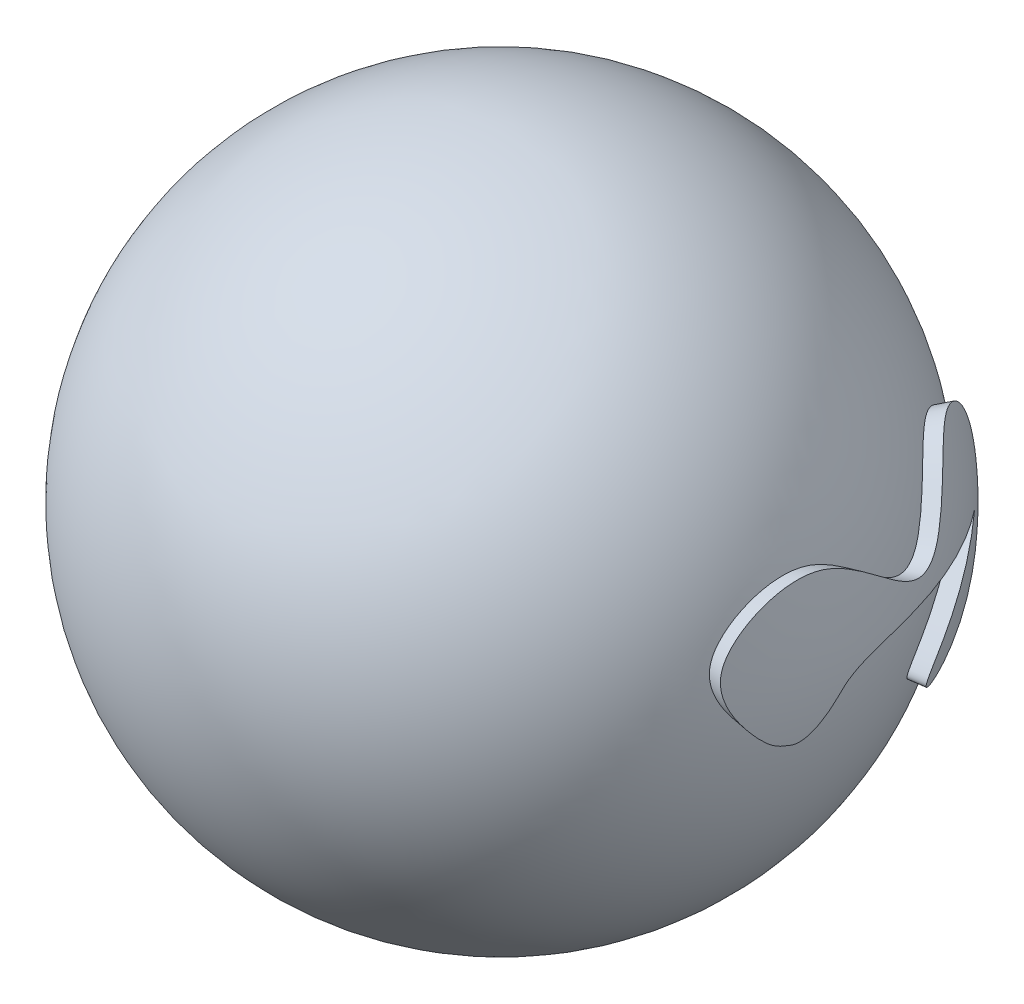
ISO-10303-21;
HEADER;
FILE_DESCRIPTION(('STEP AP214'),'2;1');
FILE_NAME('part.step','',(''),(''),'','','');
FILE_SCHEMA(('AUTOMOTIVE_DESIGN { 1 0 10303 214 1 1 1 1 }'));
ENDSEC;
DATA;
#1=APPLICATION_CONTEXT('core data for automotive mechanical design processes');
#2=APPLICATION_PROTOCOL_DEFINITION('international standard','automotive_design',2000,#1);
#3=PRODUCT_CONTEXT('',#1,'mechanical');
#4=PRODUCT('Part','Part','',(#3));
#5=PRODUCT_RELATED_PRODUCT_CATEGORY('part','',(#4));
#6=PRODUCT_DEFINITION_FORMATION('','',#4);
#7=PRODUCT_DEFINITION_CONTEXT('part definition',#1,'design');
#8=PRODUCT_DEFINITION('design','',#6,#7);
#9=PRODUCT_DEFINITION_SHAPE('','',#8);
#10=(LENGTH_UNIT() NAMED_UNIT(*) SI_UNIT(.MILLI.,.METRE.));
#11=(NAMED_UNIT(*) PLANE_ANGLE_UNIT() SI_UNIT($,.RADIAN.));
#12=(NAMED_UNIT(*) SI_UNIT($,.STERADIAN.) SOLID_ANGLE_UNIT());
#13=UNCERTAINTY_MEASURE_WITH_UNIT(LENGTH_MEASURE(1.E-05),#10,'distance_accuracy_value','');
#14=(GEOMETRIC_REPRESENTATION_CONTEXT(3) GLOBAL_UNCERTAINTY_ASSIGNED_CONTEXT((#13)) GLOBAL_UNIT_ASSIGNED_CONTEXT((#10,
#11,#12)) REPRESENTATION_CONTEXT('',''));
#15=CARTESIAN_POINT('',(0.,0.,0.));
#16=DIRECTION('',(0.,0.,1.));
#17=DIRECTION('',(1.,0.,0.));
#18=AXIS2_PLACEMENT_3D('',#15,#16,#17);
#19=CARTESIAN_POINT('',(85.4653976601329,6.1041807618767,-69.2076581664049));
#20=CARTESIAN_POINT('',(87.4313284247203,4.71720598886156,-66.9038733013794));
#21=CARTESIAN_POINT('',(89.2480159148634,3.2823703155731,-64.5474382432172));
#22=CARTESIAN_POINT('',(92.5890820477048,0.266493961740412,-59.7461794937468));
#23=CARTESIAN_POINT('',(94.1110266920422,-1.3078501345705,-57.3016498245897));
#24=CARTESIAN_POINT('',(96.8565971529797,-4.61817793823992,-52.340333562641));
#25=CARTESIAN_POINT('',(98.0798784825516,-6.3563497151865,-49.8224549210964));
#26=CARTESIAN_POINT('',(99.6534919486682,-9.18042080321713,-46.0317649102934));
#27=CARTESIAN_POINT('',(100.135179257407,-10.1609743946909,-44.7630051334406));
#28=CARTESIAN_POINT('',(100.982577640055,-12.2122144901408,-42.2780518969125));
#29=CARTESIAN_POINT('',(101.352748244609,-13.2826115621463,-41.0524226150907));
#30=CARTESIAN_POINT('',(101.783381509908,-15.04055750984,-39.3184962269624));
#31=CARTESIAN_POINT('',(101.905339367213,-15.6478598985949,-38.761500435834));
#32=CARTESIAN_POINT('',(102.077731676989,-16.9556599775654,-37.7443050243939));
#33=CARTESIAN_POINT('',(102.137659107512,-17.6525363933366,-37.2596881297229));
#34=CARTESIAN_POINT('',(102.060582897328,-18.8541620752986,-36.8733258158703));
#35=CARTESIAN_POINT('',(102.002225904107,-19.2797028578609,-36.8149048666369));
#36=CARTESIAN_POINT('',(101.769199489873,-20.0588648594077,-37.0430990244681));
#37=CARTESIAN_POINT('',(101.60707922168,-20.3525345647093,-37.3268775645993));
#38=CARTESIAN_POINT('',(101.279304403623,-20.7407673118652,-37.9977790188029));
#39=CARTESIAN_POINT('',(101.116419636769,-20.8482875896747,-38.370735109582));
#40=CARTESIAN_POINT('',(100.795498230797,-20.9910338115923,-39.1295122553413));
#41=CARTESIAN_POINT('',(100.639485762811,-21.0227635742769,-39.5120172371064));
#42=CARTESIAN_POINT('',(99.8658602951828,-21.0788914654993,-41.4305062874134));
#43=CARTESIAN_POINT('',(99.2621516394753,-20.8263918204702,-42.9799165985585));
#44=CARTESIAN_POINT('',(98.0401866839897,-20.1954572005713,-45.9806311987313));
#45=CARTESIAN_POINT('',(97.4196075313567,-19.7894161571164,-47.4521268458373));
#46=CARTESIAN_POINT('',(95.4961416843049,-18.4214351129,-51.7981522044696));
#47=CARTESIAN_POINT('',(94.1243797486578,-17.3028892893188,-54.6168447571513));
#48=CARTESIAN_POINT('',(91.2327722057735,-14.8358130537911,-59.985534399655));
#49=CARTESIAN_POINT('',(89.7095269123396,-13.4811817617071,-62.5467576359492));
#50=CARTESIAN_POINT('',(86.5363529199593,-10.4746958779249,-67.4047331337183));
#51=CARTESIAN_POINT('',(84.8838149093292,-8.83266153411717,-69.7052711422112));
#52=CARTESIAN_POINT('',(81.5728943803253,-4.90837101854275,-73.9185533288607));
#53=CARTESIAN_POINT('',(79.9410060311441,-2.65955550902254,-75.7946485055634));
#54=CARTESIAN_POINT('',(77.7757727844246,1.29536669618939,-77.9958635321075));
#55=CARTESIAN_POINT('',(77.117247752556,2.68425800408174,-78.6118400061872));
#56=CARTESIAN_POINT('',(75.9679128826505,5.63311404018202,-79.5688628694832));
#57=CARTESIAN_POINT('',(75.4740668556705,7.21802087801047,-79.9099826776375));
#58=CARTESIAN_POINT('',(74.7434503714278,10.4420463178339,-80.2401987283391));
#59=CARTESIAN_POINT('',(74.4993008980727,12.0726232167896,-80.2380845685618));
#60=CARTESIAN_POINT('',(74.2362309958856,15.3599030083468,-79.9184249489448));
#61=CARTESIAN_POINT('',(74.2224549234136,17.016130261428,-79.5946571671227));
#62=CARTESIAN_POINT('',(74.4011304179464,20.1903389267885,-78.6800182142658));
#63=CARTESIAN_POINT('',(74.5936653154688,21.7455738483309,-78.0807010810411));
#64=CARTESIAN_POINT('',(75.143845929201,24.6955339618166,-76.6621954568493));
#65=CARTESIAN_POINT('',(75.4984528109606,26.0881327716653,-75.8478521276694));
#66=CARTESIAN_POINT('',(76.355605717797,28.7188560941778,-74.0169098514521));
#67=CARTESIAN_POINT('',(76.8581486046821,29.9506083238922,-73.0013169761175));
#68=CARTESIAN_POINT('',(77.9857401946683,32.1530359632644,-70.836740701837));
#69=CARTESIAN_POINT('',(78.6137263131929,33.138084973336,-69.6798836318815));
#70=CARTESIAN_POINT('',(80.0508598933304,34.811450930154,-67.1835366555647));
#71=CARTESIAN_POINT('',(80.8413303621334,35.476621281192,-65.876630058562));
#72=CARTESIAN_POINT('',(82.6101430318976,36.2998685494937,-63.1793986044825));
#73=CARTESIAN_POINT('',(83.573489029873,36.4351035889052,-61.8207367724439));
#74=CARTESIAN_POINT('',(85.6242998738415,36.0090044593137,-59.2085265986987));
#75=CARTESIAN_POINT('',(86.6632612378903,35.4802324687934,-58.0037380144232));
#76=CARTESIAN_POINT('',(88.6823252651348,34.0539673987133,-55.763864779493));
#77=CARTESIAN_POINT('',(89.6464834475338,33.1721458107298,-54.7442921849));
#78=CARTESIAN_POINT('',(92.4232773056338,30.2306128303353,-51.8280137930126));
#79=CARTESIAN_POINT('',(94.1032863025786,27.8890726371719,-50.090353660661));
#80=CARTESIAN_POINT('',(96.3856563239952,24.2697192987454,-47.484788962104));
#81=CARTESIAN_POINT('',(97.1100329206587,23.0374730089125,-46.6150645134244));
#82=CARTESIAN_POINT('',(98.5023767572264,20.5941120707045,-44.8021196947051));
#83=CARTESIAN_POINT('',(99.1683278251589,19.3809453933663,-43.8645497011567));
#84=CARTESIAN_POINT('',(100.479401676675,17.1245214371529,-41.7701814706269));
#85=CARTESIAN_POINT('',(101.130175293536,16.0917488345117,-40.5939213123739));
#86=CARTESIAN_POINT('',(102.405589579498,14.6292206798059,-37.8572717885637));
#87=CARTESIAN_POINT('',(103.015656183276,14.2321121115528,-36.32307819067));
#88=CARTESIAN_POINT('',(104.08465071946,14.2630542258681,-33.1228778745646));
#89=CARTESIAN_POINT('',(104.52265688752,14.6722123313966,-31.5248905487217));
#90=CARTESIAN_POINT('',(105.213829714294,15.8778215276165,-28.4952134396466));
#91=CARTESIAN_POINT('',(105.473394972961,16.6706112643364,-27.0465211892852));
#92=CARTESIAN_POINT('',(106.06618873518,19.2953108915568,-22.80643111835));
#93=CARTESIAN_POINT('',(106.210505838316,21.3228310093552,-20.1702483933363));
#94=CARTESIAN_POINT('',(106.21192567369,25.3016088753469,-14.8577851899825));
#95=CARTESIAN_POINT('',(106.061449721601,27.2761603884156,-12.1956582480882));
#96=CARTESIAN_POINT('',(105.601036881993,30.7619696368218,-6.58036081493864));
#97=CARTESIAN_POINT('',(105.284425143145,32.2957363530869,-3.58066008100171));
#98=CARTESIAN_POINT('',(104.750761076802,34.0592494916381,2.70597711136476));
#99=CARTESIAN_POINT('',(104.544398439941,34.2470514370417,6.08044518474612));
#100=CARTESIAN_POINT('',(104.200592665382,33.4977422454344,12.5903790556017));
#101=CARTESIAN_POINT('',(104.051279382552,32.5732323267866,15.8213514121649));
#102=CARTESIAN_POINT('',(103.770746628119,29.8879295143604,21.8177608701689));
#103=CARTESIAN_POINT('',(103.631602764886,28.1083433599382,24.6628981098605));
#104=CARTESIAN_POINT('',(103.524852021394,24.763559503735,28.2833284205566));
#105=CARTESIAN_POINT('',(103.507094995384,23.5165968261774,29.3964017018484));
#106=CARTESIAN_POINT('',(103.570230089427,20.780360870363,31.1927084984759));
#107=CARTESIAN_POINT('',(103.657756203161,19.2606359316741,31.8749909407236));
#108=CARTESIAN_POINT('',(104.016612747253,16.0667815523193,32.4749875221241));
#109=CARTESIAN_POINT('',(104.280037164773,14.4121828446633,32.4102173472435));
#110=CARTESIAN_POINT('',(104.873573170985,11.2133900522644,31.7573126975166));
#111=CARTESIAN_POINT('',(105.194503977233,9.69774781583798,31.1920000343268));
#112=CARTESIAN_POINT('',(105.835145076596,6.76185752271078,29.7709301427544));
#113=CARTESIAN_POINT('',(106.152368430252,5.35695967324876,28.9167871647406));
#114=CARTESIAN_POINT('',(106.743139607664,2.6780721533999,27.0602805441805));
#115=CARTESIAN_POINT('',(107.018307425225,1.38964350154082,26.0537318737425));
#116=CARTESIAN_POINT('',(107.518733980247,-1.10409613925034,23.9224925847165));
#117=CARTESIAN_POINT('',(107.746562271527,-2.31328856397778,22.7854762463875));
#118=CARTESIAN_POINT('',(108.175727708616,-4.49665701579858,20.2931490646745));
#119=CARTESIAN_POINT('',(108.377995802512,-5.48917975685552,18.926883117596));
#120=CARTESIAN_POINT('',(108.692328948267,-6.42267604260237,16.6304035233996));
#121=CARTESIAN_POINT('',(108.796624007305,-6.65778114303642,15.8350448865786));
#122=CARTESIAN_POINT('',(108.935586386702,-7.05271340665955,14.6537176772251));
#123=CARTESIAN_POINT('',(108.979346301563,-7.18847166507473,14.2600336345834));
#124=CARTESIAN_POINT('',(109.070440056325,-7.3591749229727,13.4562321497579));
#125=CARTESIAN_POINT('',(109.117209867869,-7.40203306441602,13.0473155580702));
#126=CARTESIAN_POINT('',(109.356407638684,-7.41438436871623,10.9689637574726));
#127=CARTESIAN_POINT('',(109.543965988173,-6.81669629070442,9.36067704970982));
#128=CARTESIAN_POINT('',(109.839519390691,-5.29547925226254,6.42711300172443));
#129=CARTESIAN_POINT('',(109.953673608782,-4.33370074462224,5.05159976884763));
#130=CARTESIAN_POINT('',(110.104216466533,-2.26171641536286,2.44944446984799));
#131=CARTESIAN_POINT('',(110.142306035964,-1.14313113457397,1.21852187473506));
#132=CARTESIAN_POINT('',(110.142245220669,0.0281589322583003,0.0273896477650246));
#133=CARTESIAN_POINT('',(81.5863053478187,5.82551739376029,-66.0652085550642));
#134=CARTESIAN_POINT('',(83.4639684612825,4.51167437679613,-63.8638976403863));
#135=CARTESIAN_POINT('',(85.2007519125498,3.14644298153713,-61.6108128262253));
#136=CARTESIAN_POINT('',(88.3941584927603,0.284571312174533,-57.0213160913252));
#137=CARTESIAN_POINT('',(89.8493338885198,-1.21237570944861,-54.6842770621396));
#138=CARTESIAN_POINT('',(92.4733369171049,-4.36826830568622,-49.9431777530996));
#139=CARTESIAN_POINT('',(93.6417384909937,-6.02671342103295,-47.5384900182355));
#140=CARTESIAN_POINT('',(95.1439052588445,-8.72608655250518,-43.919238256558));
#141=CARTESIAN_POINT('',(95.6035559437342,-9.66415829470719,-42.7079903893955));
#142=CARTESIAN_POINT('',(96.4115386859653,-11.6278674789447,-40.3364898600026));
#143=CARTESIAN_POINT('',(96.7640759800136,-12.6531163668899,-39.1673919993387));
#144=CARTESIAN_POINT('',(97.1732640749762,-14.337714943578,-37.5145535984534));
#145=CARTESIAN_POINT('',(97.2889744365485,-14.9198085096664,-36.9837387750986));
#146=CARTESIAN_POINT('',(97.4518521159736,-16.174003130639,-36.0146890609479));
#147=CARTESIAN_POINT('',(97.5081243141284,-16.842534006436,-35.5530945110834));
#148=CARTESIAN_POINT('',(97.432493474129,-17.9970000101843,-35.1862126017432));
#149=CARTESIAN_POINT('',(97.3759832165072,-18.4061278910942,-35.1311625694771));
#150=CARTESIAN_POINT('',(97.1515946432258,-19.1565998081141,-35.3507970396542));
#151=CARTESIAN_POINT('',(96.9958068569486,-19.4402834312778,-35.6226932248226));
#152=CARTESIAN_POINT('',(96.6809974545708,-19.8168287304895,-36.2650961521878));
#153=CARTESIAN_POINT('',(96.5246235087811,-19.9220833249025,-36.6220608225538));
#154=CARTESIAN_POINT('',(96.2165484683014,-20.0633921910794,-37.3482183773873));
#155=CARTESIAN_POINT('',(96.0667961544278,-20.0960601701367,-37.7142277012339));
#156=CARTESIAN_POINT('',(95.324218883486,-20.1614536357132,-39.549850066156));
#157=CARTESIAN_POINT('',(94.7447696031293,-19.9297208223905,-41.0319342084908));
#158=CARTESIAN_POINT('',(93.5723515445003,-19.3446384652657,-43.9021819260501));
#159=CARTESIAN_POINT('',(92.9771392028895,-18.9648698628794,-45.3096960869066));
#160=CARTESIAN_POINT('',(91.1330513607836,-17.6792527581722,-49.4670039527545));
#161=CARTESIAN_POINT('',(89.8188859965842,-16.62082886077,-52.163495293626));
#162=CARTESIAN_POINT('',(87.0514349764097,-14.2768312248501,-57.297530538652));
#163=CARTESIAN_POINT('',(85.5948308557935,-12.9854888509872,-59.7459899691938));
#164=CARTESIAN_POINT('',(82.5631642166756,-10.1069613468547,-64.3882322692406));
#165=CARTESIAN_POINT('',(80.9854521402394,-8.52878675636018,-66.5857445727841));
#166=CARTESIAN_POINT('',(77.8320525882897,-4.74713340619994,-70.6017591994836));
#167=CARTESIAN_POINT('',(76.2822640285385,-2.57763892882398,-72.3844962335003));
#168=CARTESIAN_POINT('',(74.2311485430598,1.22402653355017,-74.4693766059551));
#169=CARTESIAN_POINT('',(73.6088975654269,2.55673877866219,-75.0508165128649));
#170=CARTESIAN_POINT('',(72.5190160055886,5.37687512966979,-75.9570596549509));
#171=CARTESIAN_POINT('',(72.0465661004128,6.88908815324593,-76.2837305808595));
#172=CARTESIAN_POINT('',(71.3305133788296,9.9633505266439,-76.616888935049));
#173=CARTESIAN_POINT('',(71.083382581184,11.519069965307,-76.6283366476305));
#174=CARTESIAN_POINT('',(70.8080579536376,14.6671958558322,-76.3444935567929));
#175=CARTESIAN_POINT('',(70.7835412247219,16.2572234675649,-76.0446320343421));
#176=CARTESIAN_POINT('',(70.9357499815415,19.3078015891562,-75.184734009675));
#177=CARTESIAN_POINT('',(71.112341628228,20.8041583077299,-74.6167965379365));
#178=CARTESIAN_POINT('',(71.6282932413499,23.6429440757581,-73.2655123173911));
#179=CARTESIAN_POINT('',(71.9646843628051,24.9833056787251,-72.4868733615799));
#180=CARTESIAN_POINT('',(72.7832986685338,27.5136095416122,-70.7320439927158));
#181=CARTESIAN_POINT('',(73.2655498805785,28.6973826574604,-69.7568115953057));
#182=CARTESIAN_POINT('',(74.3507862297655,30.8113159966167,-67.6758780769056));
#183=CARTESIAN_POINT('',(74.9565626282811,31.7553511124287,-66.5626275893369));
#184=CARTESIAN_POINT('',(76.3445219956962,33.355723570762,-64.158970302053));
#185=CARTESIAN_POINT('',(77.1087271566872,33.9898138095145,-62.8999155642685));
#186=CARTESIAN_POINT('',(78.818264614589,34.7701764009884,-60.3009524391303));
#187=CARTESIAN_POINT('',(79.749046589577,34.8948220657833,-58.9914460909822));
#188=CARTESIAN_POINT('',(81.7262416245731,34.4789168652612,-56.4758197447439));
#189=CARTESIAN_POINT('',(82.7257129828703,33.9697900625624,-55.3169717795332));
#190=CARTESIAN_POINT('',(84.6641205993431,32.5990792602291,-53.1673734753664));
#191=CARTESIAN_POINT('',(85.5879582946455,31.7523214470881,-52.1913600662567));
#192=CARTESIAN_POINT('',(88.2454792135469,28.9276655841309,-49.4055580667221));
#193=CARTESIAN_POINT('',(89.8487363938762,26.6797241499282,-47.7538760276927));
#194=CARTESIAN_POINT('',(92.0241234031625,23.2108481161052,-45.2799003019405));
#195=CARTESIAN_POINT('',(92.714116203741,22.0306218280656,-44.454491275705));
#196=CARTESIAN_POINT('',(94.0402602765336,19.6915265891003,-42.7331185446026));
#197=CARTESIAN_POINT('',(94.674496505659,18.5306557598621,-41.8425137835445));
#198=CARTESIAN_POINT('',(95.9227077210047,16.3729251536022,-39.8524263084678));
#199=CARTESIAN_POINT('',(96.5419903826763,15.3863716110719,-38.7345113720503));
#200=CARTESIAN_POINT('',(97.7563799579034,13.9896666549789,-36.1303601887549));
#201=CARTESIAN_POINT('',(98.3375960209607,13.609724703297,-34.669325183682));
#202=CARTESIAN_POINT('',(99.3552131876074,13.6412321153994,-31.6221214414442));
#203=CARTESIAN_POINT('',(99.7716984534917,14.0346413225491,-30.1007702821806));
#204=CARTESIAN_POINT('',(100.427778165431,15.1937863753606,-27.2177049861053));
#205=CARTESIAN_POINT('',(100.673554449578,15.9553527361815,-25.839810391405));
#206=CARTESIAN_POINT('',(101.232770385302,18.476897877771,-21.8098739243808));
#207=CARTESIAN_POINT('',(101.365308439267,20.4258454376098,-19.3083594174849));
#208=CARTESIAN_POINT('',(101.355410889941,24.2594974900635,-14.2647914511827));
#209=CARTESIAN_POINT('',(101.206083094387,26.1646427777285,-11.7367875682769));
#210=CARTESIAN_POINT('',(100.754069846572,29.5412604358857,-6.38697418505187));
#211=CARTESIAN_POINT('',(100.44420796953,31.037687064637,-3.51911296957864));
#212=CARTESIAN_POINT('',(99.9139695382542,32.7989116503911,2.52941413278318));
#213=CARTESIAN_POINT('',(99.7044512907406,33.0203031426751,5.7929191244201));
#214=CARTESIAN_POINT('',(99.3572281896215,32.3541617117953,12.0936747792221));
#215=CARTESIAN_POINT('',(99.207553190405,31.4808431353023,15.224082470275));
#216=CARTESIAN_POINT('',(98.9328714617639,28.8959472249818,21.0286710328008));
#217=CARTESIAN_POINT('',(98.8000301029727,27.1663155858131,23.7806244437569));
#218=CARTESIAN_POINT('',(98.7070968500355,23.8900829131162,27.2690537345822));
#219=CARTESIAN_POINT('',(98.6948122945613,22.6651438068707,28.3386261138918));
#220=CARTESIAN_POINT('',(98.7680794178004,19.971016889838,30.0585843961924));
#221=CARTESIAN_POINT('',(98.8602218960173,18.4706644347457,30.7084572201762));
#222=CARTESIAN_POINT('',(99.220096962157,15.3329462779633,31.2682922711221));
#223=CARTESIAN_POINT('',(99.4797388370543,13.7189503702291,31.1940417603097));
#224=CARTESIAN_POINT('',(100.060409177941,10.6196796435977,30.5393313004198));
#225=CARTESIAN_POINT('',(100.372495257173,9.16101108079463,29.9819653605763));
#226=CARTESIAN_POINT('',(100.993948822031,6.34739027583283,28.589797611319));
#227=CARTESIAN_POINT('',(101.301016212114,5.00631551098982,27.7564399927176));
#228=CARTESIAN_POINT('',(101.872162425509,2.45733977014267,25.9513018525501));
#229=CARTESIAN_POINT('',(102.137834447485,1.23642619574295,24.9753529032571));
#230=CARTESIAN_POINT('',(102.621196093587,-1.12876414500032,22.9130831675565));
#231=CARTESIAN_POINT('',(102.841308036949,-2.27673186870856,21.8148126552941));
#232=CARTESIAN_POINT('',(103.255514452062,-4.35131465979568,19.4125694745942));
#233=CARTESIAN_POINT('',(103.450472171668,-5.29494516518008,18.0982453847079));
#234=CARTESIAN_POINT('',(103.753072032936,-6.1774739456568,15.8922766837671));
#235=CARTESIAN_POINT('',(103.853402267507,-6.39868401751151,15.1288335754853));
#236=CARTESIAN_POINT('',(103.986967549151,-6.77083414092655,13.9964183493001));
#237=CARTESIAN_POINT('',(104.029011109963,-6.89879466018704,13.6192630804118));
#238=CARTESIAN_POINT('',(104.11652236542,-7.05836404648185,12.8491650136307));
#239=CARTESIAN_POINT('',(104.161444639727,-7.09753904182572,12.4574106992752));
#240=CARTESIAN_POINT('',(104.391095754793,-7.10084528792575,10.4665846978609));
#241=CARTESIAN_POINT('',(104.570716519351,-6.52572078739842,8.92767843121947));
#242=CARTESIAN_POINT('',(104.853224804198,-5.07132112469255,6.12382393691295));
#243=CARTESIAN_POINT('',(104.962165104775,-4.1545466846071,4.81013308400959));
#244=CARTESIAN_POINT('',(105.105984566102,-2.17958209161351,2.32102599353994));
#245=CARTESIAN_POINT('',(105.142407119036,-1.1133608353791,1.14137924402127));
#246=CARTESIAN_POINT('',(105.142399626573,1.40265508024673E-05,-3.11378223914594E-05));
#247=B_SPLINE_SURFACE_WITH_KNOTS('',1,3,((#19,#20,#21,#22,#23,#24,#25,#26,#27,#28,#29,#30,#31,
#32,#33,#34,#35,#36,#37,#38,#39,#40,#41,#42,#43,#44,#45,#46,#47,#48,#49,#50,#51,#52,#53,#54,#55,
#56,#57,#58,#59,#60,#61,#62,#63,#64,#65,#66,#67,#68,#69,#70,#71,#72,#73,#74,#75,#76,#77,#78,#79,
#80,#81,#82,#83,#84,#85,#86,#87,#88,#89,#90,#91,#92,#93,#94,#95,#96,#97,#98,#99,#100,#101,#102,
#103,#104,#105,#106,#107,#108,#109,#110,#111,#112,#113,#114,#115,#116,#117,#118,#119,#120,#121,
#122,#123,#124,#125,#126,#127,#128,#129,#130,#131,#132),(#133,#134,#135,#136,#137,#138,#139,
#140,#141,#142,#143,#144,#145,#146,#147,#148,#149,#150,#151,#152,#153,#154,#155,#156,#157,#158,
#159,#160,#161,#162,#163,#164,#165,#166,#167,#168,#169,#170,#171,#172,#173,#174,#175,#176,#177,
#178,#179,#180,#181,#182,#183,#184,#185,#186,#187,#188,#189,#190,#191,#192,#193,#194,#195,#196,
#197,#198,#199,#200,#201,#202,#203,#204,#205,#206,#207,#208,#209,#210,#211,#212,#213,#214,#215,
#216,#217,#218,#219,#220,#221,#222,#223,#224,#225,#226,#227,#228,#229,#230,#231,#232,#233,#234,
#235,#236,#237,#238,#239,#240,#241,#242,#243,#244,#245,#246)),.UNSPECIFIED.,.F.,.F.,.F.,(2,2),
(4,2,2,2,2,2,2,2,2,2,2,2,2,2,2,2,2,2,2,2,2,2,2,2,2,2,2,2,2,2,2,2,2,2,2,2,2,2,2,2,2,2,2,2,2,2,2,
2,2,2,2,2,2,2,2,2,4),(0.,1.),(0.,0.03125,0.0625,0.09375,0.109375,0.125,0.1328125,0.140625,
0.14453125,0.1484375,0.15234375,0.15625,0.171875,0.1875,0.21875,0.25,0.28125,0.3125,0.328125,
0.34375,0.359375,0.375,0.390625,0.40625,0.421875,0.4375,0.453125,0.46875,0.484375,0.5,0.53125,
0.546875,0.5625,0.578125,0.59375,0.609375,0.625,0.65625,0.6875,0.71875,0.75,0.78125,0.8125,
0.828125,0.84375,0.859375,0.875,0.890625,0.90625,0.921875,0.9375,0.9453125,0.94921875,0.953125,
0.96875,0.984375,1.),.UNSPECIFIED.);
#248=CARTESIAN_POINT('',(81.5863053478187,5.82551739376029,-66.0652085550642));
#249=CARTESIAN_POINT('',(85.4653976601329,6.10418076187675,-69.2076581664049));
#250=B_SPLINE_CURVE_WITH_KNOTS('',1,(#248,#249),.UNSPECIFIED.,.F.,.F.,(2,2),(0.,1.),.UNSPECIFIED.);
#251=CARTESIAN_POINT('',(81.5863053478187,5.82551739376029,-66.0652085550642));
#252=VERTEX_POINT('',#251);
#253=CARTESIAN_POINT('',(85.4653976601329,6.1041807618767,-69.207658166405));
#254=VERTEX_POINT('',#253);
#255=EDGE_CURVE('E13',#252,#254,#250,.T.);
#256=CARTESIAN_POINT('',(81.5863053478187,5.82551739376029,-66.0652085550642));
#257=CARTESIAN_POINT('',(83.4639684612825,4.51167437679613,-63.8638976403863));
#258=CARTESIAN_POINT('',(85.2007519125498,3.14644298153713,-61.6108128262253));
#259=CARTESIAN_POINT('',(88.3941584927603,0.284571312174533,-57.0213160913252));
#260=CARTESIAN_POINT('',(89.8493338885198,-1.21237570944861,-54.6842770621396));
#261=CARTESIAN_POINT('',(92.4733369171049,-4.36826830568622,-49.9431777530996));
#262=CARTESIAN_POINT('',(93.6417384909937,-6.02671342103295,-47.5384900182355));
#263=CARTESIAN_POINT('',(95.1439052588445,-8.72608655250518,-43.919238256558));
#264=CARTESIAN_POINT('',(95.6035559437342,-9.66415829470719,-42.7079903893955));
#265=CARTESIAN_POINT('',(96.4115386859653,-11.6278674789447,-40.3364898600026));
#266=CARTESIAN_POINT('',(96.7640759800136,-12.6531163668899,-39.1673919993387));
#267=CARTESIAN_POINT('',(97.1732640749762,-14.337714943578,-37.5145535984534));
#268=CARTESIAN_POINT('',(97.2889744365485,-14.9198085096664,-36.9837387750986));
#269=CARTESIAN_POINT('',(97.4518521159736,-16.174003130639,-36.0146890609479));
#270=CARTESIAN_POINT('',(97.5081243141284,-16.842534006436,-35.5530945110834));
#271=CARTESIAN_POINT('',(97.432493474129,-17.9970000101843,-35.1862126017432));
#272=CARTESIAN_POINT('',(97.3759832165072,-18.4061278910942,-35.1311625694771));
#273=CARTESIAN_POINT('',(97.1515946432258,-19.1565998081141,-35.3507970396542));
#274=CARTESIAN_POINT('',(96.9958068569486,-19.4402834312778,-35.6226932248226));
#275=CARTESIAN_POINT('',(96.6809974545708,-19.8168287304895,-36.2650961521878));
#276=CARTESIAN_POINT('',(96.5246235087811,-19.9220833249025,-36.6220608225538));
#277=CARTESIAN_POINT('',(96.2165484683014,-20.0633921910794,-37.3482183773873));
#278=CARTESIAN_POINT('',(96.0667961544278,-20.0960601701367,-37.7142277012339));
#279=CARTESIAN_POINT('',(95.324218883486,-20.1614536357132,-39.549850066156));
#280=CARTESIAN_POINT('',(94.7447696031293,-19.9297208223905,-41.0319342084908));
#281=CARTESIAN_POINT('',(93.5723515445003,-19.3446384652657,-43.9021819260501));
#282=CARTESIAN_POINT('',(92.9771392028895,-18.9648698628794,-45.3096960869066));
#283=CARTESIAN_POINT('',(91.1330513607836,-17.6792527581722,-49.4670039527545));
#284=CARTESIAN_POINT('',(89.8188859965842,-16.62082886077,-52.163495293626));
#285=CARTESIAN_POINT('',(87.0514349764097,-14.2768312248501,-57.297530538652));
#286=CARTESIAN_POINT('',(85.5948308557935,-12.9854888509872,-59.7459899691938));
#287=CARTESIAN_POINT('',(82.5631642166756,-10.1069613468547,-64.3882322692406));
#288=CARTESIAN_POINT('',(80.9854521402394,-8.52878675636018,-66.5857445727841));
#289=CARTESIAN_POINT('',(77.8320525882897,-4.74713340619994,-70.6017591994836));
#290=CARTESIAN_POINT('',(76.2822640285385,-2.57763892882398,-72.3844962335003));
#291=CARTESIAN_POINT('',(74.2311485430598,1.22402653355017,-74.4693766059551));
#292=CARTESIAN_POINT('',(73.6088975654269,2.55673877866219,-75.0508165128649));
#293=CARTESIAN_POINT('',(72.5190160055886,5.37687512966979,-75.9570596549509));
#294=CARTESIAN_POINT('',(72.0465661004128,6.88908815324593,-76.2837305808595));
#295=CARTESIAN_POINT('',(71.3305133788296,9.9633505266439,-76.616888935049));
#296=CARTESIAN_POINT('',(71.083382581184,11.519069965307,-76.6283366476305));
#297=CARTESIAN_POINT('',(70.8080579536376,14.6671958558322,-76.3444935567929));
#298=CARTESIAN_POINT('',(70.7835412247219,16.2572234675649,-76.0446320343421));
#299=CARTESIAN_POINT('',(70.9357499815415,19.3078015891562,-75.184734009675));
#300=CARTESIAN_POINT('',(71.112341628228,20.8041583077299,-74.6167965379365));
#301=CARTESIAN_POINT('',(71.6282932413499,23.6429440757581,-73.2655123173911));
#302=CARTESIAN_POINT('',(71.9646843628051,24.9833056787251,-72.4868733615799));
#303=CARTESIAN_POINT('',(72.7832986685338,27.5136095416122,-70.7320439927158));
#304=CARTESIAN_POINT('',(73.2655498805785,28.6973826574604,-69.7568115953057));
#305=CARTESIAN_POINT('',(74.3507862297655,30.8113159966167,-67.6758780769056));
#306=CARTESIAN_POINT('',(74.9565626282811,31.7553511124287,-66.5626275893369));
#307=CARTESIAN_POINT('',(76.3445219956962,33.355723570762,-64.158970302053));
#308=CARTESIAN_POINT('',(77.1087271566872,33.9898138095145,-62.8999155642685));
#309=CARTESIAN_POINT('',(78.818264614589,34.7701764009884,-60.3009524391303));
#310=CARTESIAN_POINT('',(79.749046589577,34.8948220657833,-58.9914460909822));
#311=CARTESIAN_POINT('',(81.7262416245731,34.4789168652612,-56.4758197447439));
#312=CARTESIAN_POINT('',(82.7257129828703,33.9697900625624,-55.3169717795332));
#313=CARTESIAN_POINT('',(84.6641205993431,32.5990792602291,-53.1673734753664));
#314=CARTESIAN_POINT('',(85.5879582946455,31.7523214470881,-52.1913600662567));
#315=CARTESIAN_POINT('',(88.2454792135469,28.9276655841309,-49.4055580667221));
#316=CARTESIAN_POINT('',(89.8487363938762,26.6797241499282,-47.7538760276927));
#317=CARTESIAN_POINT('',(92.0241234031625,23.2108481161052,-45.2799003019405));
#318=CARTESIAN_POINT('',(92.714116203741,22.0306218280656,-44.454491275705));
#319=CARTESIAN_POINT('',(94.0402602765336,19.6915265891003,-42.7331185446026));
#320=CARTESIAN_POINT('',(94.674496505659,18.5306557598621,-41.8425137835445));
#321=CARTESIAN_POINT('',(95.9227077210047,16.3729251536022,-39.8524263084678));
#322=CARTESIAN_POINT('',(96.5419903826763,15.3863716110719,-38.7345113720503));
#323=CARTESIAN_POINT('',(97.7563799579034,13.9896666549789,-36.1303601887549));
#324=CARTESIAN_POINT('',(98.3375960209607,13.609724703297,-34.669325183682));
#325=CARTESIAN_POINT('',(99.3552131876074,13.6412321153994,-31.6221214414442));
#326=CARTESIAN_POINT('',(99.7716984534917,14.0346413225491,-30.1007702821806));
#327=CARTESIAN_POINT('',(100.427778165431,15.1937863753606,-27.2177049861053));
#328=CARTESIAN_POINT('',(100.673554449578,15.9553527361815,-25.839810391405));
#329=CARTESIAN_POINT('',(101.232770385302,18.476897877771,-21.8098739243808));
#330=CARTESIAN_POINT('',(101.365308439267,20.4258454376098,-19.3083594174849));
#331=CARTESIAN_POINT('',(101.355410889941,24.2594974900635,-14.2647914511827));
#332=CARTESIAN_POINT('',(101.206083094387,26.1646427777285,-11.7367875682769));
#333=CARTESIAN_POINT('',(100.754069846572,29.5412604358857,-6.38697418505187));
#334=CARTESIAN_POINT('',(100.44420796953,31.037687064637,-3.51911296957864));
#335=CARTESIAN_POINT('',(99.9139695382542,32.7989116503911,2.52941413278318));
#336=CARTESIAN_POINT('',(99.7044512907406,33.0203031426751,5.7929191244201));
#337=CARTESIAN_POINT('',(99.3572281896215,32.3541617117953,12.0936747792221));
#338=CARTESIAN_POINT('',(99.207553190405,31.4808431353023,15.224082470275));
#339=CARTESIAN_POINT('',(98.9328714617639,28.8959472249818,21.0286710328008));
#340=CARTESIAN_POINT('',(98.8000301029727,27.1663155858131,23.7806244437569));
#341=CARTESIAN_POINT('',(98.7070968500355,23.8900829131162,27.2690537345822));
#342=CARTESIAN_POINT('',(98.6948122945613,22.6651438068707,28.3386261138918));
#343=CARTESIAN_POINT('',(98.7680794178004,19.971016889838,30.0585843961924));
#344=CARTESIAN_POINT('',(98.8602218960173,18.4706644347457,30.7084572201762));
#345=CARTESIAN_POINT('',(99.220096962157,15.3329462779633,31.2682922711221));
#346=CARTESIAN_POINT('',(99.4797388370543,13.7189503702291,31.1940417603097));
#347=CARTESIAN_POINT('',(100.060409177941,10.6196796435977,30.5393313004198));
#348=CARTESIAN_POINT('',(100.372495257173,9.16101108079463,29.9819653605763));
#349=CARTESIAN_POINT('',(100.993948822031,6.34739027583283,28.589797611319));
#350=CARTESIAN_POINT('',(101.301016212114,5.00631551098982,27.7564399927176));
#351=CARTESIAN_POINT('',(101.872162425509,2.45733977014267,25.9513018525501));
#352=CARTESIAN_POINT('',(102.137834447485,1.23642619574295,24.9753529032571));
#353=CARTESIAN_POINT('',(102.621196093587,-1.12876414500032,22.9130831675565));
#354=CARTESIAN_POINT('',(102.841308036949,-2.27673186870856,21.8148126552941));
#355=CARTESIAN_POINT('',(103.255514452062,-4.35131465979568,19.4125694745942));
#356=CARTESIAN_POINT('',(103.450472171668,-5.29494516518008,18.0982453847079));
#357=CARTESIAN_POINT('',(103.753072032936,-6.1774739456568,15.8922766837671));
#358=CARTESIAN_POINT('',(103.853402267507,-6.39868401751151,15.1288335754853));
#359=CARTESIAN_POINT('',(103.986967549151,-6.77083414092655,13.9964183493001));
#360=CARTESIAN_POINT('',(104.029011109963,-6.89879466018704,13.6192630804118));
#361=CARTESIAN_POINT('',(104.11652236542,-7.05836404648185,12.8491650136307));
#362=CARTESIAN_POINT('',(104.161444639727,-7.09753904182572,12.4574106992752));
#363=CARTESIAN_POINT('',(104.391095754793,-7.10084528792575,10.4665846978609));
#364=CARTESIAN_POINT('',(104.570716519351,-6.52572078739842,8.92767843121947));
#365=CARTESIAN_POINT('',(104.853224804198,-5.07132112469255,6.12382393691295));
#366=CARTESIAN_POINT('',(104.962165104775,-4.1545466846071,4.81013308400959));
#367=CARTESIAN_POINT('',(105.105984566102,-2.17958209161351,2.32102599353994));
#368=CARTESIAN_POINT('',(105.142407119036,-1.1133608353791,1.14137924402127));
#369=CARTESIAN_POINT('',(105.142399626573,1.40265508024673E-05,-3.11378223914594E-05));
#370=B_SPLINE_CURVE_WITH_KNOTS('',3,(#256,#257,#258,#259,#260,#261,#262,#263,#264,#265,#266,
#267,#268,#269,#270,#271,#272,#273,#274,#275,#276,#277,#278,#279,#280,#281,#282,#283,#284,#285,
#286,#287,#288,#289,#290,#291,#292,#293,#294,#295,#296,#297,#298,#299,#300,#301,#302,#303,#304,
#305,#306,#307,#308,#309,#310,#311,#312,#313,#314,#315,#316,#317,#318,#319,#320,#321,#322,#323,
#324,#325,#326,#327,#328,#329,#330,#331,#332,#333,#334,#335,#336,#337,#338,#339,#340,#341,#342,
#343,#344,#345,#346,#347,#348,#349,#350,#351,#352,#353,#354,#355,#356,#357,#358,#359,#360,#361,
#362,#363,#364,#365,#366,#367,#368,#369),.UNSPECIFIED.,.F.,.F.,(4,2,2,2,2,2,2,2,2,2,2,2,2,2,2,2,
2,2,2,2,2,2,2,2,2,2,2,2,2,2,2,2,2,2,2,2,2,2,2,2,2,2,2,2,2,2,2,2,2,2,2,2,2,2,2,2,4),(0.,0.03125,
0.0625,0.09375,0.109375,0.125,0.1328125,0.140625,0.14453125,0.1484375,0.15234375,0.15625,
0.171875,0.1875,0.21875,0.25,0.28125,0.3125,0.328125,0.34375,0.359375,0.375,0.390625,0.40625,
0.421875,0.4375,0.453125,0.46875,0.484375,0.5,0.53125,0.546875,0.5625,0.578125,0.59375,0.609375,
0.625,0.65625,0.6875,0.71875,0.75,0.78125,0.8125,0.828125,0.84375,0.859375,0.875,0.890625,
0.90625,0.921875,0.9375,0.9453125,0.94921875,0.953125,0.96875,0.984375,1.),.UNSPECIFIED.);
#371=CARTESIAN_POINT('',(105.142399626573,1.40265508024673E-05,-3.11378223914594E-05));
#372=VERTEX_POINT('',#371);
#373=EDGE_CURVE('E130',#252,#372,#370,.T.);
#374=CARTESIAN_POINT('',(105.142399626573,1.40265508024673E-05,-3.11378223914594E-05));
#375=CARTESIAN_POINT('',(110.142245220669,0.0281589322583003,0.0273896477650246));
#376=B_SPLINE_CURVE_WITH_KNOTS('',1,(#374,#375),.UNSPECIFIED.,.F.,.F.,(2,2),(0.,1.),.UNSPECIFIED.);
#377=CARTESIAN_POINT('',(110.142245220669,0.0281589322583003,0.0273896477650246));
#378=VERTEX_POINT('',#377);
#379=EDGE_CURVE('E113',#372,#378,#376,.T.);
#380=CARTESIAN_POINT('',(85.4653975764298,6.1041807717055,-69.2076582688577));
#381=CARTESIAN_POINT('',(85.6082987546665,6.00336266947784,-69.0401987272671));
#382=CARTESIAN_POINT('',(85.7505017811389,5.90222202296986,-68.8723375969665));
#383=CARTESIAN_POINT('',(86.0333055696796,5.6994252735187,-68.536070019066));
#384=CARTESIAN_POINT('',(86.1739083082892,5.59777009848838,-68.3676646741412));
#385=CARTESIAN_POINT('',(86.4535238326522,5.39392437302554,-68.0303170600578));
#386=CARTESIAN_POINT('',(86.5925384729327,5.29173470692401,-67.8613757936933));
#387=CARTESIAN_POINT('',(86.8689889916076,5.08679814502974,-67.5229633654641));
#388=CARTESIAN_POINT('',(87.0064265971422,4.98405208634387,-67.3534931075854));
#389=CARTESIAN_POINT('',(87.2797326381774,4.77797948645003,-67.0140290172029));
#390=CARTESIAN_POINT('',(87.4156026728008,4.67465373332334,-66.8440359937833));
#391=CARTESIAN_POINT('',(87.6857814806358,4.46739837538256,-66.5035317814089));
#392=CARTESIAN_POINT('',(87.8200917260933,4.36346950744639,-66.3330213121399));
#393=CARTESIAN_POINT('',(88.0871569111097,4.15498465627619,-65.9914871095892));
#394=CARTESIAN_POINT('',(88.2199131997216,4.05042935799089,-65.8204640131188));
#395=CARTESIAN_POINT('',(88.4838743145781,3.84066918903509,-65.4779092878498));
#396=CARTESIAN_POINT('',(88.6150803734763,3.73546495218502,-65.3063782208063));
#397=CARTESIAN_POINT('',(88.8759428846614,3.52438568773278,-64.9628122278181));
#398=CARTESIAN_POINT('',(89.0056004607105,3.41851124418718,-64.7907777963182));
#399=CARTESIAN_POINT('',(89.2633661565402,3.20607213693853,-64.4462096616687));
#400=CARTESIAN_POINT('',(89.3914752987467,3.09950800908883,-64.2736763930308));
#401=CARTESIAN_POINT('',(89.6461424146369,2.8856717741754,-63.9281157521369));
#402=CARTESIAN_POINT('',(89.7727013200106,2.77840015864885,-63.7550887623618));
#403=CARTESIAN_POINT('',(90.0242651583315,2.56313349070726,-63.4085458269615));
#404=CARTESIAN_POINT('',(90.1492709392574,2.45513888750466,-63.2350302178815));
#405=CARTESIAN_POINT('',(90.397724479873,2.23841266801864,-62.8875158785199));
#406=CARTESIAN_POINT('',(90.5211730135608,2.1296814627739,-62.7135174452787));
#407=CARTESIAN_POINT('',(90.7665072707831,1.91147071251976,-62.3650437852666));
#408=CARTESIAN_POINT('',(90.8883937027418,1.80199154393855,-62.1905688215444));
#409=CARTESIAN_POINT('',(91.13059872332,1.58227553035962,-61.8411485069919));
#410=CARTESIAN_POINT('',(91.2509179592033,1.47203902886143,-61.6662033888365));
#411=CARTESIAN_POINT('',(91.4899833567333,1.25080022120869,-61.3158501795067));
#412=CARTESIAN_POINT('',(91.6087301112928,1.1397982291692,-61.1404422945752));
#413=CARTESIAN_POINT('',(91.844640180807,0.917028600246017,-60.7891773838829));
#414=CARTESIAN_POINT('',(91.9618041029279,0.805261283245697,-60.6133205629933));
#415=CARTESIAN_POINT('',(92.1945550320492,0.581050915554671,-60.2611572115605));
#416=CARTESIAN_POINT('',(92.3101427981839,0.468608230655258,-60.0848509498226));
#417=CARTESIAN_POINT('',(92.5397402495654,0.243012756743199,-59.7318054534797));
#418=CARTESIAN_POINT('',(92.6537505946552,0.129860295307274,-59.5550664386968));
#419=CARTESIAN_POINT('',(92.8801978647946,-0.0971711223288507,-59.2011597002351));
#420=CARTESIAN_POINT('',(92.9926353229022,-0.211049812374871,-59.023992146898));
#421=CARTESIAN_POINT('',(93.2159389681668,-0.439555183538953,-58.6692345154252));
#422=CARTESIAN_POINT('',(93.3268055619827,-0.554181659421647,-58.4916445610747));
#423=CARTESIAN_POINT('',(93.5469688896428,-0.784201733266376,-58.1360471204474));
#424=CARTESIAN_POINT('',(93.6562659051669,-0.899595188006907,-57.9580397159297));
#425=CARTESIAN_POINT('',(93.8732900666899,-1.13116872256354,-57.6016124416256));
#426=CARTESIAN_POINT('',(93.9810173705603,-1.24734872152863,-57.4231926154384));
#427=CARTESIAN_POINT('',(94.1949011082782,-1.48051363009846,-57.06594509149));
#428=CARTESIAN_POINT('',(94.3010575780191,-1.59749852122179,-56.8871174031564));
#429=CARTESIAN_POINT('',(94.5117974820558,-1.83229108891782,-56.5290587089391));
#430=CARTESIAN_POINT('',(94.6163808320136,-1.95009880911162,-56.3498276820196));
#431=CARTESIAN_POINT('',(94.823971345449,-2.18655385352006,-55.9909667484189));
#432=CARTESIAN_POINT('',(94.9269783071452,-2.30520128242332,-55.8113367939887));
#433=CARTESIAN_POINT('',(95.1314117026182,-2.54335263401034,-55.4516828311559));
#434=CARTESIAN_POINT('',(95.2328378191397,-2.6628567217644,-55.2716587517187));
#435=CARTESIAN_POINT('',(95.4341055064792,-2.90273416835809,-54.9112196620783));
#436=CARTESIAN_POINT('',(95.5339466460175,-3.02310775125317,-54.7308045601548));
#437=CARTESIAN_POINT('',(95.7320366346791,-3.26474886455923,-54.3695909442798));
#438=CARTESIAN_POINT('',(95.8302849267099,-3.38601668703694,-54.1887923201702));
#439=CARTESIAN_POINT('',(96.0251708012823,-3.62950050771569,-53.8268344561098));
#440=CARTESIAN_POINT('',(96.1218076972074,-3.75171687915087,-53.645675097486));
#441=CARTESIAN_POINT('',(96.3134534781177,-3.99714591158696,-53.2830161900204));
#442=CARTESIAN_POINT('',(96.4084615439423,-4.1203590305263,-53.1015165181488));
#443=CARTESIAN_POINT('',(96.5968314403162,-4.36783016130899,-52.7381983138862));
#444=CARTESIAN_POINT('',(96.6901923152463,-4.49208872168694,-52.5563796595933));
#445=CARTESIAN_POINT('',(96.8752493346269,-4.74169868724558,-52.1924448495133));
#446=CARTESIAN_POINT('',(96.966944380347,-4.86705073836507,-52.0103285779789));
#447=CARTESIAN_POINT('',(97.1486510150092,-5.11889489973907,-51.6458200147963));
#448=CARTESIAN_POINT('',(97.238661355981,-5.24538775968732,-51.4634276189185));
#449=CARTESIAN_POINT('',(97.4169796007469,-5.4995605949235,-51.0983885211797));
#450=CARTESIAN_POINT('',(97.5052860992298,-5.62724143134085,-50.9157417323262));
#451=CARTESIAN_POINT('',(97.6801775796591,-5.88383684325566,-50.5502156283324));
#452=CARTESIAN_POINT('',(97.7667609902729,-6.01275239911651,-50.36733624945));
#453=CARTESIAN_POINT('',(97.9381871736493,-6.27186371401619,-50.0013667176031));
#454=CARTESIAN_POINT('',(98.0230281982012,-6.40206058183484,-49.8182765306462));
#455=CARTESIAN_POINT('',(98.1909504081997,-6.66378093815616,-49.4519071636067));
#456=CARTESIAN_POINT('',(98.2740296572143,-6.79530567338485,-49.2686279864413));
#457=CARTESIAN_POINT('',(98.4384090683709,-7.05972848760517,-48.9019022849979));
#458=CARTESIAN_POINT('',(98.5197070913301,-7.19262796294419,-48.7184558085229));
#459=CARTESIAN_POINT('',(98.6805048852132,-7.45984661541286,-48.3514167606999));
#460=CARTESIAN_POINT('',(98.760002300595,-7.59416734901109,-48.1678242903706));
#461=CARTESIAN_POINT('',(98.9171792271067,-7.86427633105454,-47.8005148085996));
#462=CARTESIAN_POINT('',(98.9948561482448,-8.00006631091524,-47.6167979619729));
#463=CARTESIAN_POINT('',(99.1483860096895,-8.273180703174,-47.249229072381));
#464=CARTESIAN_POINT('',(99.2242357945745,-8.41050724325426,-47.065377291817));
#465=CARTESIAN_POINT('',(99.3740594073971,-8.68684205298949,-46.6976045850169));
#466=CARTESIAN_POINT('',(99.448029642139,-8.82585288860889,-46.5136841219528));
#467=CARTESIAN_POINT('',(99.5939952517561,-9.10559386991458,-46.1459606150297));
#468=CARTESIAN_POINT('',(99.6659879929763,-9.24632597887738,-45.9621580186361));
#469=CARTESIAN_POINT('',(99.8079003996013,-9.52954648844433,-45.5948636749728));
#470=CARTESIAN_POINT('',(99.8778184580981,-9.67203613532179,-45.4113722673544));
#471=CARTESIAN_POINT('',(100.015486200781,-9.95881038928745,-45.0448952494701));
#472=CARTESIAN_POINT('',(100.083235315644,-10.1030954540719,-44.8619097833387));
#473=CARTESIAN_POINT('',(100.216476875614,-10.3934904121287,-44.4966341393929));
#474=CARTESIAN_POINT('',(100.28196979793,-10.5395999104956,-44.3143438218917));
#475=CARTESIAN_POINT('',(100.41059957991,-10.8337078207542,-43.9506716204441));
#476=CARTESIAN_POINT('',(100.473737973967,-10.9817049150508,-43.769289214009));
#477=CARTESIAN_POINT('',(100.597649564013,-11.2796073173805,-43.4074599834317));
#478=CARTESIAN_POINT('',(100.658424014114,-11.4295115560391,-43.2270127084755));
#479=CARTESIAN_POINT('',(100.777566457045,-11.7314759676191,-42.8670883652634));
#480=CARTESIAN_POINT('',(100.835934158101,-11.8835363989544,-42.6876114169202));
#481=CARTESIAN_POINT('',(100.950059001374,-12.1902217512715,-42.3299856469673));
#482=CARTESIAN_POINT('',(101.005815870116,-12.344846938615,-42.1518369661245));
#483=CARTESIAN_POINT('',(101.114544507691,-12.6569978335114,-41.7971795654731));
#484=CARTESIAN_POINT('',(101.1675158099,-12.8145240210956,-41.6206711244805));
#485=CARTESIAN_POINT('',(101.270490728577,-13.1328315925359,-41.2696203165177));
#486=CARTESIAN_POINT('',(101.320493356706,-13.2936140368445,-41.0950786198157));
#487=CARTESIAN_POINT('',(101.417353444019,-13.6187775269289,-40.7482787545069));
#488=CARTESIAN_POINT('',(101.464208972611,-13.783160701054,-40.5760220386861));
#489=CARTESIAN_POINT('',(101.55458425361,-14.1158823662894,-40.2341371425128));
#490=CARTESIAN_POINT('',(101.598100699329,-14.2842245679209,-40.064511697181));
#491=CARTESIAN_POINT('',(101.68155280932,-14.6248420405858,-39.7285149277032));
#492=CARTESIAN_POINT('',(101.72149023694,-14.7971153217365,-39.562142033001));
#493=CARTESIAN_POINT('',(101.797000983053,-15.1465589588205,-39.2343001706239));
#494=CARTESIAN_POINT('',(101.832582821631,-15.3237188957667,-39.0728221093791));
#495=CARTESIAN_POINT('',(101.898733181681,-15.6841286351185,-38.7560191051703));
#496=CARTESIAN_POINT('',(101.929306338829,-15.867372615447,-38.6006885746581));
#497=CARTESIAN_POINT('',(101.970728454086,-16.1478227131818,-38.3736936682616));
#498=CARTESIAN_POINT('',(101.983799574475,-16.2422668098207,-38.2990067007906));
#499=CARTESIAN_POINT('',(102.008659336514,-16.4329581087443,-38.1511447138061));
#500=CARTESIAN_POINT('',(102.020444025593,-16.529209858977,-38.0779748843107));
#501=CARTESIAN_POINT('',(102.042346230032,-16.723921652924,-37.9339860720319));
#502=CARTESIAN_POINT('',(102.052460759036,-16.8223853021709,-37.8631714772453));
#503=CARTESIAN_POINT('',(102.070457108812,-17.0219723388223,-37.7252033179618));
#504=CARTESIAN_POINT('',(102.078340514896,-17.1230937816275,-37.658047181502));
#505=CARTESIAN_POINT('',(102.08810475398,-17.2771046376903,-37.5609542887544));
#506=CARTESIAN_POINT('',(102.091014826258,-17.3287961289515,-37.5292158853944));
#507=CARTESIAN_POINT('',(102.09608079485,-17.432979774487,-37.4671255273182));
#508=CARTESIAN_POINT('',(102.098237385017,-17.4854711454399,-37.4367723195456));
#509=CARTESIAN_POINT('',(102.101731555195,-17.5913005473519,-37.3776087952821));
#510=CARTESIAN_POINT('',(102.103069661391,-17.6446380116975,-37.3487974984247));
#511=CARTESIAN_POINT('',(102.104862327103,-17.7522068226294,-37.2928731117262));
#512=CARTESIAN_POINT('',(102.105316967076,-17.8064380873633,-37.2657598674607));
#513=CARTESIAN_POINT('',(102.105277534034,-17.9158412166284,-37.2133888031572));
#514=CARTESIAN_POINT('',(102.104782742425,-17.9710137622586,-37.1881324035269));
#515=CARTESIAN_POINT('',(102.102783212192,-18.0823446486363,-37.1396219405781));
#516=CARTESIAN_POINT('',(102.101276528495,-18.1385046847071,-37.1163718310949));
#517=CARTESIAN_POINT('',(102.097178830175,-18.2518605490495,-37.0720538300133));
#518=CARTESIAN_POINT('',(102.094584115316,-18.3090592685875,-37.0509936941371));
#519=CARTESIAN_POINT('',(102.088287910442,-18.4244880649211,-37.0111194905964));
#520=CARTESIAN_POINT('',(102.08458131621,-18.4827217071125,-36.992316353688));
#521=CARTESIAN_POINT('',(102.0779196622,-18.5707512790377,-36.9665863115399));
#522=CARTESIAN_POINT('',(102.075513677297,-18.6002258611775,-36.9584178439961));
#523=CARTESIAN_POINT('',(102.070317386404,-18.6593465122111,-36.9429804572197));
#524=CARTESIAN_POINT('',(102.067527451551,-18.6889923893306,-36.9357106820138));
#525=CARTESIAN_POINT('',(102.061542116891,-18.748409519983,-36.922152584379));
#526=CARTESIAN_POINT('',(102.058347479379,-18.7781804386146,-36.9158624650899));
#527=CARTESIAN_POINT('',(102.051532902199,-18.8378008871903,-36.9043426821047));
#528=CARTESIAN_POINT('',(102.047914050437,-18.86765003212,-36.8991103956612));
#529=CARTESIAN_POINT('',(102.040231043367,-18.9273802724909,-36.889785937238));
#530=CARTESIAN_POINT('',(102.036168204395,-18.9572610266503,-36.8856905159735));
#531=CARTESIAN_POINT('',(102.027577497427,-19.0170077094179,-36.8787189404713));
#532=CARTESIAN_POINT('',(102.023051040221,-19.0468734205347,-36.875839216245));
#533=CARTESIAN_POINT('',(102.013513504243,-19.1065431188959,-36.8713779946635));
#534=CARTESIAN_POINT('',(102.00850375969,-19.1363470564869,-36.8697930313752));
#535=CARTESIAN_POINT('',(101.997980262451,-19.1958461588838,-36.8679998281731));
#536=CARTESIAN_POINT('',(101.992467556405,-19.2255414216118,-36.8677887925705));
#537=CARTESIAN_POINT('',(101.980918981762,-19.2847764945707,-36.8688210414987));
#538=CARTESIAN_POINT('',(101.974883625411,-19.3143164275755,-36.8700629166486));
#539=CARTESIAN_POINT('',(101.962270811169,-19.3731932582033,-36.8740782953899));
#540=CARTESIAN_POINT('',(101.955693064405,-19.402530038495,-36.8768526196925));
#541=CARTESIAN_POINT('',(101.941976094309,-19.4609567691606,-36.8840091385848));
#542=CARTESIAN_POINT('',(101.934835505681,-19.4900459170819,-36.8883953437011));
#543=CARTESIAN_POINT('',(101.923705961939,-19.5333960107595,-36.8962252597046));
#544=CARTESIAN_POINT('',(101.919919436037,-19.5478234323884,-36.8990496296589));
#545=CARTESIAN_POINT('',(101.91219898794,-19.5765988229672,-36.9051287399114));
#546=CARTESIAN_POINT('',(101.908264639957,-19.5909463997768,-36.9083848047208));
#547=CARTESIAN_POINT('',(101.900246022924,-19.6195553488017,-36.9153376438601));
#548=CARTESIAN_POINT('',(101.896161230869,-19.6338161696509,-36.919036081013));
#549=CARTESIAN_POINT('',(101.887845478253,-19.6622293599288,-36.926874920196));
#550=CARTESIAN_POINT('',(101.883614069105,-19.676381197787,-36.9310167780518));
#551=CARTESIAN_POINT('',(101.875025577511,-19.7044472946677,-36.9397541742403));
#552=CARTESIAN_POINT('',(101.870668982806,-19.7183622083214,-36.9443480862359));
#553=CARTESIAN_POINT('',(101.861841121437,-19.7459372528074,-36.9539687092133));
#554=CARTESIAN_POINT('',(101.857370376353,-19.7595981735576,-36.9589936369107));
#555=CARTESIAN_POINT('',(101.848318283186,-19.7866645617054,-36.9694656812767));
#556=CARTESIAN_POINT('',(101.843737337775,-19.8000707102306,-36.974911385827));
#557=CARTESIAN_POINT('',(101.834469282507,-19.8266273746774,-36.9862130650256));
#558=CARTESIAN_POINT('',(101.829782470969,-19.8397784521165,-36.9920679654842));
#559=CARTESIAN_POINT('',(101.820307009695,-19.8658247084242,-37.0041764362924));
#560=CARTESIAN_POINT('',(101.815518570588,-19.8787203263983,-37.0104292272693));
#561=CARTESIAN_POINT('',(101.805844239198,-19.9042554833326,-37.0233216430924));
#562=CARTESIAN_POINT('',(101.800958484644,-19.9168953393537,-37.029960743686));
#563=CARTESIAN_POINT('',(101.7910937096,-19.9419187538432,-37.0436144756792));
#564=CARTESIAN_POINT('',(101.786114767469,-19.9543025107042,-37.050628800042));
#565=CARTESIAN_POINT('',(101.776068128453,-19.9788131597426,-37.0650209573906));
#566=CARTESIAN_POINT('',(101.771000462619,-19.9909401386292,-37.0723986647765));
#567=CARTESIAN_POINT('',(101.755668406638,-20.0269404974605,-37.0950633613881));
#568=CARTESIAN_POINT('',(101.74527653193,-20.0504293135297,-37.1108797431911));
#569=CARTESIAN_POINT('',(101.724189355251,-20.0963747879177,-37.1438276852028));
#570=CARTESIAN_POINT('',(101.713493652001,-20.1188299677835,-37.1609610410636));
#571=CARTESIAN_POINT('',(101.691831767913,-20.1627090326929,-37.1964520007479));
#572=CARTESIAN_POINT('',(101.680865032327,-20.1841304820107,-37.214812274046));
#573=CARTESIAN_POINT('',(101.658694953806,-20.2259397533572,-37.2526652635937));
#574=CARTESIAN_POINT('',(101.647491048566,-20.2463246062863,-37.2721609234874));
#575=CARTESIAN_POINT('',(101.624880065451,-20.2860585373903,-37.3121940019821));
#576=CARTESIAN_POINT('',(101.613472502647,-20.3054045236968,-37.3327342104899));
#577=CARTESIAN_POINT('',(101.590487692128,-20.3430581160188,-37.3747659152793));
#578=CARTESIAN_POINT('',(101.578910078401,-20.3613628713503,-37.3962597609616));
#579=CARTESIAN_POINT('',(101.555618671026,-20.396931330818,-37.4401084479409));
#580=CARTESIAN_POINT('',(101.543904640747,-20.4141927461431,-37.4624650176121));
#581=CARTESIAN_POINT('',(101.52037397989,-20.4476697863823,-37.5079500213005));
#582=CARTESIAN_POINT('',(101.508557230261,-20.4638839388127,-37.5310794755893));
#583=CARTESIAN_POINT('',(101.484854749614,-20.4952684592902,-37.5780177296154));
#584=CARTESIAN_POINT('',(101.472968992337,-20.5104383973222,-37.6018268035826));
#585=CARTESIAN_POINT('',(101.44916542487,-20.5397072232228,-37.650038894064));
#586=CARTESIAN_POINT('',(101.437247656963,-20.5538071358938,-37.6744413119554));
#587=CARTESIAN_POINT('',(101.413420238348,-20.5811268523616,-37.723630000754));
#588=CARTESIAN_POINT('',(101.401510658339,-20.5943490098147,-37.7484150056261));
#589=CARTESIAN_POINT('',(101.377703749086,-20.6199289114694,-37.7983493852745));
#590=CARTESIAN_POINT('',(101.365806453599,-20.6322885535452,-37.8234978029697));
#591=CARTESIAN_POINT('',(101.342025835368,-20.6561878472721,-37.8741305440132));
#592=CARTESIAN_POINT('',(101.330142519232,-20.6677287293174,-37.8996142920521));
#593=CARTESIAN_POINT('',(101.294525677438,-20.7011679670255,-37.9765117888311));
#594=CARTESIAN_POINT('',(101.270796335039,-20.7219138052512,-38.0284325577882));
#595=CARTESIAN_POINT('',(101.223409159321,-20.7605881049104,-38.1333252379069));
#596=CARTESIAN_POINT('',(101.199751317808,-20.7785169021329,-38.1862970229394));
#597=CARTESIAN_POINT('',(101.152512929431,-20.8118749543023,-38.2931039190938));
#598=CARTESIAN_POINT('',(101.128932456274,-20.8273022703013,-38.3469396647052));
#599=CARTESIAN_POINT('',(101.081857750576,-20.855965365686,-38.4552838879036));
#600=CARTESIAN_POINT('',(101.058363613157,-20.869199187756,-38.5097929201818));
#601=CARTESIAN_POINT('',(101.011469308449,-20.8938007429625,-38.6192882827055));
#602=CARTESIAN_POINT('',(100.988069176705,-20.9051678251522,-38.6742747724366));
#603=CARTESIAN_POINT('',(100.918155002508,-20.9367900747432,-38.8394001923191));
#604=CARTESIAN_POINT('',(100.871773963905,-20.9546559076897,-38.9500596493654));
#605=CARTESIAN_POINT('',(100.779637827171,-20.9844737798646,-39.1718090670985));
#606=CARTESIAN_POINT('',(100.733880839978,-20.9964523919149,-39.282894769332));
#607=CARTESIAN_POINT('',(100.642826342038,-21.0155090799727,-39.5053963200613));
#608=CARTESIAN_POINT('',(100.597528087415,-21.022597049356,-39.6168110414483));
#609=CARTESIAN_POINT('',(100.50722982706,-21.0328612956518,-39.839865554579));
#610=CARTESIAN_POINT('',(100.46222969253,-21.036039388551,-39.9515052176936));
#611=CARTESIAN_POINT('',(100.327435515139,-21.0410757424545,-40.2866596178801));
#612=CARTESIAN_POINT('',(100.237874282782,-21.0384315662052,-40.5103442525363));
#613=CARTESIAN_POINT('',(100.059257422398,-21.0223051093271,-40.9578077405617));
#614=CARTESIAN_POINT('',(99.970202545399,-21.0088095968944,-41.1815863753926));
#615=CARTESIAN_POINT('',(99.7924163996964,-20.9725214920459,-41.6288575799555));
#616=CARTESIAN_POINT('',(99.7036857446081,-20.9497161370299,-41.8523493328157));
#617=CARTESIAN_POINT('',(99.5264024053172,-20.8962242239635,-42.2986553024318));
#618=CARTESIAN_POINT('',(99.4378499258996,-20.8655312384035,-42.5214688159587));
#619=CARTESIAN_POINT('',(99.260777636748,-20.7977244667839,-42.966031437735));
#620=CARTESIAN_POINT('',(99.1722578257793,-20.7606127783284,-43.1877808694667));
#621=CARTESIAN_POINT('',(98.9951457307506,-20.6813231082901,-43.6298176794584));
#622=CARTESIAN_POINT('',(98.9065539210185,-20.639155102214,-43.8501070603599));
#623=CARTESIAN_POINT('',(98.7290956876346,-20.5514327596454,-44.2889418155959));
#624=CARTESIAN_POINT('',(98.6402313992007,-20.505891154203,-44.5074906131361));
#625=CARTESIAN_POINT('',(98.4621151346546,-20.4111831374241,-44.9432259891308));
#626=CARTESIAN_POINT('',(98.3728639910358,-20.3620225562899,-45.160414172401));
#627=CARTESIAN_POINT('',(98.1938694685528,-20.2601858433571,-45.5936146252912));
#628=CARTESIAN_POINT('',(98.1041263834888,-20.2075116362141,-45.809627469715));
#629=CARTESIAN_POINT('',(97.9240718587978,-20.0989322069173,-46.2405192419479));
#630=CARTESIAN_POINT('',(97.833760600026,-20.0430279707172,-46.4553984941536));
#631=CARTESIAN_POINT('',(97.65250422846,-19.9282310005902,-46.8840592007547));
#632=CARTESIAN_POINT('',(97.5615591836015,-19.8693385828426,-47.0978407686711));
#633=CARTESIAN_POINT('',(97.3789666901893,-19.7488192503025,-47.5243442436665));
#634=CARTESIAN_POINT('',(97.2873192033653,-19.6871921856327,-47.7370660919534));
#635=CARTESIAN_POINT('',(97.1032566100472,-19.5614453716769,-48.1614864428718));
#636=CARTESIAN_POINT('',(97.010841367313,-19.4973251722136,-48.3731847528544));
#637=CARTESIAN_POINT('',(96.8251632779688,-19.3668555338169,-48.795616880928));
#638=CARTESIAN_POINT('',(96.731900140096,-19.3005053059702,-49.0063503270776));
#639=CARTESIAN_POINT('',(96.5444562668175,-19.1656703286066,-49.4269514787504));
#640=CARTESIAN_POINT('',(96.4502748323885,-19.0971838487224,-49.6368183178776));
#641=CARTESIAN_POINT('',(96.2609942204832,-18.9581283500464,-50.0556574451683));
#642=CARTESIAN_POINT('',(96.1658943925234,-18.887557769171,-50.2646289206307));
#643=CARTESIAN_POINT('',(95.9747810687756,-18.7444099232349,-50.6816336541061));
#644=CARTESIAN_POINT('',(95.87876704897,-18.671831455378,-50.8896662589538));
#645=CARTESIAN_POINT('',(95.6858320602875,-18.5247382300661,-51.3047489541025));
#646=CARTESIAN_POINT('',(95.5889107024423,-18.4502226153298,-51.5117985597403));
#647=CARTESIAN_POINT('',(95.3941686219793,-18.2993262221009,-51.9248716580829));
#648=CARTESIAN_POINT('',(95.2963476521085,-18.2229449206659,-52.130894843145));
#649=CARTESIAN_POINT('',(95.0998154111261,-18.0683875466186,-52.5418715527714));
#650=CARTESIAN_POINT('',(95.0011040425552,-17.990211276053,-52.7468249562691));
#651=CARTESIAN_POINT('',(94.8028012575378,-17.8321340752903,-53.155619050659));
#652=CARTESIAN_POINT('',(94.703209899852,-17.7522332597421,-53.3594598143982));
#653=CARTESIAN_POINT('',(94.5031588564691,-17.5907767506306,-53.7659856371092));
#654=CARTESIAN_POINT('',(94.4026993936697,-17.5092214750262,-53.9686709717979));
#655=CARTESIAN_POINT('',(94.200925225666,-17.3445257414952,-54.3728432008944));
#656=CARTESIAN_POINT('',(94.0996109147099,-17.2613859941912,-54.5743305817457));
#657=CARTESIAN_POINT('',(93.8961415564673,-17.0935907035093,-54.9760644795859));
#658=CARTESIAN_POINT('',(93.7939870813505,-17.0089361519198,-55.176311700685));
#659=CARTESIAN_POINT('',(93.5888534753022,-16.8381805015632,-55.5755229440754));
#660=CARTESIAN_POINT('',(93.4858751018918,-16.7520806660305,-55.7744878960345));
#661=CARTESIAN_POINT('',(93.2791111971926,-16.5785039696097,-56.1710926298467));
#662=CARTESIAN_POINT('',(93.1753266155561,-16.4910286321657,-56.3687335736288));
#663=CARTESIAN_POINT('',(92.9669698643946,-16.3147688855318,-56.7626481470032));
#664=CARTESIAN_POINT('',(92.8623988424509,-16.2259862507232,-56.9589231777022));
#665=CARTESIAN_POINT('',(92.6524689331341,-16.0471688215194,-57.3501023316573));
#666=CARTESIAN_POINT('',(92.5471112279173,-15.9571357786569,-57.5450078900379));
#667=CARTESIAN_POINT('',(92.3355844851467,-15.7757743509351,-57.9335068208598));
#668=CARTESIAN_POINT('',(92.2294162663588,-15.6844472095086,-58.1271012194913));
#669=CARTESIAN_POINT('',(92.0162785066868,-15.5004728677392,-58.5129742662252));
#670=CARTESIAN_POINT('',(91.9093096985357,-15.407826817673,-58.7052538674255));
#671=CARTESIAN_POINT('',(91.6945818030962,-15.2211940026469,-59.0884907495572));
#672=CARTESIAN_POINT('',(91.5868233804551,-15.1272083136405,-59.2794489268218));
#673=CARTESIAN_POINT('',(91.3705274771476,-14.9378752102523,-59.6600359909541));
#674=CARTESIAN_POINT('',(91.2619905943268,-14.842528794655,-59.8496657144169));
#675=CARTESIAN_POINT('',(91.0441488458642,-14.6504533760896,-60.2275889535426));
#676=CARTESIAN_POINT('',(90.9348445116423,-14.5537252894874,-60.4158832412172));
#677=CARTESIAN_POINT('',(90.7154789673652,-14.3588655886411,-60.7911285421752));
#678=CARTESIAN_POINT('',(90.6054182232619,-14.2607348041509,-60.9780802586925));
#679=CARTESIAN_POINT('',(90.3845509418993,-14.0630489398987,-61.3506332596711));
#680=CARTESIAN_POINT('',(90.2737448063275,-13.963494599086,-61.536235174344));
#681=CARTESIAN_POINT('',(90.0513975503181,-13.762940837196,-61.9060817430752));
#682=CARTESIAN_POINT('',(89.9398567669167,-13.6619420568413,-62.0903269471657));
#683=CARTESIAN_POINT('',(89.7160513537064,-13.4584781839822,-62.4574527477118));
#684=CARTESIAN_POINT('',(89.6037869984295,-13.3560136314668,-62.6403338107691));
#685=CARTESIAN_POINT('',(89.3785449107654,-13.1495976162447,-63.0047247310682));
#686=CARTESIAN_POINT('',(89.2655673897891,-13.0456465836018,-63.1862349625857));
#687=CARTESIAN_POINT('',(89.0389102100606,-12.8362349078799,-63.5478766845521));
#688=CARTESIAN_POINT('',(88.9252307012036,-12.7307745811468,-63.7280084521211));
#689=CARTESIAN_POINT('',(88.6971781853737,-12.518327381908,-64.0868882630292));
#690=CARTESIAN_POINT('',(88.5828052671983,-12.4113407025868,-64.2656364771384));
#691=CARTESIAN_POINT('',(88.3533823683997,-12.1958022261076,-64.6217362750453));
#692=CARTESIAN_POINT('',(88.2383324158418,-12.0872504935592,-64.7990879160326));
#693=CARTESIAN_POINT('',(88.0075418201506,-11.8686220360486,-65.1524113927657));
#694=CARTESIAN_POINT('',(87.8918011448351,-11.7585452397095,-65.3283831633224));
#695=CARTESIAN_POINT('',(87.6596578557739,-11.5367917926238,-65.6789213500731));
#696=CARTESIAN_POINT('',(87.5432551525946,-11.4251149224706,-65.8534875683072));
#697=CARTESIAN_POINT('',(87.3098462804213,-11.2000082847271,-66.2011589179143));
#698=CARTESIAN_POINT('',(87.1928399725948,-11.0865781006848,-66.3742636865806));
#699=CARTESIAN_POINT('',(86.9582743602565,-10.8578317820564,-66.7189639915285));
#700=CARTESIAN_POINT('',(86.8407148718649,-10.7425149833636,-66.8905589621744));
#701=CARTESIAN_POINT('',(86.6050944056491,-10.5098573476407,-67.2321900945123));
#702=CARTESIAN_POINT('',(86.4870332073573,-10.3925155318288,-67.402225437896));
#703=CARTESIAN_POINT('',(86.2504601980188,-10.1556699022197,-67.74068771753));
#704=CARTESIAN_POINT('',(86.1319481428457,-10.036164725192,-67.9091135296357));
#705=CARTESIAN_POINT('',(85.8945232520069,-9.79485442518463,-68.2443075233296));
#706=CARTESIAN_POINT('',(85.7756101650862,-9.67304747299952,-68.4110742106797));
#707=CARTESIAN_POINT('',(85.5374326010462,-9.42699471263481,-68.7429002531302));
#708=CARTESIAN_POINT('',(85.4181678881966,-9.30274652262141,-68.9079576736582));
#709=CARTESIAN_POINT('',(85.1793352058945,-9.05167240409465,-69.236315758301));
#710=CARTESIAN_POINT('',(85.0597670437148,-8.92484344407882,-69.3996139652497));
#711=CARTESIAN_POINT('',(84.8203749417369,-8.66846797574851,-69.7244036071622));
#712=CARTESIAN_POINT('',(84.7005508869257,-8.53891768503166,-69.8858919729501));
#713=CARTESIAN_POINT('',(84.4606932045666,-8.27695946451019,-70.2070118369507));
#714=CARTESIAN_POINT('',(84.3406595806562,-8.14454689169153,-70.3666395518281));
#715=CARTESIAN_POINT('',(84.1004276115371,-7.87672361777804,-70.6839878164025));
#716=CARTESIAN_POINT('',(83.9802294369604,-7.74130729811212,-70.8417037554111));
#717=CARTESIAN_POINT('',(83.7397123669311,-7.46733479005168,-71.1551771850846));
#718=CARTESIAN_POINT('',(83.6193938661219,-7.32877188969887,-71.3109291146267));
#719=CARTESIAN_POINT('',(83.3786878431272,-7.04837652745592,-71.6204107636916));
#720=CARTESIAN_POINT('',(83.258300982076,-6.90653637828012,-71.7741340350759));
#721=CARTESIAN_POINT('',(83.0177331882,-6.61972031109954,-72.0792098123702));
#722=CARTESIAN_POINT('',(82.8975526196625,-6.47474116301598,-72.2305595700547));
#723=CARTESIAN_POINT('',(82.657602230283,-6.18166317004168,-72.530644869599));
#724=CARTESIAN_POINT('',(82.5378325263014,-6.03356351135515,-72.6793797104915));
#725=CARTESIAN_POINT('',(82.2988265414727,-5.73416779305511,-72.9741008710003));
#726=CARTESIAN_POINT('',(82.1795903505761,-5.5828712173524,-73.1200867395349));
#727=CARTESIAN_POINT('',(81.9417760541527,-5.27700290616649,-73.4091752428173));
#728=CARTESIAN_POINT('',(81.8231980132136,-5.12243085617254,-73.552277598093));
#729=CARTESIAN_POINT('',(81.5868259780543,-4.80993144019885,-73.8354643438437));
#730=CARTESIAN_POINT('',(81.4690320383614,-4.65200384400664,-73.9755485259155));
#731=CARTESIAN_POINT('',(81.2343553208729,-4.33271132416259,-74.2525639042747));
#732=CARTESIAN_POINT('',(81.1174726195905,-4.17134611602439,-74.3894948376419));
#733=CARTESIAN_POINT('',(80.8847460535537,-3.84509452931,-74.660068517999));
#734=CARTESIAN_POINT('',(80.7689023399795,-3.68020764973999,-74.7937107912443));
#735=CARTESIAN_POINT('',(80.5383818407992,-3.34682640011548,-75.0575712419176));
#736=CARTESIAN_POINT('',(80.4237053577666,-3.17833112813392,-75.1877885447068));
#737=CARTESIAN_POINT('',(80.1956462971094,-2.83764491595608,-75.4446633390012));
#738=CARTESIAN_POINT('',(80.082264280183,-2.66545246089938,-75.5713193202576));
#739=CARTESIAN_POINT('',(79.8569210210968,-2.3172791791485,-75.8209335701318));
#740=CARTESIAN_POINT('',(79.7449607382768,-2.14129599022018,-75.943889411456));
#741=CARTESIAN_POINT('',(79.5225815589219,-1.78545040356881,-76.1859697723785));
#742=CARTESIAN_POINT('',(79.4121641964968,-1.60558454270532,-76.3050906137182));
#743=CARTESIAN_POINT('',(79.1930068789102,-1.24187000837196,-76.5393427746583));
#744=CARTESIAN_POINT('',(79.084269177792,-1.05801666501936,-76.654468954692));
#745=CARTESIAN_POINT('',(78.8685815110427,-0.686413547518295,-76.8806095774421));
#746=CARTESIAN_POINT('',(78.7616336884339,-0.498659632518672,-76.9916192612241));
#747=CARTESIAN_POINT('',(78.5497524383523,-0.119302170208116,-77.209307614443));
#748=CARTESIAN_POINT('',(78.4448206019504,0.0723041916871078,-77.3159829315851));
#749=CARTESIAN_POINT('',(78.2376303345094,0.45867981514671,-77.5243369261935));
#750=CARTESIAN_POINT('',(78.1353644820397,0.653437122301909,-77.626030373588));
#751=CARTESIAN_POINT('',(77.9337097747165,1.04609437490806,-77.8242366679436));
#752=CARTESIAN_POINT('',(77.834312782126,1.24398231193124,-77.9207650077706));
#753=CARTESIAN_POINT('',(77.6385136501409,1.64300841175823,-78.1085365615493));
#754=CARTESIAN_POINT('',(77.5421048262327,1.8441375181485,-78.1997920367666));
#755=CARTESIAN_POINT('',(77.3524027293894,2.24973886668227,-78.3769036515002));
#756=CARTESIAN_POINT('',(77.2591045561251,2.45420501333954,-78.4627684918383));
#757=CARTESIAN_POINT('',(77.0757505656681,2.8665612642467,-78.6289744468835));
#758=CARTESIAN_POINT('',(76.9856919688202,3.07444819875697,-78.7093203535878));
#759=CARTESIAN_POINT('',(76.8089468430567,3.49371220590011,-78.8643596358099));
#760=CARTESIAN_POINT('',(76.7222600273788,3.70508897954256,-78.9390534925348));
#761=CARTESIAN_POINT('',(76.5523437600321,4.13156992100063,-79.0826935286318));
#762=CARTESIAN_POINT('',(76.4691197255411,4.34667923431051,-79.1516308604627));
#763=CARTESIAN_POINT('',(76.3063040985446,4.78119478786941,-79.2835495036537));
#764=CARTESIAN_POINT('',(76.226729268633,5.00061530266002,-79.3465045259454));
#765=CARTESIAN_POINT('',(76.0714412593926,5.44327769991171,-79.4662498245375));
#766=CARTESIAN_POINT('',(75.9957404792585,5.66652912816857,-79.523020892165));
#767=CARTESIAN_POINT('',(75.8485293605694,6.11635530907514,-79.6301103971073));
#768=CARTESIAN_POINT('',(75.7770258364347,6.34293475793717,-79.6804184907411));
#769=CARTESIAN_POINT('',(75.6385200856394,6.79890751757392,-79.7743259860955));
#770=CARTESIAN_POINT('',(75.5715189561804,7.02830149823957,-79.8179237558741));
#771=CARTESIAN_POINT('',(75.4423183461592,7.48939737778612,-79.8981738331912));
#772=CARTESIAN_POINT('',(75.3801142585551,7.7210968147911,-79.9348328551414));
#773=CARTESIAN_POINT('',(75.2607933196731,8.18629763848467,-80.0009883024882));
#774=CARTESIAN_POINT('',(75.2036661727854,8.41979428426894,-80.0304994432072));
#775=CARTESIAN_POINT('',(75.0947329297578,8.88803653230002,-80.0821990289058));
#776=CARTESIAN_POINT('',(75.0429104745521,9.12277579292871,-80.1044104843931));
#777=CARTESIAN_POINT('',(74.9443820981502,9.59306971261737,-80.1417565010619));
#778=CARTESIAN_POINT('',(74.897659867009,9.82861912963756,-80.1569141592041));
#779=CARTESIAN_POINT('',(74.8092669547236,10.3004585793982,-80.180226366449));
#780=CARTESIAN_POINT('',(74.7675851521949,10.5367457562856,-80.1883965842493));
#781=CARTESIAN_POINT('',(74.6891388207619,11.0099357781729,-80.197886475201));
#782=CARTESIAN_POINT('',(74.6523675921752,11.2468373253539,-80.1992155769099));
#783=CARTESIAN_POINT('',(74.583731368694,11.7212366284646,-80.1950564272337));
#784=CARTESIAN_POINT('',(74.5518652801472,11.9587342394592,-80.1895696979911));
#785=CARTESIAN_POINT('',(74.4930117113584,12.4343382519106,-80.171810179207));
#786=CARTESIAN_POINT('',(74.466029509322,12.672445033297,-80.1595301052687));
#787=CARTESIAN_POINT('',(74.4168861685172,13.1492797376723,-80.128233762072));
#788=CARTESIAN_POINT('',(74.3947364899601,13.3880078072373,-80.1092017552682));
#789=CARTESIAN_POINT('',(74.3553070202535,13.8660045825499,-80.0643560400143));
#790=CARTESIAN_POINT('',(74.3380430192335,14.1052725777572,-80.0385208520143));
#791=CARTESIAN_POINT('',(74.3084512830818,14.5839007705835,-79.9800658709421));
#792=CARTESIAN_POINT('',(74.2961361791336,14.8232596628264,-79.9474290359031));
#793=CARTESIAN_POINT('',(74.2762919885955,15.3015644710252,-79.8755924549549));
#794=CARTESIAN_POINT('',(74.268770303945,15.5405091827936,-79.8363826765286));
#795=CARTESIAN_POINT('',(74.2584309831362,16.0174815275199,-79.7515665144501));
#796=CARTESIAN_POINT('',(74.2556156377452,16.2555086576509,-79.705957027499));
#797=CARTESIAN_POINT('',(74.2546010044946,16.7301423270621,-79.6085234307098));
#798=CARTESIAN_POINT('',(74.2563988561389,16.9667496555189,-79.556703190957));
#799=CARTESIAN_POINT('',(74.2645305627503,17.4380425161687,-79.4470324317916));
#800=CARTESIAN_POINT('',(74.2708563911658,17.67273070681,-79.3891927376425));
#801=CARTESIAN_POINT('',(74.2879911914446,18.1396791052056,-79.2676526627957));
#802=CARTESIAN_POINT('',(74.2987868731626,18.3719444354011,-79.2039700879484));
#803=CARTESIAN_POINT('',(74.3247893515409,18.8343624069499,-79.070752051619));
#804=CARTESIAN_POINT('',(74.339993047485,19.0645164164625,-79.0012207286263));
#805=CARTESIAN_POINT('',(74.3746235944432,19.5231851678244,-78.8563732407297));
#806=CARTESIAN_POINT('',(74.3940588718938,19.7516956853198,-78.7810457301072));
#807=CARTESIAN_POINT('',(74.4370313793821,20.206773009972,-78.6247835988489));
#808=CARTESIAN_POINT('',(74.4605744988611,20.433336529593,-78.5438410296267));
#809=CARTESIAN_POINT('',(74.5116268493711,20.884222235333,-78.3765463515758));
#810=CARTESIAN_POINT('',(74.5391393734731,21.108542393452,-78.2901897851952));
#811=CARTESIAN_POINT('',(74.5980096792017,21.5546408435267,-78.1122580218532));
#812=CARTESIAN_POINT('',(74.6293681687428,21.7764186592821,-78.0206818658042));
#813=CARTESIAN_POINT('',(74.6958048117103,22.2171387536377,-77.8325124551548));
#814=CARTESIAN_POINT('',(74.7308811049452,22.436082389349,-77.7359217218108));
#815=CARTESIAN_POINT('',(74.8046709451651,22.8708179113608,-77.5378950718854));
#816=CARTESIAN_POINT('',(74.8433800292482,23.0866132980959,-77.4364651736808));
#817=CARTESIAN_POINT('',(74.9242140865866,23.5147924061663,-77.229065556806));
#818=CARTESIAN_POINT('',(74.9663317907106,23.7271822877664,-77.1231057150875));
#819=CARTESIAN_POINT('',(75.0538895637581,24.1485099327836,-76.9067641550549));
#820=CARTESIAN_POINT('',(75.0993235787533,24.3574531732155,-76.7963906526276));
#821=CARTESIAN_POINT('',(75.1934946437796,24.7719151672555,-76.5712413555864));
#822=CARTESIAN_POINT('',(75.2422283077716,24.9774371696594,-76.4564701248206));
#823=CARTESIAN_POINT('',(75.3429606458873,25.3850935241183,-76.2225569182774));
#824=CARTESIAN_POINT('',(75.3949584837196,25.5872287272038,-76.1034160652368));
#825=CARTESIAN_POINT('',(75.5021812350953,25.9881461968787,-75.8607914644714));
#826=CARTESIAN_POINT('',(75.5574076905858,26.1869268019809,-75.7373056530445));
#827=CARTESIAN_POINT('',(75.6710542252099,26.5811625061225,-75.4860125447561));
#828=CARTESIAN_POINT('',(75.729478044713,26.7766133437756,-75.3582002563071));
#829=CARTESIAN_POINT('',(75.8494516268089,27.1642355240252,-75.0983017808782));
#830=CARTESIAN_POINT('',(75.9110069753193,27.3564001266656,-74.9662081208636));
#831=CARTESIAN_POINT('',(76.037236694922,27.7371722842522,-74.6978390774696));
#832=CARTESIAN_POINT('',(76.1019152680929,27.9257745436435,-74.5615581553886));
#833=CARTESIAN_POINT('',(76.2343078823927,28.2990803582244,-74.2850180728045));
#834=CARTESIAN_POINT('',(76.302023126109,28.4837823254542,-74.1447573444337));
#835=CARTESIAN_POINT('',(76.4403971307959,28.8490004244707,-73.8604607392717));
#836=CARTESIAN_POINT('',(76.5110546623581,29.0295182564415,-73.7164264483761));
#837=CARTESIAN_POINT('',(76.6552339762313,29.3860752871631,-73.4247831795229));
#838=CARTESIAN_POINT('',(76.7287521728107,29.5621196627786,-73.2771787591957));
#839=CARTESIAN_POINT('',(76.8785802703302,29.9094359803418,-72.978597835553));
#840=CARTESIAN_POINT('',(76.9548842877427,30.0807167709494,-72.8276286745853));
#841=CARTESIAN_POINT('',(77.1102116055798,30.4182199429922,-72.5225268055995));
#842=CARTESIAN_POINT('',(77.189226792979,30.5844550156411,-72.3684040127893));
#843=CARTESIAN_POINT('',(77.3499523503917,30.9115833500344,-72.057157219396));
#844=CARTESIAN_POINT('',(77.4316529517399,31.072492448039,-71.9000448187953));
#845=CARTESIAN_POINT('',(77.5977839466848,31.3892401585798,-71.5826953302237));
#846=CARTESIAN_POINT('',(77.6822103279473,31.545085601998,-71.4224629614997));
#847=CARTESIAN_POINT('',(77.8540075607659,31.8515853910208,-71.0986943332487));
#848=CARTESIAN_POINT('',(77.9413779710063,32.0022405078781,-70.9351585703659));
#849=CARTESIAN_POINT('',(78.11922509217,32.2981693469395,-70.6046867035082));
#850=CARTESIAN_POINT('',(78.2097040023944,32.443439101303,-70.4377482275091));
#851=CARTESIAN_POINT('',(78.393931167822,32.7284033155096,-70.1003705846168));
#852=CARTESIAN_POINT('',(78.4876846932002,32.8680879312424,-69.9299259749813));
#853=CARTESIAN_POINT('',(78.6786176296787,33.1416922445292,-69.5854367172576));
#854=CARTESIAN_POINT('',(78.7758057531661,33.2755950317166,-69.4113834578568));
#855=CARTESIAN_POINT('',(78.9737685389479,33.5374341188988,-69.0595727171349));
#856=CARTESIAN_POINT('',(79.0745557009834,33.6653451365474,-68.8818034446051));
#857=CARTESIAN_POINT('',(79.2797429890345,33.9149212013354,-68.5226461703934));
#858=CARTESIAN_POINT('',(79.384156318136,34.0365582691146,-68.3412462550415));
#859=CARTESIAN_POINT('',(79.5961849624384,34.2724519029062,-67.9758405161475));
#860=CARTESIAN_POINT('',(79.7037971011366,34.3867154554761,-67.7918373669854));
#861=CARTESIAN_POINT('',(79.9222795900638,34.6072122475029,-67.4214891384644));
#862=CARTESIAN_POINT('',(80.033144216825,34.7134585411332,-67.2351484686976));
#863=CARTESIAN_POINT('',(80.2582627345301,34.9174264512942,-66.8602334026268));
#864=CARTESIAN_POINT('',(80.3725123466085,35.0151582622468,-66.6716619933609));
#865=CARTESIAN_POINT('',(80.6045374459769,35.2015950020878,-66.2923916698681));
#866=CARTESIAN_POINT('',(80.7223110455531,35.2903046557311,-66.1016939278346));
#867=CARTESIAN_POINT('',(80.9615184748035,35.4581988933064,-65.718277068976));
#868=CARTESIAN_POINT('',(81.0829537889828,35.5373795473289,-65.5255571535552));
#869=CARTESIAN_POINT('',(81.3296167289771,35.6857150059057,-65.1382032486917));
#870=CARTESIAN_POINT('',(81.4548501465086,35.754853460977,-64.9435666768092));
#871=CARTESIAN_POINT('',(81.7090626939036,35.8825275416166,-64.5527484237));
#872=CARTESIAN_POINT('',(81.8380477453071,35.9410452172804,-64.3565647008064));
#873=CARTESIAN_POINT('',(82.0993915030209,36.046031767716,-63.9638978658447));
#874=CARTESIAN_POINT('',(82.2317416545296,36.0925283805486,-63.7674165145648));
#875=CARTESIAN_POINT('',(82.4996198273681,36.1730989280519,-63.3746456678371));
#876=CARTESIAN_POINT('',(82.6351411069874,36.2071970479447,-63.1783565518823));
#877=CARTESIAN_POINT('',(82.9092731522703,36.262510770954,-62.7863638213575));
#878=CARTESIAN_POINT('',(83.0478812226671,36.2837371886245,-62.5906598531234));
#879=CARTESIAN_POINT('',(83.3280935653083,36.3128847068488,-62.2002084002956));
#880=CARTESIAN_POINT('',(83.4696995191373,36.3207981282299,-62.0054615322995));
#881=CARTESIAN_POINT('',(83.6841060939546,36.3223726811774,-61.7145700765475));
#882=CARTESIAN_POINT('',(83.7559656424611,36.3211765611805,-61.6177348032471));
#883=CARTESIAN_POINT('',(83.9003901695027,36.31529785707,-61.4244482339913));
#884=CARTESIAN_POINT('',(83.9729561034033,36.3106096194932,-61.3279978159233));
#885=CARTESIAN_POINT('',(84.1187757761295,36.2976946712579,-61.1355304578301));
#886=CARTESIAN_POINT('',(84.1920306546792,36.2894604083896,-61.0395148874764));
#887=CARTESIAN_POINT('',(84.3392124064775,36.2693929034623,-60.8479677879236));
#888=CARTESIAN_POINT('',(84.413140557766,36.2575500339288,-60.7524382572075));
#889=CARTESIAN_POINT('',(84.6357828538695,36.2166103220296,-60.4667814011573));
#890=CARTESIAN_POINT('',(84.7851216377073,36.1821229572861,-60.2778936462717));
#891=CARTESIAN_POINT('',(85.0841794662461,36.100470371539,-59.9042638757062));
#892=CARTESIAN_POINT('',(85.2338957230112,36.0533464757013,-59.7195104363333));
#893=CARTESIAN_POINT('',(85.5334448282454,35.9470848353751,-59.354147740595));
#894=CARTESIAN_POINT('',(85.6832770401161,35.8879677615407,-59.1735319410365));
#895=CARTESIAN_POINT('',(85.9827834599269,35.7585990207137,-58.8163246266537));
#896=CARTESIAN_POINT('',(86.1324577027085,35.6883508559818,-58.6397318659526));
#897=CARTESIAN_POINT('',(86.4313848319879,35.5375285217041,-58.2904646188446));
#898=CARTESIAN_POINT('',(86.5806374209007,35.4569483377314,-58.1177924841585));
#899=CARTESIAN_POINT('',(86.8784509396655,35.2862879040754,-57.776256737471));
#900=CARTESIAN_POINT('',(87.0270110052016,35.196198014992,-57.6073972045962));
#901=CARTESIAN_POINT('',(87.3231694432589,35.0073080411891,-57.2733983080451));
#902=CARTESIAN_POINT('',(87.4707666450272,34.9084989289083,-57.1082630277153));
#903=CARTESIAN_POINT('',(87.7645080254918,34.7032158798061,-56.7818199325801));
#904=CARTESIAN_POINT('',(87.9106533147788,34.5967484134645,-56.6205090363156));
#905=CARTESIAN_POINT('',(88.2010556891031,34.3770583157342,-56.3018399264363));
#906=CARTESIAN_POINT('',(88.3453168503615,34.2638549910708,-56.1444720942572));
#907=CARTESIAN_POINT('',(88.6319911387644,34.0310992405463,-55.8333922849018));
#908=CARTESIAN_POINT('',(88.7744068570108,33.9115572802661,-55.6796748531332));
#909=CARTESIAN_POINT('',(89.0574356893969,33.6665769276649,-55.3755590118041));
#910=CARTESIAN_POINT('',(89.1980498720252,33.5411422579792,-55.2251585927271));
#911=CARTESIAN_POINT('',(89.4775186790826,33.2848099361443,-54.9273496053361));
#912=CARTESIAN_POINT('',(89.6163729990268,33.1539113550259,-54.7799415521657));
#913=CARTESIAN_POINT('',(89.8923639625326,32.8870841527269,-54.4877885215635));
#914=CARTESIAN_POINT('',(90.0294991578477,32.7511516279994,-54.3430457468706));
#915=CARTESIAN_POINT('',(90.3020930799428,32.4746874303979,-54.0558939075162));
#916=CARTESIAN_POINT('',(90.4375494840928,32.3341501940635,-53.9134880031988));
#917=CARTESIAN_POINT('',(90.7067439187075,32.0489810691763,-53.6307736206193));
#918=CARTESIAN_POINT('',(90.8404801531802,31.9043453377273,-53.4904673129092));
#919=CARTESIAN_POINT('',(91.1061574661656,31.6112905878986,-53.211885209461));
#920=CARTESIAN_POINT('',(91.2380974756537,31.4628694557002,-53.0736106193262));
#921=CARTESIAN_POINT('',(91.5001895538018,31.1624842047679,-52.7989305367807));
#922=CARTESIAN_POINT('',(91.630340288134,31.0105176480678,-52.6625264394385));
#923=CARTESIAN_POINT('',(91.8888610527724,30.7032781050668,-52.3914280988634));
#924=CARTESIAN_POINT('',(92.0172295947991,30.5480026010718,-52.2567352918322));
#925=CARTESIAN_POINT('',(92.2721936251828,30.23438182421,-51.9888999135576));
#926=CARTESIAN_POINT('',(92.3987875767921,30.0760341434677,-51.8557587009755));
#927=CARTESIAN_POINT('',(92.6502104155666,29.756505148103,-51.5908672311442));
#928=CARTESIAN_POINT('',(92.7750378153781,29.5953216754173,-51.4591181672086));
#929=CARTESIAN_POINT('',(93.0229359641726,29.2703572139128,-51.1968519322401));
#930=CARTESIAN_POINT('',(93.1460053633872,29.1065744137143,-51.0663357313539));
#931=CARTESIAN_POINT('',(93.3903963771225,28.7766476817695,-50.8063765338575));
#932=CARTESIAN_POINT('',(93.511716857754,28.6105023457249,-50.6769342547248));
#933=CARTESIAN_POINT('',(93.7526195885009,28.2760873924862,-50.4189644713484));
#934=CARTESIAN_POINT('',(93.8722009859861,28.1078168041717,-50.2904374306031));
#935=CARTESIAN_POINT('',(94.1096358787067,27.7693889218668,-50.0341400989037));
#936=CARTESIAN_POINT('',(94.227488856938,27.5992310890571,-49.9063700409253));
#937=CARTESIAN_POINT('',(94.4614780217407,27.2572665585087,-49.6514297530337));
#938=CARTESIAN_POINT('',(94.5776140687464,27.0854597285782,-49.5242595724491));
#939=CARTESIAN_POINT('',(94.8081823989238,26.7404381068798,-49.2703601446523));
#940=CARTESIAN_POINT('',(94.9226149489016,26.5672235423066,-49.1436308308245));
#941=CARTESIAN_POINT('',(95.1497882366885,26.2196207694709,-48.8904632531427));
#942=CARTESIAN_POINT('',(95.2625296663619,26.0452330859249,-48.7640248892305));
#943=CARTESIAN_POINT('',(95.4863482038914,25.6955392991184,-48.5112533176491));
#944=CARTESIAN_POINT('',(95.5974263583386,25.5202338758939,-48.3849200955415));
#945=CARTESIAN_POINT('',(95.8180184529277,25.1686656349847,-48.1321814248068));
#946=CARTESIAN_POINT('',(95.9275322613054,24.9924027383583,-48.0057759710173));
#947=CARTESIAN_POINT('',(96.1450821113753,24.6390626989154,-47.7526440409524));
#948=CARTESIAN_POINT('',(96.2531175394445,24.4619852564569,-47.6259174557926));
#949=CARTESIAN_POINT('',(96.4677611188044,24.1072431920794,-47.3719209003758));
#950=CARTESIAN_POINT('',(96.5743687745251,23.9295783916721,-47.2446507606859));
#951=CARTESIAN_POINT('',(96.7862062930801,23.5738836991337,-46.9893503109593));
#952=CARTESIAN_POINT('',(96.8914357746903,23.3958537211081,-46.861319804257));
#953=CARTESIAN_POINT('',(97.1005679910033,23.0396537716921,-46.6042784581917));
#954=CARTESIAN_POINT('',(97.2044704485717,22.8614837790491,-46.4752674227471));
#955=CARTESIAN_POINT('',(97.4109991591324,22.505224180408,-46.216049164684));
#956=CARTESIAN_POINT('',(97.5136252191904,22.3271345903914,-46.0858417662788));
#957=CARTESIAN_POINT('',(97.7176542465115,21.9712776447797,-45.8240004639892));
#958=CARTESIAN_POINT('',(97.8190571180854,21.7935103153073,-45.6923664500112));
#959=CARTESIAN_POINT('',(98.0206282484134,21.4384768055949,-45.4276069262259));
#960=CARTESIAN_POINT('',(98.120796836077,21.2612105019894,-45.2944818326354));
#961=CARTESIAN_POINT('',(98.3200243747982,20.9076886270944,-45.0262428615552));
#962=CARTESIAN_POINT('',(98.4190837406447,20.7314326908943,-44.8911297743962));
#963=CARTESIAN_POINT('',(98.6162154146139,20.3803948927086,-44.6184415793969));
#964=CARTESIAN_POINT('',(98.7142880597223,20.2056125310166,-44.4808673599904));
#965=CARTESIAN_POINT('',(98.9095714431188,19.8579958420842,-44.2027701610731));
#966=CARTESIAN_POINT('',(99.0067823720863,19.6851610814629,-44.0622478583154));
#967=CARTESIAN_POINT('',(99.2004631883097,19.3419003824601,-43.7777777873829));
#968=CARTESIAN_POINT('',(99.2969330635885,19.1714744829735,-43.6338299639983));
#969=CARTESIAN_POINT('',(99.4892581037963,18.8335309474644,-43.3419968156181));
#970=CARTESIAN_POINT('',(99.585113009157,18.6660144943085,-43.1941099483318));
#971=CARTESIAN_POINT('',(99.776311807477,18.3342278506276,-42.8939958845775));
#972=CARTESIAN_POINT('',(99.8716550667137,18.1699612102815,-42.7417643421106));
#973=CARTESIAN_POINT('',(100.062124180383,17.8461510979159,-42.4316451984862));
#974=CARTESIAN_POINT('',(100.157249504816,17.6866149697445,-42.273749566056));
#975=CARTESIAN_POINT('',(100.347227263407,17.3734581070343,-41.9519044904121));
#976=CARTESIAN_POINT('',(100.442079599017,17.2198393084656,-41.7879530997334));
#977=CARTESIAN_POINT('',(100.631451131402,16.9197897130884,-41.4536051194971));
#978=CARTESIAN_POINT('',(100.725970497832,16.773354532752,-41.2832125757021));
#979=CARTESIAN_POINT('',(100.914625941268,16.4889487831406,-40.9355928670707));
#980=CARTESIAN_POINT('',(101.008762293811,16.3509704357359,-40.7583722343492));
#981=CARTESIAN_POINT('',(101.196617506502,16.0847443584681,-40.3966847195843));
#982=CARTESIAN_POINT('',(101.290336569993,15.9564912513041,-40.2122219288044));
#983=CARTESIAN_POINT('',(101.430523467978,15.7724158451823,-39.929900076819));
#984=CARTESIAN_POINT('',(101.477195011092,15.7124319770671,-39.8348382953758));
#985=CARTESIAN_POINT('',(101.570415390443,15.5953792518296,-39.6427611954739));
#986=CARTESIAN_POINT('',(101.61696411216,15.5383125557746,-39.5457445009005));
#987=CARTESIAN_POINT('',(101.709925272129,15.4272316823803,-39.3497361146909));
#988=CARTESIAN_POINT('',(101.756337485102,15.373221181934,-39.2507422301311));
#989=CARTESIAN_POINT('',(101.848904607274,15.2686757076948,-39.050927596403));
#990=CARTESIAN_POINT('',(101.895059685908,15.2181381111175,-38.9501083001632));
#991=CARTESIAN_POINT('',(101.987029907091,15.1206786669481,-38.7468067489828));
#992=CARTESIAN_POINT('',(102.032845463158,15.0737513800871,-38.6443272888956));
#993=CARTESIAN_POINT('',(102.124099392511,14.9835806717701,-38.4377829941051));
#994=CARTESIAN_POINT('',(102.169538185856,14.9403324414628,-38.3337204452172));
#995=CARTESIAN_POINT('',(102.260002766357,14.8575749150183,-38.1240884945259));
#996=CARTESIAN_POINT('',(102.305028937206,14.8180617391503,-38.0185207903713));
#997=CARTESIAN_POINT('',(102.394632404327,14.7428325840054,-37.8059554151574));
#998=CARTESIAN_POINT('',(102.43921001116,14.707113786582,-37.6989588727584));
#999=CARTESIAN_POINT('',(102.527880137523,14.6395306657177,-37.4836135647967));
#1000=CARTESIAN_POINT('',(102.571972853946,14.6076647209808,-37.3752653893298));
#1001=CARTESIAN_POINT('',(102.659636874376,14.5478460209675,-37.1572939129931));
#1002=CARTESIAN_POINT('',(102.70320821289,14.51989300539,-37.0476706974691));
#1003=CARTESIAN_POINT('',(102.789792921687,14.4679582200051,-36.8272267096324));
#1004=CARTESIAN_POINT('',(102.832806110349,14.4439777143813,-36.7164055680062));
#1005=CARTESIAN_POINT('',(102.918237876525,14.400046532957,-36.4936429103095));
#1006=CARTESIAN_POINT('',(102.96065599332,14.3800988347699,-36.3817006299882));
#1007=CARTESIAN_POINT('',(103.044860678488,14.3442921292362,-36.1567731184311));
#1008=CARTESIAN_POINT('',(103.086646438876,14.328437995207,-36.0437868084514));
#1009=CARTESIAN_POINT('',(103.169549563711,14.3008760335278,-35.8168483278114));
#1010=CARTESIAN_POINT('',(103.210665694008,14.2891751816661,-35.7028948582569));
#1011=CARTESIAN_POINT('',(103.29219204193,14.2699808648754,-35.474099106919));
#1012=CARTESIAN_POINT('',(103.332600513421,14.2624966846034,-35.3592554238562));
#1013=CARTESIAN_POINT('',(103.412675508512,14.2517843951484,-35.1287559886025));
#1014=CARTESIAN_POINT('',(103.452339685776,14.2485680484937,-35.013098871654));
#1015=CARTESIAN_POINT('',(103.530853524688,14.2464858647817,-34.7811388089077));
#1016=CARTESIAN_POINT('',(103.569700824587,14.2476312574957,-34.6648349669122));
#1017=CARTESIAN_POINT('',(103.646406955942,14.2540120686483,-34.4321957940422));
#1018=CARTESIAN_POINT('',(103.684267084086,14.2592418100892,-34.3158607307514));
#1019=CARTESIAN_POINT('',(103.758970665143,14.2736458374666,-34.0833092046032));
#1020=CARTESIAN_POINT('',(103.795815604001,14.2828139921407,-33.9670928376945));
#1021=CARTESIAN_POINT('',(103.868491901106,14.3049352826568,-33.7348413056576));
#1022=CARTESIAN_POINT('',(103.904324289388,14.3178844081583,-33.618806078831));
#1023=CARTESIAN_POINT('',(103.974978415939,14.3474119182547,-33.3869774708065));
#1024=CARTESIAN_POINT('',(104.009800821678,14.3639878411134,-33.2711839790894));
#1025=CARTESIAN_POINT('',(104.078436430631,14.4006122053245,-33.0399044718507));
#1026=CARTESIAN_POINT('',(104.112250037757,14.4206592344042,-32.9244183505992));
#1027=CARTESIAN_POINT('',(104.212170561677,14.4857699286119,-32.5785482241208));
#1028=CARTESIAN_POINT('',(104.276786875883,14.5358158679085,-32.3486549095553));
#1029=CARTESIAN_POINT('',(104.402005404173,14.6479382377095,-31.8908668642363));
#1030=CARTESIAN_POINT('',(104.462609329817,14.7100094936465,-31.6629713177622));
#1031=CARTESIAN_POINT('',(104.579839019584,14.8449448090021,-31.209651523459));
#1032=CARTESIAN_POINT('',(104.636468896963,14.9177974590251,-30.9842249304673));
#1033=CARTESIAN_POINT('',(104.745771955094,15.0731249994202,-30.5363654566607));
#1034=CARTESIAN_POINT('',(104.798453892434,15.1555774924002,-30.3139269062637));
#1035=CARTESIAN_POINT('',(104.900015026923,15.3288522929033,-29.8721848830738));
#1036=CARTESIAN_POINT('',(104.948903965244,15.4196517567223,-29.652874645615));
#1037=CARTESIAN_POINT('',(105.043177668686,15.60864658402,-29.2168822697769));
#1038=CARTESIAN_POINT('',(105.088564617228,15.7068372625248,-29.0001985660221));
#1039=CARTESIAN_POINT('',(105.175971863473,15.9100298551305,-28.5692922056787));
#1040=CARTESIAN_POINT('',(105.217991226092,16.0150336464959,-28.3550702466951));
#1041=CARTESIAN_POINT('',(105.29882278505,16.2311536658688,-27.9288847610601));
#1042=CARTESIAN_POINT('',(105.337632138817,16.34227516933,-27.7169233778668));
#1043=CARTESIAN_POINT('',(105.412189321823,16.5699769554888,-27.2950708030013));
#1044=CARTESIAN_POINT('',(105.447933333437,16.6865637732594,-27.0851824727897));
#1045=CARTESIAN_POINT('',(105.516508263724,16.9245237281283,-26.6672800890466));
#1046=CARTESIAN_POINT('',(105.549335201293,17.0459030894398,-26.4592689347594));
#1047=CARTESIAN_POINT('',(105.612213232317,17.2928109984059,-26.0449465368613));
#1048=CARTESIAN_POINT('',(105.642260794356,17.4183445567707,-25.8386377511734));
#1049=CARTESIAN_POINT('',(105.699714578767,17.672631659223,-25.427752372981));
#1050=CARTESIAN_POINT('',(105.727121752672,17.8013840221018,-25.2231751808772));
#1051=CARTESIAN_POINT('',(105.779358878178,18.0615735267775,-24.8158667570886));
#1052=CARTESIAN_POINT('',(105.804192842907,18.193006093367,-24.6131331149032));
#1053=CARTESIAN_POINT('',(105.851364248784,18.4583346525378,-24.2093642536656));
#1054=CARTESIAN_POINT('',(105.873704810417,18.5922273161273,-24.0083272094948));
#1055=CARTESIAN_POINT('',(105.915978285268,18.8622222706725,-23.6077845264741));
#1056=CARTESIAN_POINT('',(105.935913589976,18.9983222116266,-23.4082775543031));
#1057=CARTESIAN_POINT('',(105.973461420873,19.2724876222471,-23.0106337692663));
#1058=CARTESIAN_POINT('',(105.991075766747,19.4105514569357,-22.812495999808));
#1059=CARTESIAN_POINT('',(106.024066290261,19.6883984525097,-22.41742812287));
#1060=CARTESIAN_POINT('',(106.039443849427,19.8281804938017,-22.2204973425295));
#1061=CARTESIAN_POINT('',(106.068044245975,20.1092195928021,-21.8276816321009));
#1062=CARTESIAN_POINT('',(106.081268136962,20.2504758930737,-21.6317962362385));
#1063=CARTESIAN_POINT('',(106.105644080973,20.5342195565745,-21.2409090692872));
#1064=CARTESIAN_POINT('',(106.116796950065,20.6767064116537,-21.0459069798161));
#1065=CARTESIAN_POINT('',(106.137112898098,20.9626686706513,-20.6566245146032));
#1066=CARTESIAN_POINT('',(106.146276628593,21.1061437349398,-20.4623439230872));
#1067=CARTESIAN_POINT('',(106.162695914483,21.3938401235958,-20.0743419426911));
#1068=CARTESIAN_POINT('',(106.16995201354,21.5380612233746,-19.8806204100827));
#1069=CARTESIAN_POINT('',(106.182636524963,21.8270098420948,-19.4935749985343));
#1070=CARTESIAN_POINT('',(106.188065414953,21.9717372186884,-19.3002510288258));
#1071=CARTESIAN_POINT('',(106.197177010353,22.2614540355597,-18.9138348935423));
#1072=CARTESIAN_POINT('',(106.200860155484,22.4064434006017,-18.7207426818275));
#1073=CARTESIAN_POINT('',(106.206555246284,22.69645911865,-18.3346381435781));
#1074=CARTESIAN_POINT('',(106.208567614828,22.841485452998,-18.1416258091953));
#1075=CARTESIAN_POINT('',(106.211017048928,23.1312813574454,-17.7554765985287));
#1076=CARTESIAN_POINT('',(106.211454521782,23.2760509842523,-17.5623397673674));
#1077=CARTESIAN_POINT('',(106.210755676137,23.5653441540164,-17.1759575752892));
#1078=CARTESIAN_POINT('',(106.209619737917,23.7098677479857,-16.9827122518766));
#1079=CARTESIAN_POINT('',(106.205815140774,23.9985525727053,-16.5960360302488));
#1080=CARTESIAN_POINT('',(106.203146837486,24.1427138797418,-16.4026051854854));
#1081=CARTESIAN_POINT('',(106.196336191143,24.4304986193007,-16.0154392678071));
#1082=CARTESIAN_POINT('',(106.192194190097,24.5741221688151,-15.8217042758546));
#1083=CARTESIAN_POINT('',(106.18248968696,24.8606712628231,-15.4338232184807));
#1084=CARTESIAN_POINT('',(106.17692751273,25.0035969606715,-15.2396772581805));
#1085=CARTESIAN_POINT('',(106.164437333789,25.2885854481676,-14.8508644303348));
#1086=CARTESIAN_POINT('',(106.157509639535,25.4306484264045,-14.6561976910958));
#1087=CARTESIAN_POINT('',(106.142342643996,25.7137469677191,-14.2662347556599));
#1088=CARTESIAN_POINT('',(106.134103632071,25.8547827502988,-14.0709387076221));
#1089=CARTESIAN_POINT('',(106.116368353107,26.1356613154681,-13.6796086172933));
#1090=CARTESIAN_POINT('',(106.106872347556,26.2755043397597,-13.4835747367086));
#1091=CARTESIAN_POINT('',(106.086677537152,26.5538309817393,-13.0906610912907));
#1092=CARTESIAN_POINT('',(106.075978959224,26.6923148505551,-12.8937814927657));
#1093=CARTESIAN_POINT('',(106.053433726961,26.9677557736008,-12.4990691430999));
#1094=CARTESIAN_POINT('',(106.041587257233,27.1047130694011,-12.3012365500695));
#1095=CARTESIAN_POINT('',(106.016801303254,27.3769326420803,-11.9045115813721));
#1096=CARTESIAN_POINT('',(106.003861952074,27.5121951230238,-11.7056193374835));
#1097=CARTESIAN_POINT('',(105.976945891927,27.7808554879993,-11.3066689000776));
#1098=CARTESIAN_POINT('',(105.9629692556,27.9142535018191,-11.1066107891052));
#1099=CARTESIAN_POINT('',(105.93403453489,28.1790155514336,-10.7052238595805));
#1100=CARTESIAN_POINT('',(105.919076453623,28.3103795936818,-10.5038950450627));
#1101=CARTESIAN_POINT('',(105.888236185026,28.5709006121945,-10.0998608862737));
#1102=CARTESIAN_POINT('',(105.872353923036,28.7000574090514,-9.89715543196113));
#1103=CARTESIAN_POINT('',(105.839715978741,28.956035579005,-9.49021243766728));
#1104=CARTESIAN_POINT('',(105.822959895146,29.0828558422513,-9.2859742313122));
#1105=CARTESIAN_POINT('',(105.788623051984,29.3341039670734,-8.87555331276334));
#1106=CARTESIAN_POINT('',(105.771040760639,29.4585267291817,-8.6693676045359));
#1107=CARTESIAN_POINT('',(105.735132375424,29.7046676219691,-8.25502049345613));
#1108=CARTESIAN_POINT('',(105.716805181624,29.8263813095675,-8.04685654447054));
#1109=CARTESIAN_POINT('',(105.679497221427,30.0667540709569,-7.62858813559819));
#1110=CARTESIAN_POINT('',(105.660515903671,30.1854104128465,-7.41848215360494));
#1111=CARTESIAN_POINT('',(105.621994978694,30.41931861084,-6.99636559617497));
#1112=CARTESIAN_POINT('',(105.602455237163,30.5345696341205,-6.78435457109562));
#1113=CARTESIAN_POINT('',(105.56291705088,30.7613186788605,-6.35846487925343));
#1114=CARTESIAN_POINT('',(105.542918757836,30.8728179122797,-6.14458684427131));
#1115=CARTESIAN_POINT('',(105.502566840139,31.091716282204,-5.71500040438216));
#1116=CARTESIAN_POINT('',(105.48221352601,31.1991187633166,-5.49929367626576));
#1117=CARTESIAN_POINT('',(105.441257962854,31.409478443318,-5.0660875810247));
#1118=CARTESIAN_POINT('',(105.420656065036,31.5124411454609,-4.84859085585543));
#1119=CARTESIAN_POINT('',(105.379312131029,31.7135777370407,-4.41184215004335));
#1120=CARTESIAN_POINT('',(105.358570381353,31.8117592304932,-4.19259364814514));
#1121=CARTESIAN_POINT('',(105.317056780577,32.0029929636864,-3.75237879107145));
#1122=CARTESIAN_POINT('',(105.296285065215,32.096054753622,-3.5314165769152));
#1123=CARTESIAN_POINT('',(105.254822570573,32.2767094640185,-3.08781043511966));
#1124=CARTESIAN_POINT('',(105.234131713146,32.3643136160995,-2.86517109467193));
#1125=CARTESIAN_POINT('',(105.192940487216,32.5337205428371,-2.4182475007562));
#1126=CARTESIAN_POINT('',(105.172439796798,32.6155358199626,-2.19396802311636));
#1127=CARTESIAN_POINT('',(105.131741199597,32.7730197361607,-1.74379457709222));
#1128=CARTESIAN_POINT('',(105.111542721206,32.8487016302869,-1.51790530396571));
#1129=CARTESIAN_POINT('',(105.071544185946,32.9936329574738,-1.06456056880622));
#1130=CARTESIAN_POINT('',(105.051743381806,33.0628955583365,-0.837109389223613));
#1131=CARTESIAN_POINT('',(105.012670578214,33.1945497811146,-0.380424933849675));
#1132=CARTESIAN_POINT('',(104.993398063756,33.2569482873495,-0.151193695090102));
#1133=CARTESIAN_POINT('',(104.955526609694,33.3743333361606,0.309520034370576));
#1134=CARTESIAN_POINT('',(104.936928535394,33.429310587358,0.541004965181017));
#1135=CARTESIAN_POINT('',(104.900335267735,33.5321450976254,1.00592500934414));
#1136=CARTESIAN_POINT('',(104.882340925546,33.5799926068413,1.23936234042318));
#1137=CARTESIAN_POINT('',(104.846944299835,33.6686213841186,1.707936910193));
#1138=CARTESIAN_POINT('',(104.829542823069,33.7093933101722,1.94307597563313));
#1139=CARTESIAN_POINT('',(104.795304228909,33.7839868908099,2.41478418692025));
#1140=CARTESIAN_POINT('',(104.778467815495,33.8178001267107,2.65135471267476));
#1141=CARTESIAN_POINT('',(104.745335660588,33.8785751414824,3.12566065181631));
#1142=CARTESIAN_POINT('',(104.729040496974,33.905529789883,3.36339701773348));
#1143=CARTESIAN_POINT('',(104.696966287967,33.9526904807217,3.83976725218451));
#1144=CARTESIAN_POINT('',(104.681187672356,33.9728910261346,4.07840169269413));
#1145=CARTESIAN_POINT('',(104.650123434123,34.0066436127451,4.55630013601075));
#1146=CARTESIAN_POINT('',(104.634838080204,34.0201920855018,4.79556440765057));
#1147=CARTESIAN_POINT('',(104.604738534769,34.0407405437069,5.27445312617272));
#1148=CARTESIAN_POINT('',(104.589924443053,34.0477391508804,5.51407763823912));
#1149=CARTESIAN_POINT('',(104.560747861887,34.0552858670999,5.99341639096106));
#1150=CARTESIAN_POINT('',(104.546385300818,34.0558350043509,6.23313061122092));
#1151=CARTESIAN_POINT('',(104.518094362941,34.0505810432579,6.71237714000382));
#1152=CARTESIAN_POINT('',(104.504165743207,34.0447815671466,6.95190947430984));
#1153=CARTESIAN_POINT('',(104.476729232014,34.0269233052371,7.43051879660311));
#1154=CARTESIAN_POINT('',(104.463220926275,34.0148709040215,7.66959599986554));
#1155=CARTESIAN_POINT('',(104.436611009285,33.984613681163,8.14702176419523));
#1156=CARTESIAN_POINT('',(104.423508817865,33.9664181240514,8.38537088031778));
#1157=CARTESIAN_POINT('',(104.397714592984,33.92392497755,8.86106076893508));
#1158=CARTESIAN_POINT('',(104.385021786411,33.8996397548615,9.09840260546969));
#1159=CARTESIAN_POINT('',(104.359974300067,33.8451647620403,9.57232738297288));
#1160=CARTESIAN_POINT('',(104.34761948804,33.814977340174,9.80891058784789));
#1161=CARTESIAN_POINT('',(104.323154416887,33.7489307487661,10.2816573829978));
#1162=CARTESIAN_POINT('',(104.311044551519,33.7130631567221,10.5178198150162));
#1163=CARTESIAN_POINT('',(104.287056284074,33.6357139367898,10.9895646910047));
#1164=CARTESIAN_POINT('',(104.275178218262,33.5942247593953,11.2251459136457));
#1165=CARTESIAN_POINT('',(104.251628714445,33.5057444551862,11.695573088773));
#1166=CARTESIAN_POINT('',(104.239957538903,33.4587468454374,11.930417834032));
#1167=CARTESIAN_POINT('',(104.21680300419,33.3593466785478,12.3992144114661));
#1168=CARTESIAN_POINT('',(104.205319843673,33.3069387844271,12.6331651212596));
#1169=CARTESIAN_POINT('',(104.182524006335,33.1968185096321,13.1000154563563));
#1170=CARTESIAN_POINT('',(104.171211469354,33.1391020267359,13.3329141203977));
#1171=CARTESIAN_POINT('',(104.148742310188,33.0184639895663,13.7975011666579));
#1172=CARTESIAN_POINT('',(104.137585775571,32.9555396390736,14.0291888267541));
#1173=CARTESIAN_POINT('',(104.115416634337,32.8245855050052,14.4911937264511));
#1174=CARTESIAN_POINT('',(104.10440406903,32.7565542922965,14.7215105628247));
#1175=CARTESIAN_POINT('',(104.082513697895,32.6154859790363,15.1806125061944));
#1176=CARTESIAN_POINT('',(104.071635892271,32.5424488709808,15.4093976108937));
#1177=CARTESIAN_POINT('',(104.05000873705,32.3914685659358,15.8652736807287));
#1178=CARTESIAN_POINT('',(104.039259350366,32.3135268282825,16.0923651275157));
#1179=CARTESIAN_POINT('',(104.017885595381,32.1528378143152,16.5446905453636));
#1180=CARTESIAN_POINT('',(104.007261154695,32.0700935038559,16.7699255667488));
#1181=CARTESIAN_POINT('',(103.986137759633,31.8998974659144,17.2183722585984));
#1182=CARTESIAN_POINT('',(103.975638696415,31.8124502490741,17.4415856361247));
#1183=CARTESIAN_POINT('',(103.954766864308,31.6329572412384,17.8858266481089));
#1184=CARTESIAN_POINT('',(103.944393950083,31.5409175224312,18.1068567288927));
#1185=CARTESIAN_POINT('',(103.923788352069,31.3522989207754,18.5465746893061));
#1186=CARTESIAN_POINT('',(103.913555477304,31.2557272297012,18.7652656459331));
#1187=CARTESIAN_POINT('',(103.893175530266,31.0580411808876,19.2007360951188));
#1188=CARTESIAN_POINT('',(103.88302850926,30.9569243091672,19.417514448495));
#1189=CARTESIAN_POINT('',(103.862835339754,30.7500647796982,19.8491830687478));
#1190=CARTESIAN_POINT('',(103.8527893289,30.6443166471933,20.064070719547));
#1191=CARTESIAN_POINT('',(103.832833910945,30.4281783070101,20.4917449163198));
#1192=CARTESIAN_POINT('',(103.822924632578,30.3177840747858,20.7045294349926));
#1193=CARTESIAN_POINT('',(103.80328003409,30.0923435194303,21.1277867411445));
#1194=CARTESIAN_POINT('',(103.793544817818,29.9772945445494,21.3382581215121));
#1195=CARTESIAN_POINT('',(103.774289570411,29.7425330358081,21.7566767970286));
#1196=CARTESIAN_POINT('',(103.764769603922,29.6228191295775,21.9646233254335));
#1197=CARTESIAN_POINT('',(103.745989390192,29.3787165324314,22.3777794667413));
#1198=CARTESIAN_POINT('',(103.736729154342,29.2543276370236,22.5829889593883));
#1199=CARTESIAN_POINT('',(103.718516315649,29.0008637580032,22.9904574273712));
#1200=CARTESIAN_POINT('',(103.709563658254,28.8717896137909,23.1927169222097));
#1201=CARTESIAN_POINT('',(103.69201722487,28.6089438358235,23.5940710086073));
#1202=CARTESIAN_POINT('',(103.683423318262,28.4751739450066,23.7931667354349));
#1203=CARTESIAN_POINT('',(103.666648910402,28.2029251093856,24.1879782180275));
#1204=CARTESIAN_POINT('',(103.658468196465,28.0644486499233,24.3836956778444));
#1205=CARTESIAN_POINT('',(103.64257781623,27.7827754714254,24.7715348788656));
#1206=CARTESIAN_POINT('',(103.634867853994,27.6395818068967,24.9636588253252));
#1207=CARTESIAN_POINT('',(103.619980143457,27.3484622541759,25.3440934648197));
#1208=CARTESIAN_POINT('',(103.612802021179,27.2005397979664,25.5324067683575));
#1209=CARTESIAN_POINT('',(103.59904123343,26.8999539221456,25.9050042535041));
#1210=CARTESIAN_POINT('',(103.59245812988,26.7472941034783,26.0892913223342));
#1211=CARTESIAN_POINT('',(103.579958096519,26.4372144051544,26.4536082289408));
#1212=CARTESIAN_POINT('',(103.574040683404,26.2797980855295,26.6336410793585));
#1213=CARTESIAN_POINT('',(103.562928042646,25.9601495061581,26.9893447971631));
#1214=CARTESIAN_POINT('',(103.557732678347,25.797918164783,27.165016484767));
#1215=CARTESIAN_POINT('',(103.548224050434,25.4679960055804,27.5119239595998));
#1216=CARTESIAN_POINT('',(103.543912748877,25.3002939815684,27.6831491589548));
#1217=CARTESIAN_POINT('',(103.536329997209,24.9594099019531,28.0205320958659));
#1218=CARTESIAN_POINT('',(103.533059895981,24.7862210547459,28.186683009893));
#1219=CARTESIAN_POINT('',(103.527736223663,24.4344235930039,28.5131745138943));
#1220=CARTESIAN_POINT('',(103.525682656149,24.2558149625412,28.6735150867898));
#1221=CARTESIAN_POINT('',(103.522982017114,23.8932400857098,28.9876367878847));
#1222=CARTESIAN_POINT('',(103.522333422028,23.7092798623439,29.1414248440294));
#1223=CARTESIAN_POINT('',(103.522646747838,23.3360606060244,29.4416844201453));
#1224=CARTESIAN_POINT('',(103.523605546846,23.1468125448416,29.5881695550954));
#1225=CARTESIAN_POINT('',(103.527348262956,22.7630808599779,29.8730643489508));
#1226=CARTESIAN_POINT('',(103.530127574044,22.5686116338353,30.0114934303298));
#1227=CARTESIAN_POINT('',(103.537747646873,22.1743057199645,30.2796088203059));
#1228=CARTESIAN_POINT('',(103.542584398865,21.9744801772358,30.4093115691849));
#1229=CARTESIAN_POINT('',(103.554785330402,21.5686612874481,30.6588349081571));
#1230=CARTESIAN_POINT('',(103.562150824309,21.362664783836,30.7786503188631));
#1231=CARTESIAN_POINT('',(103.57959241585,20.9450127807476,31.0075229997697));
#1232=CARTESIAN_POINT('',(103.58966723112,20.7333600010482,31.1165853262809));
#1233=CARTESIAN_POINT('',(103.612775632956,20.3048196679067,31.3228750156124));
#1234=CARTESIAN_POINT('',(103.625805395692,20.0879392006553,31.4201174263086));
#1235=CARTESIAN_POINT('',(103.647746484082,19.7589669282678,31.5563642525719));
#1236=CARTESIAN_POINT('',(103.655455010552,19.6487584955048,31.6001570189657));
#1237=CARTESIAN_POINT('',(103.671696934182,19.4272113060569,31.684397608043));
#1238=CARTESIAN_POINT('',(103.680229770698,19.3158733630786,31.7248476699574));
#1239=CARTESIAN_POINT('',(103.698147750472,19.0921266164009,31.8022738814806));
#1240=CARTESIAN_POINT('',(103.707532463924,18.979718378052,31.8392517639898));
#1241=CARTESIAN_POINT('',(103.727180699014,18.7538844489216,31.9096090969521));
#1242=CARTESIAN_POINT('',(103.737444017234,18.640458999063,31.9429893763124));
#1243=CARTESIAN_POINT('',(103.758875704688,18.4126443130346,32.0060236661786));
#1244=CARTESIAN_POINT('',(103.770044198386,18.298254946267,32.0356771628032));
#1245=CARTESIAN_POINT('',(103.793307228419,18.0685663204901,32.0911461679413));
#1246=CARTESIAN_POINT('',(103.805402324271,17.9532665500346,32.1169593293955));
#1247=CARTESIAN_POINT('',(103.83054928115,17.7218316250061,32.1645779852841));
#1248=CARTESIAN_POINT('',(103.84360203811,17.6056957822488,32.1863796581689));
#1249=CARTESIAN_POINT('',(103.870573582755,17.3728548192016,32.2261672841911));
#1250=CARTESIAN_POINT('',(103.88449251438,17.2561496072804,32.2441526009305));
#1251=CARTESIAN_POINT('',(103.91316103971,17.0222659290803,32.2763785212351));
#1252=CARTESIAN_POINT('',(103.927911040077,16.9050872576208,32.2906172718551));
#1253=CARTESIAN_POINT('',(103.958203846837,16.6703329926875,32.315436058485));
#1254=CARTESIAN_POINT('',(103.973747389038,16.5527571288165,32.3260126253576));
#1255=CARTESIAN_POINT('',(104.005587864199,16.3172944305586,32.3435898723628));
#1256=CARTESIAN_POINT('',(104.021885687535,16.199407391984,32.3505862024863));
#1257=CARTESIAN_POINT('',(104.055194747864,15.96341234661,32.3610843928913));
#1258=CARTESIAN_POINT('',(104.072206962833,15.8453042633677,32.36458128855));
#1259=CARTESIAN_POINT('',(104.124295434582,15.4904965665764,32.369955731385));
#1260=CARTESIAN_POINT('',(104.160351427,15.2538446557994,32.366678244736));
#1261=CARTESIAN_POINT('',(104.234834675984,14.7807170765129,32.347122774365));
#1262=CARTESIAN_POINT('',(104.273269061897,14.5442443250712,32.3308037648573));
#1263=CARTESIAN_POINT('',(104.352193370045,14.0721546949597,32.2858091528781));
#1264=CARTESIAN_POINT('',(104.392688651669,13.8365419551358,32.2570997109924));
#1265=CARTESIAN_POINT('',(104.475442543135,13.3669064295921,32.1878628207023));
#1266=CARTESIAN_POINT('',(104.517704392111,13.1328875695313,32.1473127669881));
#1267=CARTESIAN_POINT('',(104.603553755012,12.6675168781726,32.0553565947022));
#1268=CARTESIAN_POINT('',(104.647139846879,12.4361625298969,32.0039617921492));
#1269=CARTESIAN_POINT('',(104.735174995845,11.9767833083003,31.8916539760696));
#1270=CARTESIAN_POINT('',(104.779620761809,11.7487500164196,31.8307726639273));
#1271=CARTESIAN_POINT('',(104.86925942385,11.2958403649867,31.6999253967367));
#1272=CARTESIAN_POINT('',(104.914451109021,11.0709598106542,31.6299731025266));
#1273=CARTESIAN_POINT('',(105.00542052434,10.6241197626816,31.4816169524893));
#1274=CARTESIAN_POINT('',(105.051198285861,10.4021604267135,31.4032126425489));
#1275=CARTESIAN_POINT('',(105.14318776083,9.96093652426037,31.2385335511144));
#1276=CARTESIAN_POINT('',(105.189399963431,9.741675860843,31.1522486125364));
#1277=CARTESIAN_POINT('',(105.282103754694,9.30562497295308,30.9723901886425));
#1278=CARTESIAN_POINT('',(105.328595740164,9.08884152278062,30.8788005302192));
#1279=CARTESIAN_POINT('',(105.421696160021,8.65750053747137,30.6849508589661));
#1280=CARTESIAN_POINT('',(105.468304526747,8.44295160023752,30.5846717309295));
#1281=CARTESIAN_POINT('',(105.561444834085,8.01619408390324,30.378035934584));
#1282=CARTESIAN_POINT('',(105.607976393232,7.8039915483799,30.2716666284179));
#1283=CARTESIAN_POINT('',(105.700802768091,7.3822648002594,30.0532595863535));
#1284=CARTESIAN_POINT('',(105.74709738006,7.17274271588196,29.9412176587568));
#1285=CARTESIAN_POINT('',(105.839316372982,6.75639288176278,29.711928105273));
#1286=CARTESIAN_POINT('',(105.885240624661,6.54956605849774,29.5946787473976));
#1287=CARTESIAN_POINT('',(105.976600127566,6.13864523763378,29.3553906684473));
#1288=CARTESIAN_POINT('',(106.022035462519,5.93455077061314,29.2333527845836));
#1289=CARTESIAN_POINT('',(106.112301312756,5.52912406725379,28.9849163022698));
#1290=CARTESIAN_POINT('',(106.157132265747,5.32778982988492,28.8585211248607));
#1291=CARTESIAN_POINT('',(106.246083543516,4.92792228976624,28.6017801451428));
#1292=CARTESIAN_POINT('',(106.290204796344,4.72938537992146,28.4714402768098));
#1293=CARTESIAN_POINT('',(106.377637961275,4.33504576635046,28.2072281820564));
#1294=CARTESIAN_POINT('',(106.420951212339,4.13923870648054,28.0733628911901));
#1295=CARTESIAN_POINT('',(106.506704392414,3.74994004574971,27.8024025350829));
#1296=CARTESIAN_POINT('',(106.549145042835,3.55644659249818,27.6653103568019));
#1297=CARTESIAN_POINT('',(106.63313847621,3.17154305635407,27.3879527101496));
#1298=CARTESIAN_POINT('',(106.674691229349,2.98013304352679,27.2476871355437));
#1299=CARTESIAN_POINT('',(106.756873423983,2.59935588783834,26.9640940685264));
#1300=CARTESIAN_POINT('',(106.797502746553,2.40998900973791,26.820766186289));
#1301=CARTESIAN_POINT('',(106.877806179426,2.03324348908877,26.5311699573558));
#1302=CARTESIAN_POINT('',(106.917480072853,1.8458653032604,26.3849009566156));
#1303=CARTESIAN_POINT('',(106.995844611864,1.47303362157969,26.0895456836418));
#1304=CARTESIAN_POINT('',(107.034534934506,1.28758076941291,25.9404585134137));
#1305=CARTESIAN_POINT('',(107.110912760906,0.918552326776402,25.6395639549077));
#1306=CARTESIAN_POINT('',(107.148599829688,0.734977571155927,25.4877554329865));
#1307=CARTESIAN_POINT('',(107.222937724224,0.369556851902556,25.1815988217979));
#1308=CARTESIAN_POINT('',(107.259587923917,0.187711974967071,25.0272492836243));
#1309=CARTESIAN_POINT('',(107.331936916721,-0.174229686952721,24.7156260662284));
#1310=CARTESIAN_POINT('',(107.367633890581,-0.354322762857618,24.5583476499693));
#1311=CARTESIAN_POINT('',(107.438156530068,-0.712295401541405,24.2404648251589));
#1312=CARTESIAN_POINT('',(107.472980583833,-0.89017060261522,24.0798551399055));
#1313=CARTESIAN_POINT('',(107.541801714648,-1.24322592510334,23.7551012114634));
#1314=CARTESIAN_POINT('',(107.575797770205,-1.41840262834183,23.5909530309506));
#1315=CARTESIAN_POINT('',(107.643019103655,-1.76555997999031,23.2588827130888));
#1316=CARTESIAN_POINT('',(107.676243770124,-1.93753807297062,23.0909577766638));
#1317=CARTESIAN_POINT('',(107.741981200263,-2.27781058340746,22.7511011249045));
#1318=CARTESIAN_POINT('',(107.774493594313,-2.44610308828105,22.5791674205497));
#1319=CARTESIAN_POINT('',(107.838869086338,-2.77851627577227,22.2310529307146));
#1320=CARTESIAN_POINT('',(107.870731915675,-2.94263523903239,22.0548704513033));
#1321=CARTESIAN_POINT('',(107.933874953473,-3.26626976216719,21.6979963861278));
#1322=CARTESIAN_POINT('',(107.965154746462,-3.42578208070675,21.517301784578));
#1323=CARTESIAN_POINT('',(108.027234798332,-3.73993374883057,21.150916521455));
#1324=CARTESIAN_POINT('',(108.05803382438,-3.89456136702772,20.9652155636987));
#1325=CARTESIAN_POINT('',(108.119279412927,-4.19734101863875,20.5883318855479));
#1326=CARTESIAN_POINT('',(108.149725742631,-4.34548893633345,20.3971458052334));
#1327=CARTESIAN_POINT('',(108.210368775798,-4.63364794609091,20.0090236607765));
#1328=CARTESIAN_POINT('',(108.240565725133,-4.77366815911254,19.8120944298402));
#1329=CARTESIAN_POINT('',(108.300834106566,-5.04390038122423,19.4121742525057));
#1330=CARTESIAN_POINT('',(108.330905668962,-5.17413278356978,19.2091972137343));
#1331=CARTESIAN_POINT('',(108.376035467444,-5.3609457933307,18.8998421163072));
#1332=CARTESIAN_POINT('',(108.391070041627,-5.42174746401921,18.7959966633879));
#1333=CARTESIAN_POINT('',(108.421155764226,-5.54027129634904,18.5866950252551));
#1334=CARTESIAN_POINT('',(108.436206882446,-5.59799638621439,18.4812404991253));
#1335=CARTESIAN_POINT('',(108.466343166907,-5.71014710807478,18.2686848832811));
#1336=CARTESIAN_POINT('',(108.481428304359,-5.76457487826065,18.1615849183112));
#1337=CARTESIAN_POINT('',(108.51164554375,-5.86995896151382,17.9457184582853));
#1338=CARTESIAN_POINT('',(108.526777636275,-5.92091592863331,17.8369522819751));
#1339=CARTESIAN_POINT('',(108.557120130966,-6.01901617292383,17.6176643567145));
#1340=CARTESIAN_POINT('',(108.572330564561,-6.06615776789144,17.5071418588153));
#1341=CARTESIAN_POINT('',(108.602778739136,-6.15688376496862,17.2846016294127));
#1342=CARTESIAN_POINT('',(108.618016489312,-6.20046655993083,17.172583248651));
#1343=CARTESIAN_POINT('',(108.66359533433,-6.32747992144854,16.8349399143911));
#1344=CARTESIAN_POINT('',(108.693781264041,-6.40711156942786,16.6078759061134));
#1345=CARTESIAN_POINT('',(108.753251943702,-6.56114147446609,16.1515296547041));
#1346=CARTESIAN_POINT('',(108.782535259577,-6.6355316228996,15.9222445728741));
#1347=CARTESIAN_POINT('',(108.825369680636,-6.74700287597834,15.578045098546));
#1348=CARTESIAN_POINT('',(108.839471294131,-6.78415528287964,15.4632222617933));
#1349=CARTESIAN_POINT('',(108.867225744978,-6.85924479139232,15.23375026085));
#1350=CARTESIAN_POINT('',(108.880878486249,-6.89718205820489,15.1191011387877));
#1351=CARTESIAN_POINT('',(108.907739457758,-6.97370612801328,14.8899712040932));
#1352=CARTESIAN_POINT('',(108.920947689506,-7.01229292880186,14.7754903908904));
#1353=CARTESIAN_POINT('',(108.947179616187,-7.08707061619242,14.5460267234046));
#1354=CARTESIAN_POINT('',(108.960203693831,-7.1232673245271,14.431045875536));
#1355=CARTESIAN_POINT('',(108.979778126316,-7.17387654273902,14.2577064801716));
#1356=CARTESIAN_POINT('',(108.986298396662,-7.19010791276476,14.1998793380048));
#1357=CARTESIAN_POINT('',(108.999370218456,-7.22099782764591,14.0839580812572));
#1358=CARTESIAN_POINT('',(109.005921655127,-7.23566010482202,14.0258649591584));
#1359=CARTESIAN_POINT('',(109.019091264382,-7.26298544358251,13.9093414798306));
#1360=CARTESIAN_POINT('',(109.025709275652,-7.27565247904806,13.8509120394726));
#1361=CARTESIAN_POINT('',(109.03899818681,-7.29915785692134,13.7337549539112));
#1362=CARTESIAN_POINT('',(109.045669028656,-7.30999797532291,13.6750276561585));
#1363=CARTESIAN_POINT('',(109.059060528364,-7.32990568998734,13.557279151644));
#1364=CARTESIAN_POINT('',(109.065781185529,-7.33897331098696,13.4982579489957));
#1365=CARTESIAN_POINT('',(109.079272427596,-7.3553380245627,13.3799243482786));
#1366=CARTESIAN_POINT('',(109.086043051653,-7.36263353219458,13.3206117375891));
#1367=CARTESIAN_POINT('',(109.106451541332,-7.38192251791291,13.1420309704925));
#1368=CARTESIAN_POINT('',(109.120146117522,-7.39125940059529,13.0224706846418));
#1369=CARTESIAN_POINT('',(109.147718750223,-7.40297162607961,12.7822684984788));
#1370=CARTESIAN_POINT('',(109.161597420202,-7.40530192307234,12.6616245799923));
#1371=CARTESIAN_POINT('',(109.189358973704,-7.4035853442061,12.420466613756));
#1372=CARTESIAN_POINT('',(109.203241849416,-7.39954238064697,12.2999525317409));
#1373=CARTESIAN_POINT('',(109.230931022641,-7.38545325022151,12.0595943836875));
#1374=CARTESIAN_POINT('',(109.244737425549,-7.37542293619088,11.9397493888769));
#1375=CARTESIAN_POINT('',(109.272250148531,-7.34969192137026,11.7007951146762));
#1376=CARTESIAN_POINT('',(109.285956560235,-7.33399732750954,11.5816851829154));
#1377=CARTESIAN_POINT('',(109.313242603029,-7.29729079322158,11.3442646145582));
#1378=CARTESIAN_POINT('',(109.326822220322,-7.27627828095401,11.2259540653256));
#1379=CARTESIAN_POINT('',(109.353826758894,-7.22928041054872,10.9901969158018));
#1380=CARTESIAN_POINT('',(109.367251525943,-7.20329048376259,10.8727512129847));
#1381=CARTESIAN_POINT('',(109.393917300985,-7.14668227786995,10.6387887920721));
#1382=CARTESIAN_POINT('',(109.407158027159,-7.11605760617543,10.5222735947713));
#1383=CARTESIAN_POINT('',(109.433426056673,-7.05052239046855,10.2902385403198));
#1384=CARTESIAN_POINT('',(109.446452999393,-7.01560530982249,10.1747204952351));
#1385=CARTESIAN_POINT('',(109.472263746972,-6.9418272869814,9.94474559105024));
#1386=CARTESIAN_POINT('',(109.48504718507,-6.9029608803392,9.83029044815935));
#1387=CARTESIAN_POINT('',(109.510341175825,-6.8216259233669,9.60251218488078));
#1388=CARTESIAN_POINT('',(109.522851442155,-6.77915380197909,9.48919031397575));
#1389=CARTESIAN_POINT('',(109.559925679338,-6.64686385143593,9.15105921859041));
#1390=CARTESIAN_POINT('',(109.584031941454,-6.55217576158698,8.92809469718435));
#1391=CARTESIAN_POINT('',(109.630817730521,-6.35251158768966,8.48756017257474));
#1392=CARTESIAN_POINT('',(109.653501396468,-6.24756786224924,8.26997575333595));
#1393=CARTESIAN_POINT('',(109.697336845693,-6.0297279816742,7.83994051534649));
#1394=CARTESIAN_POINT('',(109.71849515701,-5.91687036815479,7.62747077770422));
#1395=CARTESIAN_POINT('',(109.759372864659,-5.6832414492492,7.20640140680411));
#1396=CARTESIAN_POINT('',(109.779090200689,-5.56245926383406,6.99780762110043));
#1397=CARTESIAN_POINT('',(109.817043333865,-5.31377878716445,6.58429954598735));
#1398=CARTESIAN_POINT('',(109.835276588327,-5.18586889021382,6.37939202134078));
#1399=CARTESIAN_POINT('',(109.87021819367,-4.92370351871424,5.97316463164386));
#1400=CARTESIAN_POINT('',(109.886924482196,-4.78943982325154,5.77184990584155));
#1401=CARTESIAN_POINT('',(109.918776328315,-4.51535020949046,5.37270611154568));
#1402=CARTESIAN_POINT('',(109.933920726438,-4.37552026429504,5.17487972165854));
#1403=CARTESIAN_POINT('',(109.962622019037,-4.09106988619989,4.78261002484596));
#1404=CARTESIAN_POINT('',(109.976179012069,-3.94644975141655,4.58816650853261));
#1405=CARTESIAN_POINT('',(110.00168823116,-3.65319791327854,4.20254460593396));
#1406=CARTESIAN_POINT('',(110.013642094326,-3.50457049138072,4.01136306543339));
#1407=CARTESIAN_POINT('',(110.035945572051,-3.20392398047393,3.63202788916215));
#1408=CARTESIAN_POINT('',(110.046297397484,-3.05190990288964,3.44387040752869));
#1409=CARTESIAN_POINT('',(110.065412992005,-2.74452898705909,3.07037635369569));
#1410=CARTESIAN_POINT('',(110.074177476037,-2.58916369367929,2.8850385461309));
#1411=CARTESIAN_POINT('',(110.090124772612,-2.27529397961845,2.51698580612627));
#1412=CARTESIAN_POINT('',(110.097307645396,-2.11678967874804,2.33427077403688));
#1413=CARTESIAN_POINT('',(110.110093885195,-1.79682323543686,1.97128250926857));
#1414=CARTESIAN_POINT('',(110.115696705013,-1.63536008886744,1.7910101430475));
#1415=CARTESIAN_POINT('',(110.125319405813,-1.30965814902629,1.43271419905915));
#1416=CARTESIAN_POINT('',(110.12933815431,-1.14541745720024,1.25469231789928));
#1417=CARTESIAN_POINT('',(110.135782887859,-0.814335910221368,0.900700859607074));
#1418=CARTESIAN_POINT('',(110.138207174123,-0.647492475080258,0.724733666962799));
#1419=CARTESIAN_POINT('',(110.141443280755,-0.311376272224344,0.374648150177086));
#1420=CARTESIAN_POINT('',(110.142252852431,-0.142100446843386,0.200532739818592));
#1421=CARTESIAN_POINT('',(110.142245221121,0.0281588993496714,0.0273895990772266));
#1422=B_SPLINE_CURVE_WITH_KNOTS('',3,(#380,#381,#382,#383,#384,#385,#386,#387,#388,#389,#390,
#391,#392,#393,#394,#395,#396,#397,#398,#399,#400,#401,#402,#403,#404,#405,#406,#407,#408,#409,
#410,#411,#412,#413,#414,#415,#416,#417,#418,#419,#420,#421,#422,#423,#424,#425,#426,#427,#428,
#429,#430,#431,#432,#433,#434,#435,#436,#437,#438,#439,#440,#441,#442,#443,#444,#445,#446,#447,
#448,#449,#450,#451,#452,#453,#454,#455,#456,#457,#458,#459,#460,#461,#462,#463,#464,#465,#466,
#467,#468,#469,#470,#471,#472,#473,#474,#475,#476,#477,#478,#479,#480,#481,#482,#483,#484,#485,
#486,#487,#488,#489,#490,#491,#492,#493,#494,#495,#496,#497,#498,#499,#500,#501,#502,#503,#504,
#505,#506,#507,#508,#509,#510,#511,#512,#513,#514,#515,#516,#517,#518,#519,#520,#521,#522,#523,
#524,#525,#526,#527,#528,#529,#530,#531,#532,#533,#534,#535,#536,#537,#538,#539,#540,#541,#542,
#543,#544,#545,#546,#547,#548,#549,#550,#551,#552,#553,#554,#555,#556,#557,#558,#559,#560,#561,
#562,#563,#564,#565,#566,#567,#568,#569,#570,#571,#572,#573,#574,#575,#576,#577,#578,#579,#580,
#581,#582,#583,#584,#585,#586,#587,#588,#589,#590,#591,#592,#593,#594,#595,#596,#597,#598,#599,
#600,#601,#602,#603,#604,#605,#606,#607,#608,#609,#610,#611,#612,#613,#614,#615,#616,#617,#618,
#619,#620,#621,#622,#623,#624,#625,#626,#627,#628,#629,#630,#631,#632,#633,#634,#635,#636,#637,
#638,#639,#640,#641,#642,#643,#644,#645,#646,#647,#648,#649,#650,#651,#652,#653,#654,#655,#656,
#657,#658,#659,#660,#661,#662,#663,#664,#665,#666,#667,#668,#669,#670,#671,#672,#673,#674,#675,
#676,#677,#678,#679,#680,#681,#682,#683,#684,#685,#686,#687,#688,#689,#690,#691,#692,#693,#694,
#695,#696,#697,#698,#699,#700,#701,#702,#703,#704,#705,#706,#707,#708,#709,#710,#711,#712,#713,
#714,#715,#716,#717,#718,#719,#720,#721,#722,#723,#724,#725,#726,#727,#728,#729,#730,#731,#732,
#733,#734,#735,#736,#737,#738,#739,#740,#741,#742,#743,#744,#745,#746,#747,#748,#749,#750,#751,
#752,#753,#754,#755,#756,#757,#758,#759,#760,#761,#762,#763,#764,#765,#766,#767,#768,#769,#770,
#771,#772,#773,#774,#775,#776,#777,#778,#779,#780,#781,#782,#783,#784,#785,#786,#787,#788,#789,
#790,#791,#792,#793,#794,#795,#796,#797,#798,#799,#800,#801,#802,#803,#804,#805,#806,#807,#808,
#809,#810,#811,#812,#813,#814,#815,#816,#817,#818,#819,#820,#821,#822,#823,#824,#825,#826,#827,
#828,#829,#830,#831,#832,#833,#834,#835,#836,#837,#838,#839,#840,#841,#842,#843,#844,#845,#846,
#847,#848,#849,#850,#851,#852,#853,#854,#855,#856,#857,#858,#859,#860,#861,#862,#863,#864,#865,
#866,#867,#868,#869,#870,#871,#872,#873,#874,#875,#876,#877,#878,#879,#880,#881,#882,#883,#884,
#885,#886,#887,#888,#889,#890,#891,#892,#893,#894,#895,#896,#897,#898,#899,#900,#901,#902,#903,
#904,#905,#906,#907,#908,#909,#910,#911,#912,#913,#914,#915,#916,#917,#918,#919,#920,#921,#922,
#923,#924,#925,#926,#927,#928,#929,#930,#931,#932,#933,#934,#935,#936,#937,#938,#939,#940,#941,
#942,#943,#944,#945,#946,#947,#948,#949,#950,#951,#952,#953,#954,#955,#956,#957,#958,#959,#960,
#961,#962,#963,#964,#965,#966,#967,#968,#969,#970,#971,#972,#973,#974,#975,#976,#977,#978,#979,
#980,#981,#982,#983,#984,#985,#986,#987,#988,#989,#990,#991,#992,#993,#994,#995,#996,#997,#998,
#999,#1000,#1001,#1002,#1003,#1004,#1005,#1006,#1007,#1008,#1009,#1010,#1011,#1012,#1013,#1014,
#1015,#1016,#1017,#1018,#1019,#1020,#1021,#1022,#1023,#1024,#1025,#1026,#1027,#1028,#1029,#1030,
#1031,#1032,#1033,#1034,#1035,#1036,#1037,#1038,#1039,#1040,#1041,#1042,#1043,#1044,#1045,#1046,
#1047,#1048,#1049,#1050,#1051,#1052,#1053,#1054,#1055,#1056,#1057,#1058,#1059,#1060,#1061,#1062,
#1063,#1064,#1065,#1066,#1067,#1068,#1069,#1070,#1071,#1072,#1073,#1074,#1075,#1076,#1077,#1078,
#1079,#1080,#1081,#1082,#1083,#1084,#1085,#1086,#1087,#1088,#1089,#1090,#1091,#1092,#1093,#1094,
#1095,#1096,#1097,#1098,#1099,#1100,#1101,#1102,#1103,#1104,#1105,#1106,#1107,#1108,#1109,#1110,
#1111,#1112,#1113,#1114,#1115,#1116,#1117,#1118,#1119,#1120,#1121,#1122,#1123,#1124,#1125,#1126,
#1127,#1128,#1129,#1130,#1131,#1132,#1133,#1134,#1135,#1136,#1137,#1138,#1139,#1140,#1141,#1142,
#1143,#1144,#1145,#1146,#1147,#1148,#1149,#1150,#1151,#1152,#1153,#1154,#1155,#1156,#1157,#1158,
#1159,#1160,#1161,#1162,#1163,#1164,#1165,#1166,#1167,#1168,#1169,#1170,#1171,#1172,#1173,#1174,
#1175,#1176,#1177,#1178,#1179,#1180,#1181,#1182,#1183,#1184,#1185,#1186,#1187,#1188,#1189,#1190,
#1191,#1192,#1193,#1194,#1195,#1196,#1197,#1198,#1199,#1200,#1201,#1202,#1203,#1204,#1205,#1206,
#1207,#1208,#1209,#1210,#1211,#1212,#1213,#1214,#1215,#1216,#1217,#1218,#1219,#1220,#1221,#1222,
#1223,#1224,#1225,#1226,#1227,#1228,#1229,#1230,#1231,#1232,#1233,#1234,#1235,#1236,#1237,#1238,
#1239,#1240,#1241,#1242,#1243,#1244,#1245,#1246,#1247,#1248,#1249,#1250,#1251,#1252,#1253,#1254,
#1255,#1256,#1257,#1258,#1259,#1260,#1261,#1262,#1263,#1264,#1265,#1266,#1267,#1268,#1269,#1270,
#1271,#1272,#1273,#1274,#1275,#1276,#1277,#1278,#1279,#1280,#1281,#1282,#1283,#1284,#1285,#1286,
#1287,#1288,#1289,#1290,#1291,#1292,#1293,#1294,#1295,#1296,#1297,#1298,#1299,#1300,#1301,#1302,
#1303,#1304,#1305,#1306,#1307,#1308,#1309,#1310,#1311,#1312,#1313,#1314,#1315,#1316,#1317,#1318,
#1319,#1320,#1321,#1322,#1323,#1324,#1325,#1326,#1327,#1328,#1329,#1330,#1331,#1332,#1333,#1334,
#1335,#1336,#1337,#1338,#1339,#1340,#1341,#1342,#1343,#1344,#1345,#1346,#1347,#1348,#1349,#1350,
#1351,#1352,#1353,#1354,#1355,#1356,#1357,#1358,#1359,#1360,#1361,#1362,#1363,#1364,#1365,#1366,
#1367,#1368,#1369,#1370,#1371,#1372,#1373,#1374,#1375,#1376,#1377,#1378,#1379,#1380,#1381,#1382,
#1383,#1384,#1385,#1386,#1387,#1388,#1389,#1390,#1391,#1392,#1393,#1394,#1395,#1396,#1397,#1398,
#1399,#1400,#1401,#1402,#1403,#1404,#1405,#1406,#1407,#1408,#1409,#1410,#1411,#1412,#1413,#1414,
#1415,#1416,#1417,#1418,#1419,#1420,#1421),.UNSPECIFIED.,.F.,.F.,(4,2,2,2,2,2,2,2,2,2,2,2,2,2,2,
2,2,2,2,2,2,2,2,2,2,2,2,2,2,2,2,2,2,2,2,2,2,2,2,2,2,2,2,2,2,2,2,2,2,2,2,2,2,2,2,2,2,2,2,2,2,2,2,
2,2,2,2,2,2,2,2,2,2,2,2,2,2,2,2,2,2,2,2,2,2,2,2,2,2,2,2,2,2,2,2,2,2,2,2,2,2,2,2,2,2,2,2,2,2,2,2,
2,2,2,2,2,2,2,2,2,2,2,2,2,2,2,2,2,2,2,2,2,2,2,2,2,2,2,2,2,2,2,2,2,2,2,2,2,2,2,2,2,2,2,2,2,2,2,2,
2,2,2,2,2,2,2,2,2,2,2,2,2,2,2,2,2,2,2,2,2,2,2,2,2,2,2,2,2,2,2,2,2,2,2,2,2,2,2,2,2,2,2,2,2,2,2,2,
2,2,2,2,2,2,2,2,2,2,2,2,2,2,2,2,2,2,2,2,2,2,2,2,2,2,2,2,2,2,2,2,2,2,2,2,2,2,2,2,2,2,2,2,2,2,2,2,
2,2,2,2,2,2,2,2,2,2,2,2,2,2,2,2,2,2,2,2,2,2,2,2,2,2,2,2,2,2,2,2,2,2,2,2,2,2,2,2,2,2,2,2,2,2,2,2,
2,2,2,2,2,2,2,2,2,2,2,2,2,2,2,2,2,2,2,2,2,2,2,2,2,2,2,2,2,2,2,2,2,2,2,2,2,2,2,2,2,2,2,2,2,2,2,2,
2,2,2,2,2,2,2,2,2,2,2,2,2,2,2,2,2,2,2,2,2,2,2,2,2,2,2,2,2,2,2,2,2,2,2,2,2,2,2,2,2,2,2,2,2,2,2,2,
2,2,2,2,2,2,2,2,2,2,2,2,2,2,2,2,2,2,2,2,2,2,2,2,2,2,2,2,2,2,2,2,2,2,2,2,2,2,2,2,2,2,2,2,2,2,2,2,
2,2,2,2,2,2,2,2,2,2,2,2,2,2,2,2,2,2,2,2,2,2,2,2,2,2,2,2,2,2,2,2,2,2,2,2,2,2,2,2,2,2,2,2,2,2,2,2,
2,2,2,2,2,2,2,2,2,2,2,2,2,2,2,2,2,2,2,2,2,2,2,2,2,4),(0.,0.726393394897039,1.45176253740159,
2.17617373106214,2.89969648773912,3.62240082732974,4.34435610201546,5.0656295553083,
5.78628457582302,6.50638021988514,7.2259710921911,7.94510587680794,8.66382905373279,
9.38217968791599,10.1001921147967,10.8178979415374,11.5353249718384,12.2524685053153,
12.9692534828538,13.6857289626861,14.4019554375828,15.117992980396,15.8339003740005,
16.5497352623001,17.2655537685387,17.9814105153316,18.6973581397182,19.4134476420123,
20.1297287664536,20.8462552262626,21.5630795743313,22.2802544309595,22.9978325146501,
23.7158678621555,24.4344155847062,25.1535325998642,25.8732778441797,26.5937130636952,
27.3149029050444,28.0369160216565,28.7598246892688,29.4837060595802,30.2087589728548,
30.9351070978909,31.6623797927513,32.3902018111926,33.1182133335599,33.8460699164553,
34.5734435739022,35.3004259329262,36.0274961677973,36.7546423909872,37.4819100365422,
38.2094184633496,38.9373691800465,39.6660317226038,40.3943332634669,41.1211865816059,
41.8473633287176,42.2106762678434,42.5750758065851,42.9401200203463,43.3049041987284,
43.4870649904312,43.6690575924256,43.850933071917,44.0327919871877,44.2147885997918,
44.397136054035,44.5801087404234,44.7639345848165,44.8559599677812,44.9478970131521,
45.039663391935,45.1311993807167,45.2224709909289,45.3134726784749,45.4042299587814,
45.4948025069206,45.585287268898,45.6758205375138,45.766580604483,45.8121181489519,
45.8577987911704,45.9036568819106,45.9496704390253,45.995524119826,46.0411964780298,
46.086721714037,46.1321316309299,46.1774551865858,46.2227186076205,46.2679455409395,
46.3131569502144,46.4035941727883,46.4941569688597,46.5849236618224,46.675937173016,
46.7672080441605,46.8587178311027,46.950421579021,47.0422515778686,47.1341191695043,
47.2258976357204,47.3174191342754,47.408732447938,47.4999054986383,47.6820297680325,
47.8641323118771,48.0463753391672,48.2287801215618,48.4112483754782,48.7749969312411,
49.1370882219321,49.4984448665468,49.8596336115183,50.5822233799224,51.3056955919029,
52.0301629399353,52.7552225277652,53.4800456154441,54.2034615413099,54.9242743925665,
55.6439504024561,56.3632353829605,57.082301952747,57.8012925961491,58.5203226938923,
59.2394832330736,59.9589009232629,60.6789173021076,61.3994877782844,62.1204996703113,
62.8418362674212,63.5633774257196,64.2849985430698,65.0065718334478,65.7279650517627,
66.4490420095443,67.1696629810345,67.889683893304,68.6089568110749,69.3273299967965,
70.044782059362,70.7615861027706,71.4777992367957,72.1934663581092,72.9086327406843,
73.6233450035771,74.3376506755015,75.0515981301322,75.7652381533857,76.4786217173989,
77.1918029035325,77.904836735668,78.6177811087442,79.3306961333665,80.0436446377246,
80.7566918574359,81.4699111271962,82.1833871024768,82.8972181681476,83.6115158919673,
84.3264073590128,85.0420348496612,85.7585579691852,86.476153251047,87.1950159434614,
87.9153607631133,88.6374217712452,89.3613951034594,90.0861526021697,90.8111015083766,
91.5361683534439,92.2613051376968,92.9864918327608,93.7117387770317,94.4370895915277,
95.1626238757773,95.8884613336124,96.6147649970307,97.3417456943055,98.0696294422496,
98.7983299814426,99.5275837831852,100.254525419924,100.97914785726,101.702011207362,
102.42367610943,103.144706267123,103.865674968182,104.587732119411,105.312828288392,
106.040116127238,106.768553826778,107.497168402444,108.225074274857,108.951468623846,
109.675550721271,110.397244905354,111.117316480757,111.836395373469,112.555313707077,
113.275004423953,113.996383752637,114.720068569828,115.445588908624,116.172226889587,
116.899218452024,117.625759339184,118.351015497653,119.074130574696,119.796738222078,
120.520798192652,121.245904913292,121.971616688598,122.697462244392,123.422946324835,
124.147550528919,124.87064824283,125.592457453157,126.313536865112,127.034432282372,
127.755674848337,128.477779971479,129.201221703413,129.925665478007,130.650398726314,
131.374832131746,132.09838502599,132.82048939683,133.540594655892,134.258320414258,
134.975033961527,135.691640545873,136.4087650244,137.12710226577,137.847414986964,
138.570534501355,139.296640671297,140.02204842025,140.746248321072,141.469568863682,
142.192508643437,142.915745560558,143.640147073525,144.365761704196,145.089686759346,
145.812192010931,146.534089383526,147.256403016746,147.61813370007,147.980451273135,
148.343544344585,148.707614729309,149.436913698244,150.163856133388,150.889556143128,
151.615028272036,152.340924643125,153.067564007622,153.794964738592,154.521757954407,
155.246559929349,155.97020036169,156.693389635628,157.41670237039,158.140588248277,
158.86538355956,159.590882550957,160.316795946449,161.043224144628,161.770226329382,
162.497823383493,163.226000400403,163.954709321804,164.683871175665,165.413379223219,
166.143101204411,166.872882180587,167.602547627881,168.331905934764,169.060784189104,
169.789723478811,170.518956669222,171.248436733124,171.978114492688,172.707942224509,
173.437878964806,174.167872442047,174.897666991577,175.627178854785,176.356432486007,
177.085520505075,177.814620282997,178.544009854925,179.274156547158,180.00538298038,
180.736846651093,181.467858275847,182.198187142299,182.928109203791,183.293193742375,
183.65854493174,184.0243267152,184.389829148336,184.754769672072,185.119225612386,
185.483298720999,185.847099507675,186.21074666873,186.574369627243,186.938108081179,
187.302114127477,187.666551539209,188.031598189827,188.397445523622,188.764299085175,
189.132097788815,189.499386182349,189.866104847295,190.232435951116,190.598519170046,
190.964453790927,191.696015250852,192.427262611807,193.157741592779,193.88654921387,
194.613418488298,195.339830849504,196.066444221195,196.793694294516,197.521837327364,
198.250959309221,198.980995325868,199.710767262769,200.439383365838,201.167077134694,
201.894041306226,202.620432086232,203.346372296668,204.071956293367,204.797253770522,
205.522313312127,206.247165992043,206.971829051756,207.696309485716,208.420606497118,
209.144716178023,209.868650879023,210.592417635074,211.316016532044,212.039448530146,
212.76271624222,213.485824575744,214.208782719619,214.931604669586,215.654310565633,
216.376928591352,217.099496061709,217.822061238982,218.54468487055,219.267643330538,
219.991999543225,220.717467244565,221.443562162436,222.169833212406,222.895867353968,
223.621295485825,224.345796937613,225.069105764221,225.791016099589,226.51138803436,
227.230153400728,227.947321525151,228.662984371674,229.37792277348,230.093748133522,
230.810543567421,231.528278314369,232.246876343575,232.966218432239,233.686144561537,
234.406456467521,235.126919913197,235.847268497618,236.567206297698,237.286410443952,
238.004534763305,238.721212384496,239.437605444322,240.155070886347,240.873509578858,
241.592802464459,242.312811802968,243.033382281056,243.754342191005,244.475504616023,
245.196668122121,245.917618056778,246.638127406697,247.35795761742,248.076860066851,
248.79465791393,249.512857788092,250.231930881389,250.951640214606,251.671765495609,
252.392104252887,253.112474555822,253.832716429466,254.552693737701,255.272296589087,
255.991442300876,256.710077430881,257.428179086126,258.145755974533,258.863196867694,
259.582213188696,260.302157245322,261.022103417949,261.741268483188,262.459038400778,
263.17499929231,263.889571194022,264.604515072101,265.319121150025,266.03280772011,
266.389284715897,266.745520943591,267.101578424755,267.457553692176,267.813577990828,
268.169818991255,268.526397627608,268.883035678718,269.239849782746,269.597000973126,
269.954585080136,270.31267577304,271.030466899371,271.750524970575,272.472562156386,
273.19598692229,273.918660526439,274.638968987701,275.358205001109,276.077479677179,
276.797694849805,277.519552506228,278.243569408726,278.969147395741,279.695269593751,
280.421635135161,281.14787424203,281.873555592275,282.598194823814,283.321501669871,
284.04418430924,284.766891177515,285.489690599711,286.212652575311,286.935848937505,
287.659353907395,288.383286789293,289.108514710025,289.834995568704,290.562331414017,
291.290225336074,292.018488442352,292.747046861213,293.476106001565,294.206800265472,
294.937952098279,295.668266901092,296.397015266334,296.76078866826,297.124209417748,
297.487391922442,297.850505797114,298.213778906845,298.577215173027,299.304577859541,
300.033042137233,300.3975557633,300.762146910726,301.126736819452,301.490403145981,
301.671631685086,301.852419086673,302.032841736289,302.213087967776,302.393331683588,
302.573736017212,302.935616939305,303.299819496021,303.663798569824,304.026818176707,
304.389447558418,304.752115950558,305.115118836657,305.478627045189,305.842695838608,
306.207275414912,306.572220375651,307.302142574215,308.029831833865,308.754194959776,
309.479574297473,310.206171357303,310.933735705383,311.661836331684,312.38989172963,
313.117197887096,313.843491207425,314.569456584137,315.295394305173,316.021583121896,
316.748290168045,317.47577022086,318.204262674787),.UNSPECIFIED.);
#1423=EDGE_CURVE('E134',#254,#378,#1422,.T.);
#1424=ORIENTED_EDGE('',*,*,#255,.F.);
#1425=ORIENTED_EDGE('',*,*,#373,.T.);
#1426=ORIENTED_EDGE('',*,*,#379,.T.);
#1427=ORIENTED_EDGE('',*,*,#1423,.F.);
#1428=EDGE_LOOP('',(#1424,#1425,#1426,#1427));
#1429=FACE_BOUND('',#1428,.T.);
#1430=ADVANCED_FACE('F99',(#1429),#247,.T.);
#1431=CARTESIAN_POINT('',(110.142245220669,0.0281589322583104,0.0273896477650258));
#1432=CARTESIAN_POINT('',(110.142215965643,0.591604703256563,-0.54560113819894));
#1433=CARTESIAN_POINT('',(110.133148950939,1.16194558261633,-1.11478432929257));
#1434=CARTESIAN_POINT('',(110.098222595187,2.19510241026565,-2.32846535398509));
#1435=CARTESIAN_POINT('',(110.072443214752,2.66170999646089,-2.97035726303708));
#1436=CARTESIAN_POINT('',(109.97030737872,3.90515891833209,-5.00364319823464));
#1437=CARTESIAN_POINT('',(109.867050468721,4.5380714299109,-6.51568635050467));
#1438=CARTESIAN_POINT('',(109.46381519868,6.01643163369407,-11.0931574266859));
#1439=CARTESIAN_POINT('',(109.070768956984,6.52466983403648,-14.233422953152));
#1440=CARTESIAN_POINT('',(108.014438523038,7.25245140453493,-20.5395163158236));
#1441=CARTESIAN_POINT('',(107.360134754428,7.4393497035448,-23.6613932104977));
#1442=CARTESIAN_POINT('',(105.796783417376,7.66014584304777,-29.8302784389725));
#1443=CARTESIAN_POINT('',(104.887295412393,7.6897807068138,-32.8790790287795));
#1444=CARTESIAN_POINT('',(101.766461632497,7.65104085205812,-41.9135404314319));
#1445=CARTESIAN_POINT('',(99.1494921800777,7.45003415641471,-47.8057181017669));
#1446=CARTESIAN_POINT('',(93.0125351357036,6.87406321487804,-58.9351648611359));
#1447=CARTESIAN_POINT('',(89.4797968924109,6.49603853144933,-64.2174678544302));
#1448=CARTESIAN_POINT('',(85.4653976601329,6.10418076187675,-69.2076581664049));
#1449=CARTESIAN_POINT('',(105.142399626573,1.40265507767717E-05,-3.11378223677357E-05));
#1450=CARTESIAN_POINT('',(105.142396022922,0.535514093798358,-0.549015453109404));
#1451=CARTESIAN_POINT('',(105.133774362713,1.07663487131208,-1.09370201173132));
#1452=CARTESIAN_POINT('',(105.100591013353,2.05542257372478,-2.25338692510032));
#1453=CARTESIAN_POINT('',(105.076106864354,2.49668152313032,-2.865908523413));
#1454=CARTESIAN_POINT('',(104.979133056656,3.67126634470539,-4.804754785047));
#1455=CARTESIAN_POINT('',(104.881129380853,4.26735917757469,-6.24506164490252));
#1456=CARTESIAN_POINT('',(104.497493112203,5.66662978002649,-10.6063192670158));
#1457=CARTESIAN_POINT('',(104.122807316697,6.15445977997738,-13.5988238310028));
#1458=CARTESIAN_POINT('',(103.11438313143,6.86322213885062,-19.6121255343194));
#1459=CARTESIAN_POINT('',(102.489237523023,7.05318642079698,-22.5906911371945));
#1460=CARTESIAN_POINT('',(100.996006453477,7.28179756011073,-28.4772972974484));
#1461=CARTESIAN_POINT('',(100.127599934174,7.3158416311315,-31.386916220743));
#1462=CARTESIAN_POINT('',(97.1489244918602,7.27970093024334,-40.0096542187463));
#1463=CARTESIAN_POINT('',(94.6512820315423,7.07231973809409,-45.6361610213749));
#1464=CARTESIAN_POINT('',(88.7925299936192,6.52976216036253,-56.2599912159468));
#1465=CARTESIAN_POINT('',(85.4190870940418,6.18880836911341,-61.301743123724));
#1466=CARTESIAN_POINT('',(81.5863053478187,5.82551739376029,-66.0652085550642));
#1467=B_SPLINE_SURFACE_WITH_KNOTS('',1,3,((#1431,#1432,#1433,#1434,#1435,#1436,#1437,#1438,
#1439,#1440,#1441,#1442,#1443,#1444,#1445,#1446,#1447,#1448),(#1449,#1450,#1451,#1452,#1453,
#1454,#1455,#1456,#1457,#1458,#1459,#1460,#1461,#1462,#1463,#1464,#1465,#1466)),.UNSPECIFIED.,
.F.,.F.,.F.,(2,2),(4,2,2,2,2,2,2,2,4),(0.,1.),(0.,0.03125,0.0625,0.125,0.25,0.375,0.5,0.75,1.),.UNSPECIFIED.);
#1468=CARTESIAN_POINT('',(105.142399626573,1.40265507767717E-05,-3.11378223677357E-05));
#1469=CARTESIAN_POINT('',(105.142396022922,0.535514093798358,-0.549015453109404));
#1470=CARTESIAN_POINT('',(105.133774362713,1.07663487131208,-1.09370201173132));
#1471=CARTESIAN_POINT('',(105.100591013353,2.05542257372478,-2.25338692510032));
#1472=CARTESIAN_POINT('',(105.076106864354,2.49668152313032,-2.865908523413));
#1473=CARTESIAN_POINT('',(104.979133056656,3.67126634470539,-4.804754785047));
#1474=CARTESIAN_POINT('',(104.881129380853,4.26735917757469,-6.24506164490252));
#1475=CARTESIAN_POINT('',(104.497493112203,5.66662978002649,-10.6063192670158));
#1476=CARTESIAN_POINT('',(104.122807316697,6.15445977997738,-13.5988238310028));
#1477=CARTESIAN_POINT('',(103.11438313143,6.86322213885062,-19.6121255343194));
#1478=CARTESIAN_POINT('',(102.489237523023,7.05318642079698,-22.5906911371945));
#1479=CARTESIAN_POINT('',(100.996006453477,7.28179756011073,-28.4772972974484));
#1480=CARTESIAN_POINT('',(100.127599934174,7.3158416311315,-31.386916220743));
#1481=CARTESIAN_POINT('',(97.1489244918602,7.27970093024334,-40.0096542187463));
#1482=CARTESIAN_POINT('',(94.6512820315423,7.07231973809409,-45.6361610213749));
#1483=CARTESIAN_POINT('',(88.7925299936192,6.52976216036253,-56.2599912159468));
#1484=CARTESIAN_POINT('',(85.4190870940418,6.18880836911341,-61.301743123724));
#1485=CARTESIAN_POINT('',(81.5863053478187,5.82551739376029,-66.0652085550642));
#1486=B_SPLINE_CURVE_WITH_KNOTS('',3,(#1468,#1469,#1470,#1471,#1472,#1473,#1474,#1475,#1476,
#1477,#1478,#1479,#1480,#1481,#1482,#1483,#1484,#1485),.UNSPECIFIED.,.F.,.F.,(4,2,2,2,2,2,2,2,
4),(0.,0.03125,0.0625,0.125,0.25,0.375,0.5,0.75,1.),.UNSPECIFIED.);
#1487=EDGE_CURVE('E142',#372,#252,#1486,.T.);
#1488=CARTESIAN_POINT('',(110.142245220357,0.0281590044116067,0.0273896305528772));
#1489=CARTESIAN_POINT('',(110.142239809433,0.309659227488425,-0.259124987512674));
#1490=CARTESIAN_POINT('',(110.139986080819,0.592922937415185,-0.544303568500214));
#1491=CARTESIAN_POINT('',(110.133300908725,1.00952680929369,-0.979099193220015));
#1492=CARTESIAN_POINT('',(110.130527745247,1.14683217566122,-1.12499972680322));
#1493=CARTESIAN_POINT('',(110.123905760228,1.41659605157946,-1.42029714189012));
#1494=CARTESIAN_POINT('',(110.120060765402,1.54906994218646,-1.56967988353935));
#1495=CARTESIAN_POINT('',(110.111325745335,1.80753526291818,-1.87305005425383));
#1496=CARTESIAN_POINT('',(110.106439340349,1.93354732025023,-2.02701998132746));
#1497=CARTESIAN_POINT('',(110.095625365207,2.17929769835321,-2.33933165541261));
#1498=CARTESIAN_POINT('',(110.089699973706,2.29904847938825,-2.49766368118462));
#1499=CARTESIAN_POINT('',(110.076813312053,2.53215091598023,-2.81878088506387));
#1500=CARTESIAN_POINT('',(110.069852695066,2.64550654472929,-2.98156320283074));
#1501=CARTESIAN_POINT('',(110.054897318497,2.8657600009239,-3.31159368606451));
#1502=CARTESIAN_POINT('',(110.046901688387,2.97265227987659,-3.47884551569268));
#1503=CARTESIAN_POINT('',(110.029864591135,3.18009389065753,-3.81798215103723));
#1504=CARTESIAN_POINT('',(110.020819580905,3.28061985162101,-3.98988105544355));
#1505=CARTESIAN_POINT('',(110.001664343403,3.47581122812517,-4.33798256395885));
#1506=CARTESIAN_POINT('',(109.991549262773,3.57044655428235,-4.51420172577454));
#1507=CARTESIAN_POINT('',(109.970251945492,3.75405301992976,-4.87039595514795));
#1508=CARTESIAN_POINT('',(109.959065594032,3.8429999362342,-5.05038324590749));
#1509=CARTESIAN_POINT('',(109.935630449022,4.0154331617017,-5.41354994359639));
#1510=CARTESIAN_POINT('',(109.923378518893,4.09890198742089,-5.59673741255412));
#1511=CARTESIAN_POINT('',(109.885022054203,4.34160954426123,-6.15051198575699));
#1512=CARTESIAN_POINT('',(109.857361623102,4.49276646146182,-6.52455924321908));
#1513=CARTESIAN_POINT('',(109.79802267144,4.77545855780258,-7.27881488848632));
#1514=CARTESIAN_POINT('',(109.766351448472,4.90702845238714,-7.65901101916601));
#1515=CARTESIAN_POINT('',(109.699083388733,5.15410969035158,-8.42222307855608));
#1516=CARTESIAN_POINT('',(109.663505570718,5.26969314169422,-8.80521755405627));
#1517=CARTESIAN_POINT('',(109.588388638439,5.48743897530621,-9.5735915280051));
#1518=CARTESIAN_POINT('',(109.548859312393,5.58963313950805,-9.95896301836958));
#1519=CARTESIAN_POINT('',(109.465848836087,5.78161840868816,-10.7318921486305));
#1520=CARTESIAN_POINT('',(109.422372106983,5.87142311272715,-11.1194468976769));
#1521=CARTESIAN_POINT('',(109.331438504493,6.04003295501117,-11.8964196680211));
#1522=CARTESIAN_POINT('',(109.283982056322,6.11883926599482,-12.2858374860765));
#1523=CARTESIAN_POINT('',(109.185049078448,6.2667359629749,-13.066246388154));
#1524=CARTESIAN_POINT('',(109.133570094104,6.33582034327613,-13.4572382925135));
#1525=CARTESIAN_POINT('',(109.026539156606,6.46559299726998,-14.2404952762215));
#1526=CARTESIAN_POINT('',(108.970982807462,6.5262719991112,-14.6327612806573));
#1527=CARTESIAN_POINT('',(108.855740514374,6.64049397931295,-15.4182759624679));
#1528=CARTESIAN_POINT('',(108.796049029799,6.69402709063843,-15.8115252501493));
#1529=CARTESIAN_POINT('',(108.672466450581,6.79539886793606,-16.5986924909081));
#1530=CARTESIAN_POINT('',(108.608569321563,6.84322906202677,-16.9926105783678));
#1531=CARTESIAN_POINT('',(108.476663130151,6.93387503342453,-17.7801795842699));
#1532=CARTESIAN_POINT('',(108.40865563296,6.97669270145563,-18.1738305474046));
#1533=CARTESIAN_POINT('',(108.268685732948,7.05706282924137,-18.960143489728));
#1534=CARTESIAN_POINT('',(108.196731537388,7.09462567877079,-19.3528058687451));
#1535=CARTESIAN_POINT('',(108.048867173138,7.16502504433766,-20.1371018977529));
#1536=CARTESIAN_POINT('',(107.97296402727,7.19786958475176,-20.5287361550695));
#1537=CARTESIAN_POINT('',(107.817205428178,7.25919022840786,-21.310958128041));
#1538=CARTESIAN_POINT('',(107.737355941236,7.28767267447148,-21.7015465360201));
#1539=CARTESIAN_POINT('',(107.573700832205,7.34067482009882,-22.4816518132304));
#1540=CARTESIAN_POINT('',(107.489900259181,7.36519940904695,-22.8711694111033));
#1541=CARTESIAN_POINT('',(107.318335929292,7.41067972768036,-23.6491083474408));
#1542=CARTESIAN_POINT('',(107.230576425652,7.43163917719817,-24.0375304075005));
#1543=CARTESIAN_POINT('',(107.051084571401,7.47037590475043,-24.8132524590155));
#1544=CARTESIAN_POINT('',(106.959355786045,7.48815596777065,-25.2005531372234));
#1545=CARTESIAN_POINT('',(106.771911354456,7.52094969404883,-25.974003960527));
#1546=CARTESIAN_POINT('',(106.676198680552,7.53596537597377,-26.3601547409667));
#1547=CARTESIAN_POINT('',(106.480772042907,7.56352286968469,-27.1313095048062));
#1548=CARTESIAN_POINT('',(106.381060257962,7.5760660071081,-27.5163139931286));
#1549=CARTESIAN_POINT('',(106.177629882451,7.59874814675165,-28.2852003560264));
#1550=CARTESIAN_POINT('',(106.073912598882,7.60888792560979,-28.6690825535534));
#1551=CARTESIAN_POINT('',(105.862460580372,7.62694968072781,-29.4357200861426));
#1552=CARTESIAN_POINT('',(105.754726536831,7.63487203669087,-29.8184756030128));
#1553=CARTESIAN_POINT('',(105.535231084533,7.64864887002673,-30.5828557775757));
#1554=CARTESIAN_POINT('',(105.423469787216,7.65450340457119,-30.9644804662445));
#1555=CARTESIAN_POINT('',(105.195908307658,7.66429909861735,-31.7265931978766));
#1556=CARTESIAN_POINT('',(105.08010768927,7.66824005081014,-32.1070811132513));
#1557=CARTESIAN_POINT('',(104.844455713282,7.67435534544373,-32.8669131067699));
#1558=CARTESIAN_POINT('',(104.724603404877,7.67652927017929,-33.246256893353));
#1559=CARTESIAN_POINT('',(104.480835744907,7.67925431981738,-34.0037923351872));
#1560=CARTESIAN_POINT('',(104.356918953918,7.67980486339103,-34.38198352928));
#1561=CARTESIAN_POINT('',(104.105010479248,7.6794174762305,-35.1372042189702));
#1562=CARTESIAN_POINT('',(103.977016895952,7.67847884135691,-35.5142330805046));
#1563=CARTESIAN_POINT('',(103.716917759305,7.67525488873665,-36.2671896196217));
#1564=CARTESIAN_POINT('',(103.584809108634,7.67296853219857,-36.643116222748));
#1565=CARTESIAN_POINT('',(103.316469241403,7.66710508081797,-37.3938638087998));
#1566=CARTESIAN_POINT('',(103.180234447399,7.66352683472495,-37.7686835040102));
#1567=CARTESIAN_POINT('',(102.903671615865,7.65511672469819,-38.5171088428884));
#1568=CARTESIAN_POINT('',(102.763340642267,7.65028394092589,-38.8907133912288));
#1569=CARTESIAN_POINT('',(102.478620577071,7.63939900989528,-39.6365999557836));
#1570=CARTESIAN_POINT('',(102.33422921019,7.63334616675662,-40.0088810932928));
#1571=CARTESIAN_POINT('',(102.041429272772,7.62004976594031,-40.7520125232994));
#1572=CARTESIAN_POINT('',(101.893019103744,7.61280572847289,-41.1228621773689));
#1573=CARTESIAN_POINT('',(101.592221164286,7.59714549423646,-41.863046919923));
#1574=CARTESIAN_POINT('',(101.439832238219,7.58872895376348,-42.232381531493));
#1575=CARTESIAN_POINT('',(101.131096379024,7.57075665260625,-42.9694703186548));
#1576=CARTESIAN_POINT('',(100.97474849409,7.56120061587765,-43.3372240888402));
#1577=CARTESIAN_POINT('',(100.658128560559,7.54099106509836,-44.0710492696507));
#1578=CARTESIAN_POINT('',(100.497856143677,7.53033744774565,-44.4371205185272));
#1579=CARTESIAN_POINT('',(100.173425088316,7.50797504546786,-45.1674793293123));
#1580=CARTESIAN_POINT('',(100.009266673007,7.49626632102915,-45.5317669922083));
#1581=CARTESIAN_POINT('',(99.677104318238,7.47183875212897,-46.2584584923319));
#1582=CARTESIAN_POINT('',(99.5091011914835,7.45912011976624,-46.620862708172));
#1583=CARTESIAN_POINT('',(99.1692931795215,7.43272008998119,-47.3436881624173));
#1584=CARTESIAN_POINT('',(98.9974896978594,7.41903904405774,-47.7041100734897));
#1585=CARTESIAN_POINT('',(98.6501276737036,7.39076412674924,-48.4228728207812));
#1586=CARTESIAN_POINT('',(98.474571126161,7.37617073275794,-48.7812146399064));
#1587=CARTESIAN_POINT('',(98.1197526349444,7.34612361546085,-49.4957201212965));
#1588=CARTESIAN_POINT('',(97.9404932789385,7.33067048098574,-49.8518850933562));
#1589=CARTESIAN_POINT('',(97.5783217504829,7.29895980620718,-50.5619408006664));
#1590=CARTESIAN_POINT('',(97.3954127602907,7.28270294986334,-50.9158331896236));
#1591=CARTESIAN_POINT('',(97.0259978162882,7.2494411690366,-51.6212485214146));
#1592=CARTESIAN_POINT('',(96.8394956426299,7.23243700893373,-51.9727734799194));
#1593=CARTESIAN_POINT('',(96.4629524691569,7.1977485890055,-52.6733598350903));
#1594=CARTESIAN_POINT('',(96.2729158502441,7.18006514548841,-53.0224236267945));
#1595=CARTESIAN_POINT('',(95.8892662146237,7.14404665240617,-53.7181787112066));
#1596=CARTESIAN_POINT('',(95.6956562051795,7.12571213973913,-54.0648716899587));
#1597=CARTESIAN_POINT('',(95.3047834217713,7.08838539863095,-54.7560377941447));
#1598=CARTESIAN_POINT('',(95.1075216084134,7.0693933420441,-55.1005114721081));
#1599=CARTESIAN_POINT('',(94.7093449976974,7.03078762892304,-55.7872377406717));
#1600=CARTESIAN_POINT('',(94.5084307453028,7.0111740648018,-56.1294906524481));
#1601=CARTESIAN_POINT('',(94.1029483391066,6.97135434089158,-56.8117736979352));
#1602=CARTESIAN_POINT('',(93.8983803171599,6.95114820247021,-57.1518039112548));
#1603=CARTESIAN_POINT('',(93.4855878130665,6.9101763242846,-57.8296394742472));
#1604=CARTESIAN_POINT('',(93.2773630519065,6.88941054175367,-58.1674446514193));
#1605=CARTESIAN_POINT('',(92.8572530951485,6.84735346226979,-58.8408277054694));
#1606=CARTESIAN_POINT('',(92.6453672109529,6.82606206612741,-59.1764051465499));
#1607=CARTESIAN_POINT('',(92.2179296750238,6.78298925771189,-59.8453298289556));
#1608=CARTESIAN_POINT('',(92.0023769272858,6.76120769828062,-60.1786763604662));
#1609=CARTESIAN_POINT('',(91.5675989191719,6.71719137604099,-60.8431359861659));
#1610=CARTESIAN_POINT('',(91.3483721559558,6.69495642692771,-61.1742480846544));
#1611=CARTESIAN_POINT('',(90.906238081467,6.65007143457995,-61.834235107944));
#1612=CARTESIAN_POINT('',(90.6833288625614,6.62742117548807,-62.163108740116));
#1613=CARTESIAN_POINT('',(90.2338205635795,6.58174429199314,-62.8186146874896));
#1614=CARTESIAN_POINT('',(90.0072191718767,6.55871743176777,-63.1452454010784));
#1615=CARTESIAN_POINT('',(89.5503158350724,6.51232706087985,-63.796261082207));
#1616=CARTESIAN_POINT('',(89.3200111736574,6.48896330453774,-64.1206441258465));
#1617=CARTESIAN_POINT('',(88.8556895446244,6.44193927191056,-64.7671593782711));
#1618=CARTESIAN_POINT('',(88.6216694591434,6.41827875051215,-65.0892893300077));
#1619=CARTESIAN_POINT('',(88.149903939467,6.37070162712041,-65.7312929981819));
#1620=CARTESIAN_POINT('',(87.9121549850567,6.3467847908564,-66.0511641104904));
#1621=CARTESIAN_POINT('',(87.4329174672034,6.29873539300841,-66.6886443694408));
#1622=CARTESIAN_POINT('',(87.1914249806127,6.27460261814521,-67.0062505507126));
#1623=CARTESIAN_POINT('',(86.7046851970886,6.2261616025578,-67.6391943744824));
#1624=CARTESIAN_POINT('',(86.4594335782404,6.20185317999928,-67.9545286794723));
#1625=CARTESIAN_POINT('',(85.9651591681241,6.15310016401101,-68.5829223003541));
#1626=CARTESIAN_POINT('',(85.7161316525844,6.1286554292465,-68.89597788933));
#1627=CARTESIAN_POINT('',(85.4653975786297,6.10418075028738,-69.2076582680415));
#1628=B_SPLINE_CURVE_WITH_KNOTS('',3,(#1488,#1489,#1490,#1491,#1492,#1493,#1494,#1495,#1496,
#1497,#1498,#1499,#1500,#1501,#1502,#1503,#1504,#1505,#1506,#1507,#1508,#1509,#1510,#1511,#1512,
#1513,#1514,#1515,#1516,#1517,#1518,#1519,#1520,#1521,#1522,#1523,#1524,#1525,#1526,#1527,#1528,
#1529,#1530,#1531,#1532,#1533,#1534,#1535,#1536,#1537,#1538,#1539,#1540,#1541,#1542,#1543,#1544,
#1545,#1546,#1547,#1548,#1549,#1550,#1551,#1552,#1553,#1554,#1555,#1556,#1557,#1558,#1559,#1560,
#1561,#1562,#1563,#1564,#1565,#1566,#1567,#1568,#1569,#1570,#1571,#1572,#1573,#1574,#1575,#1576,
#1577,#1578,#1579,#1580,#1581,#1582,#1583,#1584,#1585,#1586,#1587,#1588,#1589,#1590,#1591,#1592,
#1593,#1594,#1595,#1596,#1597,#1598,#1599,#1600,#1601,#1602,#1603,#1604,#1605,#1606,#1607,#1608,
#1609,#1610,#1611,#1612,#1613,#1614,#1615,#1616,#1617,#1618,#1619,#1620,#1621,#1622,#1623,#1624,
#1625,#1626,#1627),.UNSPECIFIED.,.F.,.F.,(4,2,2,2,2,2,2,2,2,2,2,2,2,2,2,2,2,2,2,2,2,2,2,2,2,2,2,
2,2,2,2,2,2,2,2,2,2,2,2,2,2,2,2,2,2,2,2,2,2,2,2,2,2,2,2,2,2,2,2,2,2,2,2,2,2,2,2,2,2,4),(0.,
1.20540603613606,1.80648070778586,2.40543628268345,3.00234271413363,3.59801214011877,
4.19330731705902,4.78910647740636,5.38697926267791,5.98769051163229,6.59080949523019,
7.19576810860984,8.40821639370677,9.61848951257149,10.8231119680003,12.0248211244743,
13.2252005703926,14.4254519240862,15.6264415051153,16.8287455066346,18.0326928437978,
19.2384069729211,20.4436648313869,21.6465049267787,22.8472745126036,24.046281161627,
25.2437950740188,26.440051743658,27.6352553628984,28.8295827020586,30.0232679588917,
31.2165669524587,32.4096614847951,33.602723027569,34.7959137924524,35.9893865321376,
37.1832865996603,38.3777513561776,39.5731379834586,40.7695925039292,41.9669267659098,
43.1649458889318,44.3634487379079,45.5623036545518,46.7614495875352,47.9607084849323,
49.1598986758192,50.3588376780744,51.55734104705,52.7552224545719,53.9522933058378,
55.1483624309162,56.3432354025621,57.5367148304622,58.7292319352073,59.9214396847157,
61.1134709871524,62.3054593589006,63.4975390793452,64.6898455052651,65.8825147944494,
67.0756844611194,68.2694929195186,69.4640799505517,70.6595872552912,71.8561572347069,
73.0539344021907,74.2530654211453,75.4536975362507,76.6559815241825),.UNSPECIFIED.);
#1629=EDGE_CURVE('E172',#378,#254,#1628,.T.);
#1630=ORIENTED_EDGE('',*,*,#1487,.T.);
#1631=ORIENTED_EDGE('',*,*,#255,.T.);
#1632=ORIENTED_EDGE('',*,*,#1629,.F.);
#1633=ORIENTED_EDGE('',*,*,#379,.F.);
#1634=EDGE_LOOP('',(#1630,#1631,#1632,#1633));
#1635=FACE_BOUND('',#1634,.T.);
#1636=ADVANCED_FACE('F101',(#1635),#1467,.T.);
#1637=CARTESIAN_POINT('',(64.5196198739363,33.0770378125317,-77.1170292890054));
#1638=CARTESIAN_POINT('',(66.1091198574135,28.5314288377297,-77.3095448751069));
#1639=CARTESIAN_POINT('',(67.4755631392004,23.9566448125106,-77.4372941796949));
#1640=CARTESIAN_POINT('',(68.6611048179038,19.3581994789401,-77.5125172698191));
#1641=CARTESIAN_POINT('',(70.1679297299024,12.4250218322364,-77.5465233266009));
#1642=CARTESIAN_POINT('',(71.0216882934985,5.40642535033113,-77.3909063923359));
#1643=CARTESIAN_POINT('',(71.2372944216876,3.05787083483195,-77.3190051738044));
#1644=CARTESIAN_POINT('',(71.7246446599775,-3.86368100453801,-77.0652027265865));
#1645=CARTESIAN_POINT('',(71.8585107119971,-10.831467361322,-76.7087633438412));
#1646=CARTESIAN_POINT('',(71.9360215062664,-15.4298697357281,-76.4704649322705));
#1647=CARTESIAN_POINT('',(71.920964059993,-20.0403797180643,-76.2052885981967));
#1648=CARTESIAN_POINT('',(71.7965778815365,-24.6651895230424,-75.9083678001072));
#1649=CARTESIAN_POINT('',(71.3421610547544,34.132428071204,-70.0886835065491));
#1650=CARTESIAN_POINT('',(72.9878580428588,29.5941694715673,-70.2975163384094));
#1651=CARTESIAN_POINT('',(74.4457802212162,25.0313505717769,-70.4518272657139));
#1652=CARTESIAN_POINT('',(75.7300433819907,20.4458176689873,-70.5557149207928));
#1653=CARTESIAN_POINT('',(77.3885174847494,13.5324752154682,-70.6337535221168));
#1654=CARTESIAN_POINT('',(78.4582683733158,6.54212978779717,-70.5408516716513));
#1655=CARTESIAN_POINT('',(78.6188621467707,4.18637984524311,-70.4529771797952));
#1656=CARTESIAN_POINT('',(78.9091355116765,-2.76094897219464,-70.1419519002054));
#1657=CARTESIAN_POINT('',(78.7409388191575,-9.76824409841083,-69.6978062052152));
#1658=CARTESIAN_POINT('',(78.595641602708,-14.3957889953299,-69.3948137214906));
#1659=CARTESIAN_POINT('',(78.3936310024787,-19.0307518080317,-69.0753540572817));
#1660=CARTESIAN_POINT('',(78.0863916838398,-23.6794781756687,-68.7253404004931));
#1661=CARTESIAN_POINT('',(77.3147351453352,35.076645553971,-62.8135430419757));
#1662=CARTESIAN_POINT('',(79.0168926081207,30.5457717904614,-63.0387696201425));
#1663=CARTESIAN_POINT('',(80.547261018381,25.9924286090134,-63.2141158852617));
#1664=CARTESIAN_POINT('',(81.7677001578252,21.398547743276,-63.2994717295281));
#1665=CARTESIAN_POINT('',(83.6338985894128,14.5123749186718,-63.4378247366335));
#1666=CARTESIAN_POINT('',(84.4446003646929,7.48814675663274,-63.2697059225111));
#1667=CARTESIAN_POINT('',(84.7133067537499,5.14653757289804,-63.2132227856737));
#1668=CARTESIAN_POINT('',(85.1462560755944,-1.78212971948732,-62.9436246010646));
#1669=CARTESIAN_POINT('',(84.7479929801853,-8.81951674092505,-62.4326773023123));
#1670=CARTESIAN_POINT('',(84.4524551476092,-13.4667125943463,-62.0860612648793));
#1671=CARTESIAN_POINT('',(84.1069293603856,-18.1204467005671,-61.7249308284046));
#1672=CARTESIAN_POINT('',(83.6072308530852,-22.794346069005,-61.3190351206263));
#1673=CARTESIAN_POINT('',(82.5619485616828,35.9259883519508,-55.3277883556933));
#1674=CARTESIAN_POINT('',(84.2956571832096,31.3992413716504,-55.5621760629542));
#1675=CARTESIAN_POINT('',(85.7045907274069,26.8300149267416,-55.7022627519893));
#1676=CARTESIAN_POINT('',(86.9905927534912,22.2447094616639,-55.8066553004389));
#1677=CARTESIAN_POINT('',(88.4466580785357,15.3048926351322,-55.8259229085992));
#1678=CARTESIAN_POINT('',(89.4695789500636,8.30842200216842,-55.7194235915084));
#1679=CARTESIAN_POINT('',(89.7261240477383,5.96522216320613,-55.6594093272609));
#1680=CARTESIAN_POINT('',(90.2743623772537,-0.948365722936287,-55.423286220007));
#1681=CARTESIAN_POINT('',(90.0600156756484,-7.96169711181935,-54.9657405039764));
#1682=CARTESIAN_POINT('',(89.5849366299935,-12.6323763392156,-54.5669932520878));
#1683=CARTESIAN_POINT('',(89.0778692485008,-17.307239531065,-54.1589579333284));
#1684=CARTESIAN_POINT('',(88.4545944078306,-21.9973022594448,-53.7171808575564));
#1685=CARTESIAN_POINT('',(91.0294206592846,37.3470970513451,-40.4562173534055));
#1686=CARTESIAN_POINT('',(92.6169733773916,32.8012333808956,-40.6481675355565));
#1687=CARTESIAN_POINT('',(94.0275892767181,28.2322269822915,-40.7887427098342));
#1688=CARTESIAN_POINT('',(95.1302788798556,23.6229448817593,-40.8399090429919));
#1689=CARTESIAN_POINT('',(96.5759386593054,16.6817670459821,-40.8561553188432));
#1690=CARTESIAN_POINT('',(97.3796557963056,9.65662531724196,-40.6860084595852));
#1691=CARTESIAN_POINT('',(97.6417600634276,7.31415259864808,-40.6276083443));
#1692=CARTESIAN_POINT('',(98.1924505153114,0.400885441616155,-40.3921972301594));
#1693=CARTESIAN_POINT('',(98.2154899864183,-6.58139665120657,-40.0035784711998));
#1694=CARTESIAN_POINT('',(97.8534191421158,-11.2372947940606,-39.6376440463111));
#1695=CARTESIAN_POINT('',(97.2548765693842,-15.924122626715,-39.2030481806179));
#1696=CARTESIAN_POINT('',(96.404840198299,-20.6438449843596,-38.6954290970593));
#1697=CARTESIAN_POINT('',(96.0050428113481,38.3114837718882,-24.5707600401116));
#1698=CARTESIAN_POINT('',(97.5441572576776,33.7592845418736,-24.7486457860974));
#1699=CARTESIAN_POINT('',(98.8422202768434,29.175556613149,-24.856540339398));
#1700=CARTESIAN_POINT('',(99.9933112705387,24.5726052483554,-24.9217604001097));
#1701=CARTESIAN_POINT('',(101.269130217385,17.6092128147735,-24.8886920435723));
#1702=CARTESIAN_POINT('',(102.155414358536,10.5948705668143,-24.7425191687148));
#1703=CARTESIAN_POINT('',(102.363967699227,8.24539357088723,-24.6685701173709));
#1704=CARTESIAN_POINT('',(102.932985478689,1.33452356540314,-24.4384804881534));
#1705=CARTESIAN_POINT('',(102.903600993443,-5.65461540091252,-24.0346400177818));
#1706=CARTESIAN_POINT('',(102.637155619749,-10.2980060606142,-23.6964712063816));
#1707=CARTESIAN_POINT('',(102.070466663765,-14.9806675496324,-23.2711242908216));
#1708=CARTESIAN_POINT('',(101.267923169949,-19.6941780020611,-22.7772951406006));
#1709=CARTESIAN_POINT('',(97.5631312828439,38.6658435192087,-16.7023194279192));
#1710=CARTESIAN_POINT('',(99.0906014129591,34.1121212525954,-16.8768241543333));
#1711=CARTESIAN_POINT('',(100.442338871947,29.5354137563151,-17.0003035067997));
#1712=CARTESIAN_POINT('',(101.454836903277,24.9143349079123,-17.025282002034));
#1713=CARTESIAN_POINT('',(102.811764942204,17.9615512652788,-17.0157643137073));
#1714=CARTESIAN_POINT('',(103.61460952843,10.9362954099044,-16.8453641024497));
#1715=CARTESIAN_POINT('',(103.950381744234,8.60345820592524,-16.8083540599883));
#1716=CARTESIAN_POINT('',(104.498958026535,1.68991452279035,-16.5723290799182));
#1717=CARTESIAN_POINT('',(104.534878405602,-5.29068279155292,-16.1874503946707));
#1718=CARTESIAN_POINT('',(104.068871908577,-9.96017536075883,-15.79133742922));
#1719=CARTESIAN_POINT('',(103.569163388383,-14.6340760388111,-15.3854388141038));
#1720=CARTESIAN_POINT('',(102.795861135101,-19.3437618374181,-14.9001000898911));
#1721=CARTESIAN_POINT('',(98.680089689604,39.0767490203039,-2.39228414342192));
#1722=CARTESIAN_POINT('',(100.095219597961,34.5083330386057,-2.53416999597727));
#1723=CARTESIAN_POINT('',(101.424573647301,29.928697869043,-2.6511501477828));
#1724=CARTESIAN_POINT('',(102.518788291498,25.3183072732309,-2.69985570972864));
#1725=CARTESIAN_POINT('',(103.864562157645,18.3640647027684,-2.68709931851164));
#1726=CARTESIAN_POINT('',(105.057583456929,11.3898426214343,-2.62999000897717));
#1727=CARTESIAN_POINT('',(105.324249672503,9.04796658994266,-2.57291449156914));
#1728=CARTESIAN_POINT('',(106.045726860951,2.15703775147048,-2.38709266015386));
#1729=CARTESIAN_POINT('',(105.714098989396,-4.87163361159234,-1.8954934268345));
#1730=CARTESIAN_POINT('',(105.548448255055,-9.50184067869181,-1.58659113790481));
#1731=CARTESIAN_POINT('',(104.933102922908,-14.1908662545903,-1.14711645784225));
#1732=CARTESIAN_POINT('',(104.083706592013,-18.9105048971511,-0.639683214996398));
#1733=CARTESIAN_POINT('',(97.7761741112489,39.2233311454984,12.5045279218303));
#1734=CARTESIAN_POINT('',(98.9765799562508,34.6268299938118,12.4249889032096));
#1735=CARTESIAN_POINT('',(100.048896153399,30.0135751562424,12.3826417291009));
#1736=CARTESIAN_POINT('',(101.12110182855,25.4003058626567,12.34032664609));
#1737=CARTESIAN_POINT('',(102.615286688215,18.4654749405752,12.3099907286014));
#1738=CARTESIAN_POINT('',(103.695823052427,11.4765402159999,12.3997609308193));
#1739=CARTESIAN_POINT('',(104.02758719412,9.14317876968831,12.4379347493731));
#1740=CARTESIAN_POINT('',(104.676111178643,2.24270790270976,12.6449391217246));
#1741=CARTESIAN_POINT('',(104.778606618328,-4.72918162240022,13.0104872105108));
#1742=CARTESIAN_POINT('',(104.327780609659,-9.39668863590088,13.4021924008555));
#1743=CARTESIAN_POINT('',(103.650493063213,-14.0938160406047,13.8596524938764));
#1744=CARTESIAN_POINT('',(102.947277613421,-18.7943347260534,14.3246409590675));
#1745=CARTESIAN_POINT('',(97.0681024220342,39.2449618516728,19.0236312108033));
#1746=CARTESIAN_POINT('',(98.1731107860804,34.6359830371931,18.9717916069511));
#1747=CARTESIAN_POINT('',(99.2398413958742,30.021997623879,18.931066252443));
#1748=CARTESIAN_POINT('',(100.129294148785,25.3848248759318,18.9418149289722));
#1749=CARTESIAN_POINT('',(101.623733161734,18.4500271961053,18.9114052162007));
#1750=CARTESIAN_POINT('',(102.681233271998,11.4580794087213,19.0078641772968));
#1751=CARTESIAN_POINT('',(102.976673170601,9.11996687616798,19.0565850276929));
#1752=CARTESIAN_POINT('',(103.69332796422,2.22840728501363,19.243807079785));
#1753=CARTESIAN_POINT('',(103.57846671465,-4.7719117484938,19.6724664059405));
#1754=CARTESIAN_POINT('',(103.127284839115,-9.43946530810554,20.0642749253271));
#1755=CARTESIAN_POINT('',(102.711362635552,-14.1024070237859,20.4458455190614));
#1756=CARTESIAN_POINT('',(102.032160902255,-18.7997847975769,20.9038614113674));
#1757=CARTESIAN_POINT('',(96.0924634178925,39.2315956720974,25.6204247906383));
#1758=CARTESIAN_POINT('',(97.1159662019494,34.611956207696,25.5922509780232));
#1759=CARTESIAN_POINT('',(98.0068744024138,29.9749738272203,25.6025770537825));
#1760=CARTESIAN_POINT('',(98.922239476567,25.3411903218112,25.6058018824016));
#1761=CARTESIAN_POINT('',(100.239084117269,18.3831639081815,25.6269581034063));
#1762=CARTESIAN_POINT('',(101.272770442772,11.3881013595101,25.7303315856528));
#1763=CARTESIAN_POINT('',(101.568309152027,9.05000175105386,25.7790237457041));
#1764=CARTESIAN_POINT('',(102.179416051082,2.14463685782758,25.996892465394));
#1765=CARTESIAN_POINT('',(102.131877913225,-4.84687654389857,26.4060039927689));
#1766=CARTESIAN_POINT('',(101.671286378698,-9.51566085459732,26.8005446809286));
#1767=CARTESIAN_POINT('',(101.302040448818,-14.1724974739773,27.1685624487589));
#1768=CARTESIAN_POINT('',(100.715985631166,-18.8576919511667,27.5995323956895));
#1769=CARTESIAN_POINT('',(94.8188864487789,39.1792602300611,32.3037270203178));
#1770=CARTESIAN_POINT('',(95.7320543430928,34.5451893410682,32.3075898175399));
#1771=CARTESIAN_POINT('',(96.5911684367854,29.9040484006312,32.3271475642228));
#1772=CARTESIAN_POINT('',(97.3021185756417,25.2435281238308,32.3897258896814));
#1773=CARTESIAN_POINT('',(98.5236776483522,18.2730386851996,32.4385490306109));
#1774=CARTESIAN_POINT('',(99.4775988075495,11.2675431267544,32.5650829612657));
#1775=CARTESIAN_POINT('',(99.7406993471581,8.92520071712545,32.623193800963));
#1776=CARTESIAN_POINT('',(100.309632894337,2.01431969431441,32.8533078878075));
#1777=CARTESIAN_POINT('',(100.237837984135,-4.98036640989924,33.2694625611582));
#1778=CARTESIAN_POINT('',(99.8504413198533,-9.63957708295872,33.6427505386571));
#1779=CARTESIAN_POINT('',(99.5100466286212,-14.2926400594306,34.0023911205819));
#1780=CARTESIAN_POINT('',(98.9974686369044,-18.9682240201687,34.4120264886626));
#1781=B_SPLINE_SURFACE_WITH_KNOTS('',5,5,((#1637,#1638,#1639,#1640,#1641,#1642,#1643,#1644,
#1645,#1646,#1647,#1648),(#1649,#1650,#1651,#1652,#1653,#1654,#1655,#1656,#1657,#1658,#1659,
#1660),(#1661,#1662,#1663,#1664,#1665,#1666,#1667,#1668,#1669,#1670,#1671,#1672),(#1673,#1674,
#1675,#1676,#1677,#1678,#1679,#1680,#1681,#1682,#1683,#1684),(#1685,#1686,#1687,#1688,#1689,
#1690,#1691,#1692,#1693,#1694,#1695,#1696),(#1697,#1698,#1699,#1700,#1701,#1702,#1703,#1704,
#1705,#1706,#1707,#1708),(#1709,#1710,#1711,#1712,#1713,#1714,#1715,#1716,#1717,#1718,#1719,
#1720),(#1721,#1722,#1723,#1724,#1725,#1726,#1727,#1728,#1729,#1730,#1731,#1732),(#1733,#1734,
#1735,#1736,#1737,#1738,#1739,#1740,#1741,#1742,#1743,#1744),(#1745,#1746,#1747,#1748,#1749,
#1750,#1751,#1752,#1753,#1754,#1755,#1756),(#1757,#1758,#1759,#1760,#1761,#1762,#1763,#1764,
#1765,#1766,#1767,#1768),(#1769,#1770,#1771,#1772,#1773,#1774,#1775,#1776,#1777,#1778,#1779,
#1780)),.UNSPECIFIED.,.F.,.F.,.F.,(6,3,3,6),(6,3,3,6),(-49.9705722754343,-6.6455237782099,
33.3686814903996,63.7297901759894),(-29.6951278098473,-6.12420793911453,5.66125199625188,
28.5133206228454),.UNSPECIFIED.);
#1782=OFFSET_SURFACE('',#1781,5.,.F.);
#1783=ORIENTED_EDGE('',*,*,#1423,.T.);
#1784=ORIENTED_EDGE('',*,*,#1629,.T.);
#1785=EDGE_LOOP('',(#1783,#1784));
#1786=FACE_BOUND('',#1785,.T.);
#1787=ADVANCED_FACE('F186',(#1786),#1782,.T.);
#1788=CARTESIAN_POINT('',(64.5196198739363,33.0770378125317,-77.1170292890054));
#1789=CARTESIAN_POINT('',(66.1091198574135,28.5314288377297,-77.3095448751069));
#1790=CARTESIAN_POINT('',(67.4755631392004,23.9566448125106,-77.4372941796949));
#1791=CARTESIAN_POINT('',(68.6611048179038,19.3581994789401,-77.5125172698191));
#1792=CARTESIAN_POINT('',(70.1679297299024,12.4250218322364,-77.5465233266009));
#1793=CARTESIAN_POINT('',(71.0216882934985,5.40642535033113,-77.3909063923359));
#1794=CARTESIAN_POINT('',(71.2372944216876,3.05787083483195,-77.3190051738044));
#1795=CARTESIAN_POINT('',(71.7246446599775,-3.86368100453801,-77.0652027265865));
#1796=CARTESIAN_POINT('',(71.8585107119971,-10.831467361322,-76.7087633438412));
#1797=CARTESIAN_POINT('',(71.9360215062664,-15.4298697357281,-76.4704649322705));
#1798=CARTESIAN_POINT('',(71.920964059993,-20.0403797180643,-76.2052885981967));
#1799=CARTESIAN_POINT('',(71.7965778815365,-24.6651895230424,-75.9083678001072));
#1800=CARTESIAN_POINT('',(71.3421610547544,34.132428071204,-70.0886835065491));
#1801=CARTESIAN_POINT('',(72.9878580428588,29.5941694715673,-70.2975163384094));
#1802=CARTESIAN_POINT('',(74.4457802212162,25.0313505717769,-70.4518272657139));
#1803=CARTESIAN_POINT('',(75.7300433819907,20.4458176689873,-70.5557149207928));
#1804=CARTESIAN_POINT('',(77.3885174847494,13.5324752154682,-70.6337535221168));
#1805=CARTESIAN_POINT('',(78.4582683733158,6.54212978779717,-70.5408516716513));
#1806=CARTESIAN_POINT('',(78.6188621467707,4.18637984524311,-70.4529771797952));
#1807=CARTESIAN_POINT('',(78.9091355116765,-2.76094897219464,-70.1419519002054));
#1808=CARTESIAN_POINT('',(78.7409388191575,-9.76824409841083,-69.6978062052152));
#1809=CARTESIAN_POINT('',(78.595641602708,-14.3957889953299,-69.3948137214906));
#1810=CARTESIAN_POINT('',(78.3936310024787,-19.0307518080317,-69.0753540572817));
#1811=CARTESIAN_POINT('',(78.0863916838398,-23.6794781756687,-68.7253404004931));
#1812=CARTESIAN_POINT('',(77.3147351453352,35.076645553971,-62.8135430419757));
#1813=CARTESIAN_POINT('',(79.0168926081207,30.5457717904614,-63.0387696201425));
#1814=CARTESIAN_POINT('',(80.547261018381,25.9924286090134,-63.2141158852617));
#1815=CARTESIAN_POINT('',(81.7677001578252,21.398547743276,-63.2994717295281));
#1816=CARTESIAN_POINT('',(83.6338985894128,14.5123749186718,-63.4378247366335));
#1817=CARTESIAN_POINT('',(84.4446003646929,7.48814675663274,-63.2697059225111));
#1818=CARTESIAN_POINT('',(84.7133067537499,5.14653757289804,-63.2132227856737));
#1819=CARTESIAN_POINT('',(85.1462560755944,-1.78212971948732,-62.9436246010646));
#1820=CARTESIAN_POINT('',(84.7479929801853,-8.81951674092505,-62.4326773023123));
#1821=CARTESIAN_POINT('',(84.4524551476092,-13.4667125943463,-62.0860612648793));
#1822=CARTESIAN_POINT('',(84.1069293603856,-18.1204467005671,-61.7249308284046));
#1823=CARTESIAN_POINT('',(83.6072308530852,-22.794346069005,-61.3190351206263));
#1824=CARTESIAN_POINT('',(82.5619485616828,35.9259883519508,-55.3277883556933));
#1825=CARTESIAN_POINT('',(84.2956571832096,31.3992413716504,-55.5621760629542));
#1826=CARTESIAN_POINT('',(85.7045907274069,26.8300149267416,-55.7022627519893));
#1827=CARTESIAN_POINT('',(86.9905927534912,22.2447094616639,-55.8066553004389));
#1828=CARTESIAN_POINT('',(88.4466580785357,15.3048926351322,-55.8259229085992));
#1829=CARTESIAN_POINT('',(89.4695789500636,8.30842200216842,-55.7194235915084));
#1830=CARTESIAN_POINT('',(89.7261240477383,5.96522216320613,-55.6594093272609));
#1831=CARTESIAN_POINT('',(90.2743623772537,-0.948365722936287,-55.423286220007));
#1832=CARTESIAN_POINT('',(90.0600156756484,-7.96169711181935,-54.9657405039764));
#1833=CARTESIAN_POINT('',(89.5849366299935,-12.6323763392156,-54.5669932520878));
#1834=CARTESIAN_POINT('',(89.0778692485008,-17.307239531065,-54.1589579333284));
#1835=CARTESIAN_POINT('',(88.4545944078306,-21.9973022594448,-53.7171808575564));
#1836=CARTESIAN_POINT('',(91.0294206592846,37.3470970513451,-40.4562173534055));
#1837=CARTESIAN_POINT('',(92.6169733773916,32.8012333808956,-40.6481675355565));
#1838=CARTESIAN_POINT('',(94.0275892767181,28.2322269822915,-40.7887427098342));
#1839=CARTESIAN_POINT('',(95.1302788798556,23.6229448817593,-40.8399090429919));
#1840=CARTESIAN_POINT('',(96.5759386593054,16.6817670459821,-40.8561553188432));
#1841=CARTESIAN_POINT('',(97.3796557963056,9.65662531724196,-40.6860084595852));
#1842=CARTESIAN_POINT('',(97.6417600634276,7.31415259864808,-40.6276083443));
#1843=CARTESIAN_POINT('',(98.1924505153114,0.400885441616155,-40.3921972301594));
#1844=CARTESIAN_POINT('',(98.2154899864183,-6.58139665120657,-40.0035784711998));
#1845=CARTESIAN_POINT('',(97.8534191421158,-11.2372947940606,-39.6376440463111));
#1846=CARTESIAN_POINT('',(97.2548765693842,-15.924122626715,-39.2030481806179));
#1847=CARTESIAN_POINT('',(96.404840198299,-20.6438449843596,-38.6954290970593));
#1848=CARTESIAN_POINT('',(96.0050428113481,38.3114837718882,-24.5707600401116));
#1849=CARTESIAN_POINT('',(97.5441572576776,33.7592845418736,-24.7486457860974));
#1850=CARTESIAN_POINT('',(98.8422202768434,29.175556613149,-24.856540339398));
#1851=CARTESIAN_POINT('',(99.9933112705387,24.5726052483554,-24.9217604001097));
#1852=CARTESIAN_POINT('',(101.269130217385,17.6092128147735,-24.8886920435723));
#1853=CARTESIAN_POINT('',(102.155414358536,10.5948705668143,-24.7425191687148));
#1854=CARTESIAN_POINT('',(102.363967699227,8.24539357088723,-24.6685701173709));
#1855=CARTESIAN_POINT('',(102.932985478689,1.33452356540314,-24.4384804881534));
#1856=CARTESIAN_POINT('',(102.903600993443,-5.65461540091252,-24.0346400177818));
#1857=CARTESIAN_POINT('',(102.637155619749,-10.2980060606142,-23.6964712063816));
#1858=CARTESIAN_POINT('',(102.070466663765,-14.9806675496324,-23.2711242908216));
#1859=CARTESIAN_POINT('',(101.267923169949,-19.6941780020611,-22.7772951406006));
#1860=CARTESIAN_POINT('',(97.5631312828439,38.6658435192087,-16.7023194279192));
#1861=CARTESIAN_POINT('',(99.0906014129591,34.1121212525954,-16.8768241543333));
#1862=CARTESIAN_POINT('',(100.442338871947,29.5354137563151,-17.0003035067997));
#1863=CARTESIAN_POINT('',(101.454836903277,24.9143349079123,-17.025282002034));
#1864=CARTESIAN_POINT('',(102.811764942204,17.9615512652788,-17.0157643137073));
#1865=CARTESIAN_POINT('',(103.61460952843,10.9362954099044,-16.8453641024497));
#1866=CARTESIAN_POINT('',(103.950381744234,8.60345820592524,-16.8083540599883));
#1867=CARTESIAN_POINT('',(104.498958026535,1.68991452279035,-16.5723290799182));
#1868=CARTESIAN_POINT('',(104.534878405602,-5.29068279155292,-16.1874503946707));
#1869=CARTESIAN_POINT('',(104.068871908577,-9.96017536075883,-15.79133742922));
#1870=CARTESIAN_POINT('',(103.569163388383,-14.6340760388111,-15.3854388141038));
#1871=CARTESIAN_POINT('',(102.795861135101,-19.3437618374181,-14.9001000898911));
#1872=CARTESIAN_POINT('',(98.680089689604,39.0767490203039,-2.39228414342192));
#1873=CARTESIAN_POINT('',(100.095219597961,34.5083330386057,-2.53416999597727));
#1874=CARTESIAN_POINT('',(101.424573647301,29.928697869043,-2.6511501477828));
#1875=CARTESIAN_POINT('',(102.518788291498,25.3183072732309,-2.69985570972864));
#1876=CARTESIAN_POINT('',(103.864562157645,18.3640647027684,-2.68709931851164));
#1877=CARTESIAN_POINT('',(105.057583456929,11.3898426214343,-2.62999000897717));
#1878=CARTESIAN_POINT('',(105.324249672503,9.04796658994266,-2.57291449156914));
#1879=CARTESIAN_POINT('',(106.045726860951,2.15703775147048,-2.38709266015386));
#1880=CARTESIAN_POINT('',(105.714098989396,-4.87163361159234,-1.8954934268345));
#1881=CARTESIAN_POINT('',(105.548448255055,-9.50184067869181,-1.58659113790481));
#1882=CARTESIAN_POINT('',(104.933102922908,-14.1908662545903,-1.14711645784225));
#1883=CARTESIAN_POINT('',(104.083706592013,-18.9105048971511,-0.639683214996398));
#1884=CARTESIAN_POINT('',(97.7761741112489,39.2233311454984,12.5045279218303));
#1885=CARTESIAN_POINT('',(98.9765799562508,34.6268299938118,12.4249889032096));
#1886=CARTESIAN_POINT('',(100.048896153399,30.0135751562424,12.3826417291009));
#1887=CARTESIAN_POINT('',(101.12110182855,25.4003058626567,12.34032664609));
#1888=CARTESIAN_POINT('',(102.615286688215,18.4654749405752,12.3099907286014));
#1889=CARTESIAN_POINT('',(103.695823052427,11.4765402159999,12.3997609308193));
#1890=CARTESIAN_POINT('',(104.02758719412,9.14317876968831,12.4379347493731));
#1891=CARTESIAN_POINT('',(104.676111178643,2.24270790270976,12.6449391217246));
#1892=CARTESIAN_POINT('',(104.778606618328,-4.72918162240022,13.0104872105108));
#1893=CARTESIAN_POINT('',(104.327780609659,-9.39668863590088,13.4021924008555));
#1894=CARTESIAN_POINT('',(103.650493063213,-14.0938160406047,13.8596524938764));
#1895=CARTESIAN_POINT('',(102.947277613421,-18.7943347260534,14.3246409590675));
#1896=CARTESIAN_POINT('',(97.0681024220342,39.2449618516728,19.0236312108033));
#1897=CARTESIAN_POINT('',(98.1731107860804,34.6359830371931,18.9717916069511));
#1898=CARTESIAN_POINT('',(99.2398413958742,30.021997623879,18.931066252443));
#1899=CARTESIAN_POINT('',(100.129294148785,25.3848248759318,18.9418149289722));
#1900=CARTESIAN_POINT('',(101.623733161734,18.4500271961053,18.9114052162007));
#1901=CARTESIAN_POINT('',(102.681233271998,11.4580794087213,19.0078641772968));
#1902=CARTESIAN_POINT('',(102.976673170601,9.11996687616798,19.0565850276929));
#1903=CARTESIAN_POINT('',(103.69332796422,2.22840728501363,19.243807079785));
#1904=CARTESIAN_POINT('',(103.57846671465,-4.7719117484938,19.6724664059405));
#1905=CARTESIAN_POINT('',(103.127284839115,-9.43946530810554,20.0642749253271));
#1906=CARTESIAN_POINT('',(102.711362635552,-14.1024070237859,20.4458455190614));
#1907=CARTESIAN_POINT('',(102.032160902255,-18.7997847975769,20.9038614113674));
#1908=CARTESIAN_POINT('',(96.0924634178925,39.2315956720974,25.6204247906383));
#1909=CARTESIAN_POINT('',(97.1159662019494,34.611956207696,25.5922509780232));
#1910=CARTESIAN_POINT('',(98.0068744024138,29.9749738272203,25.6025770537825));
#1911=CARTESIAN_POINT('',(98.922239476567,25.3411903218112,25.6058018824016));
#1912=CARTESIAN_POINT('',(100.239084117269,18.3831639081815,25.6269581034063));
#1913=CARTESIAN_POINT('',(101.272770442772,11.3881013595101,25.7303315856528));
#1914=CARTESIAN_POINT('',(101.568309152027,9.05000175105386,25.7790237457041));
#1915=CARTESIAN_POINT('',(102.179416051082,2.14463685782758,25.996892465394));
#1916=CARTESIAN_POINT('',(102.131877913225,-4.84687654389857,26.4060039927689));
#1917=CARTESIAN_POINT('',(101.671286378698,-9.51566085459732,26.8005446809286));
#1918=CARTESIAN_POINT('',(101.302040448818,-14.1724974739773,27.1685624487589));
#1919=CARTESIAN_POINT('',(100.715985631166,-18.8576919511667,27.5995323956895));
#1920=CARTESIAN_POINT('',(94.8188864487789,39.1792602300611,32.3037270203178));
#1921=CARTESIAN_POINT('',(95.7320543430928,34.5451893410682,32.3075898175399));
#1922=CARTESIAN_POINT('',(96.5911684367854,29.9040484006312,32.3271475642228));
#1923=CARTESIAN_POINT('',(97.3021185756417,25.2435281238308,32.3897258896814));
#1924=CARTESIAN_POINT('',(98.5236776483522,18.2730386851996,32.4385490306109));
#1925=CARTESIAN_POINT('',(99.4775988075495,11.2675431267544,32.5650829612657));
#1926=CARTESIAN_POINT('',(99.7406993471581,8.92520071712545,32.623193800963));
#1927=CARTESIAN_POINT('',(100.309632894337,2.01431969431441,32.8533078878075));
#1928=CARTESIAN_POINT('',(100.237837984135,-4.98036640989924,33.2694625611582));
#1929=CARTESIAN_POINT('',(99.8504413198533,-9.63957708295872,33.6427505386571));
#1930=CARTESIAN_POINT('',(99.5100466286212,-14.2926400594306,34.0023911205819));
#1931=CARTESIAN_POINT('',(98.9974686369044,-18.9682240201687,34.4120264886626));
#1932=B_SPLINE_SURFACE_WITH_KNOTS('',5,5,((#1788,#1789,#1790,#1791,#1792,#1793,#1794,#1795,
#1796,#1797,#1798,#1799),(#1800,#1801,#1802,#1803,#1804,#1805,#1806,#1807,#1808,#1809,#1810,
#1811),(#1812,#1813,#1814,#1815,#1816,#1817,#1818,#1819,#1820,#1821,#1822,#1823),(#1824,#1825,
#1826,#1827,#1828,#1829,#1830,#1831,#1832,#1833,#1834,#1835),(#1836,#1837,#1838,#1839,#1840,
#1841,#1842,#1843,#1844,#1845,#1846,#1847),(#1848,#1849,#1850,#1851,#1852,#1853,#1854,#1855,
#1856,#1857,#1858,#1859),(#1860,#1861,#1862,#1863,#1864,#1865,#1866,#1867,#1868,#1869,#1870,
#1871),(#1872,#1873,#1874,#1875,#1876,#1877,#1878,#1879,#1880,#1881,#1882,#1883),(#1884,#1885,
#1886,#1887,#1888,#1889,#1890,#1891,#1892,#1893,#1894,#1895),(#1896,#1897,#1898,#1899,#1900,
#1901,#1902,#1903,#1904,#1905,#1906,#1907),(#1908,#1909,#1910,#1911,#1912,#1913,#1914,#1915,
#1916,#1917,#1918,#1919),(#1920,#1921,#1922,#1923,#1924,#1925,#1926,#1927,#1928,#1929,#1930,
#1931)),.UNSPECIFIED.,.F.,.F.,.F.,(6,3,3,6),(6,3,3,6),(-49.9705722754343,-6.6455237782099,
33.3686814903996,63.7297901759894),(-29.6951278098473,-6.12420793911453,5.66125199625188,
28.5133206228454),.UNSPECIFIED.);
#1933=ORIENTED_EDGE('',*,*,#373,.F.);
#1934=ORIENTED_EDGE('',*,*,#1487,.F.);
#1935=EDGE_LOOP('',(#1933,#1934));
#1936=FACE_BOUND('',#1935,.T.);
#1937=ADVANCED_FACE('F141',(#1936),#1932,.F.);
#1938=CLOSED_SHELL('',(#1430,#1636,#1787,#1937));
#1939=MANIFOLD_SOLID_BREP('B2',#1938);
#1940=CARTESIAN_POINT('',(0.,0.,0.));
#1941=DIRECTION('',(-1.,0.,0.));
#1942=DIRECTION('',(0.,1.,0.));
#1943=AXIS2_PLACEMENT_3D('',#1940,#1941,#1942);
#1944=SPHERICAL_SURFACE('',#1943,100.14229238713);
#1945=CARTESIAN_POINT('',(-100.14229238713,0.,0.));
#1946=VERTEX_POINT('',#1945);
#1947=VERTEX_LOOP('',#1946);
#1948=FACE_BOUND('',#1947,.T.);
#1949=ADVANCED_FACE('F312',(#1948),#1944,.T.);
#1950=OPEN_SHELL('',(#1949));
#1951=SHELL_BASED_SURFACE_MODEL('B7',(#1950));
#1952=CARTESIAN_POINT('',(0.,0.,0.));
#1953=DIRECTION('',(-1.,0.,0.));
#1954=DIRECTION('',(0.,1.,0.));
#1955=AXIS2_PLACEMENT_3D('',#1952,#1953,#1954);
#1956=SPHERICAL_SURFACE('',#1955,105.14229238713);
#1957=CARTESIAN_POINT('',(-105.14229238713,0.,0.));
#1958=VERTEX_POINT('',#1957);
#1959=VERTEX_LOOP('',#1958);
#1960=FACE_BOUND('',#1959,.T.);
#1961=ADVANCED_FACE('F325',(#1960),#1956,.T.);
#1962=CLOSED_SHELL('',(#1961));
#1963=MANIFOLD_SOLID_BREP('B95',#1962);
#1964=ADVANCED_BREP_SHAPE_REPRESENTATION('',(#18,#1939,#1963),#14);
#1965=MANIFOLD_SURFACE_SHAPE_REPRESENTATION('',(#18,#1951),#14);
#1966=SHAPE_REPRESENTATION('',(#18),#14);
#1967=SHAPE_DEFINITION_REPRESENTATION(#9,#1966);
#1968=SHAPE_REPRESENTATION_RELATIONSHIP('','',#1966,#1964);
#1969=SHAPE_REPRESENTATION_RELATIONSHIP('','',#1966,#1965);
ENDSEC;
END-ISO-10303-21;
